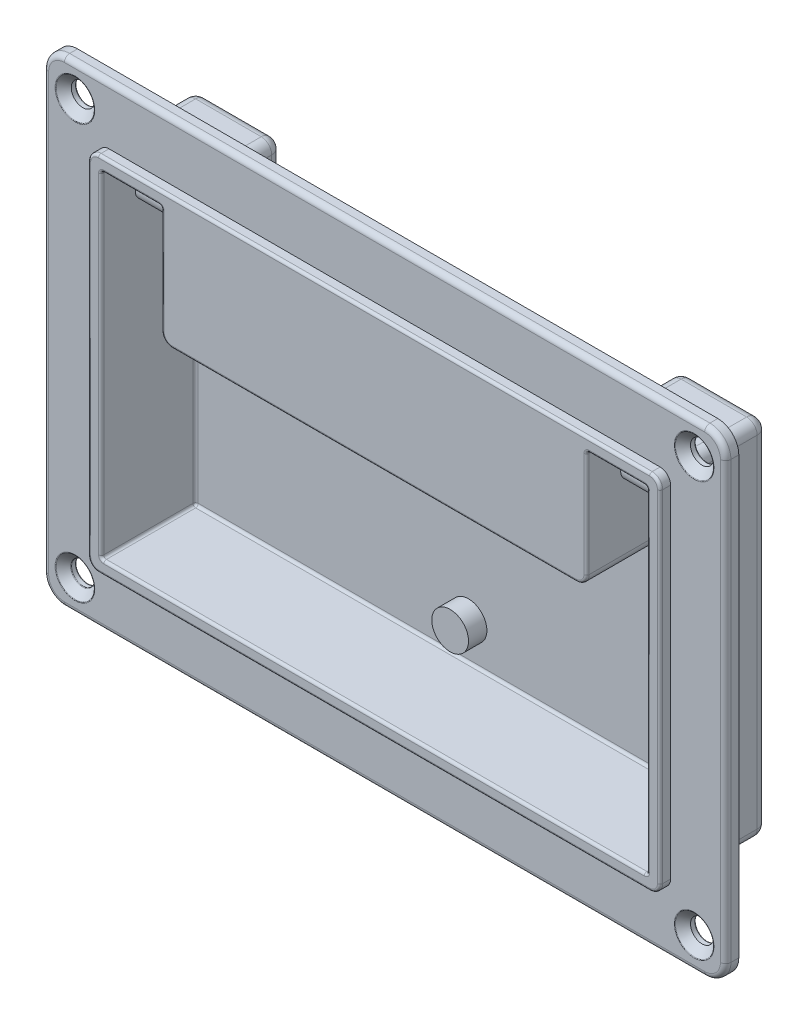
ISO-10303-21;
HEADER;
FILE_DESCRIPTION(('STEP AP214'),'2;1');
FILE_NAME('part.step','',(''),(''),'','','');
FILE_SCHEMA(('AUTOMOTIVE_DESIGN { 1 0 10303 214 1 1 1 1 }'));
ENDSEC;
DATA;
#1=APPLICATION_CONTEXT('core data for automotive mechanical design processes');
#2=APPLICATION_PROTOCOL_DEFINITION('international standard','automotive_design',2000,#1);
#3=PRODUCT_CONTEXT('',#1,'mechanical');
#4=PRODUCT('Part','Part','',(#3));
#5=PRODUCT_RELATED_PRODUCT_CATEGORY('part','',(#4));
#6=PRODUCT_DEFINITION_FORMATION('','',#4);
#7=PRODUCT_DEFINITION_CONTEXT('part definition',#1,'design');
#8=PRODUCT_DEFINITION('design','',#6,#7);
#9=PRODUCT_DEFINITION_SHAPE('','',#8);
#10=(LENGTH_UNIT() NAMED_UNIT(*) SI_UNIT(.MILLI.,.METRE.));
#11=(NAMED_UNIT(*) PLANE_ANGLE_UNIT() SI_UNIT($,.RADIAN.));
#12=(NAMED_UNIT(*) SI_UNIT($,.STERADIAN.) SOLID_ANGLE_UNIT());
#13=UNCERTAINTY_MEASURE_WITH_UNIT(LENGTH_MEASURE(1.E-05),#10,'distance_accuracy_value','');
#14=(GEOMETRIC_REPRESENTATION_CONTEXT(3) GLOBAL_UNCERTAINTY_ASSIGNED_CONTEXT((#13)) GLOBAL_UNIT_ASSIGNED_CONTEXT((#10,
#11,#12)) REPRESENTATION_CONTEXT('',''));
#15=CARTESIAN_POINT('',(0.,0.,0.));
#16=DIRECTION('',(0.,0.,1.));
#17=DIRECTION('',(1.,0.,0.));
#18=AXIS2_PLACEMENT_3D('',#15,#16,#17);
#19=CARTESIAN_POINT('',(19.5,65.,-4.));
#20=DIRECTION('',(-1.,0.,0.));
#21=DIRECTION('',(0.,-1.,0.));
#22=AXIS2_PLACEMENT_3D('',#19,#20,#21);
#23=CYLINDRICAL_SURFACE('',#22,2.);
#24=CARTESIAN_POINT('',(18.5,65.,-4.));
#25=DIRECTION('',(-1.,0.,0.));
#26=DIRECTION('',(0.,-1.,0.));
#27=AXIS2_PLACEMENT_3D('',#24,#25,#26);
#28=CIRCLE('',#27,2.);
#29=CARTESIAN_POINT('',(18.5,63.,-4.));
#30=VERTEX_POINT('',#29);
#31=EDGE_CURVE('E9',#30,#30,#28,.F.);
#32=ORIENTED_EDGE('',*,*,#31,.F.);
#33=EDGE_LOOP('',(#32));
#34=FACE_BOUND('',#33,.T.);
#35=CARTESIAN_POINT('',(7.,65.,-4.));
#36=DIRECTION('',(1.,0.,0.));
#37=DIRECTION('',(0.,0.,-1.));
#38=AXIS2_PLACEMENT_3D('',#35,#36,#37);
#39=CIRCLE('',#38,2.);
#40=CARTESIAN_POINT('',(7.,65.,-6.));
#41=VERTEX_POINT('',#40);
#42=EDGE_CURVE('E25',#41,#41,#39,.F.);
#43=ORIENTED_EDGE('',*,*,#42,.F.);
#44=EDGE_LOOP('',(#43));
#45=FACE_BOUND('',#44,.T.);
#46=ADVANCED_FACE('F14',(#34,#45),#23,.T.);
#47=CARTESIAN_POINT('',(7.,65.,-4.));
#48=DIRECTION('',(1.,0.,0.));
#49=DIRECTION('',(0.,0.,-1.));
#50=AXIS2_PLACEMENT_3D('',#47,#48,#49);
#51=PLANE('',#50);
#52=ORIENTED_EDGE('',*,*,#42,.T.);
#53=EDGE_LOOP('',(#52));
#54=FACE_BOUND('',#53,.T.);
#55=DIRECTION('',(0.,1.,0.));
#56=VECTOR('',#55,1.);
#57=CARTESIAN_POINT('',(7.,7.5,-13.));
#58=LINE('',#57,#56);
#59=CARTESIAN_POINT('',(7.,71.,-13.));
#60=VERTEX_POINT('',#59);
#61=CARTESIAN_POINT('',(7.,53.5,-13.));
#62=VERTEX_POINT('',#61);
#63=EDGE_CURVE('E942',#60,#62,#58,.F.);
#64=ORIENTED_EDGE('',*,*,#63,.F.);
#65=DIRECTION('',(0.,0.,1.));
#66=VECTOR('',#65,1.);
#67=CARTESIAN_POINT('',(7.,71.,-13.5));
#68=LINE('',#67,#66);
#69=CARTESIAN_POINT('',(7.,71.,4.));
#70=VERTEX_POINT('',#69);
#71=EDGE_CURVE('E3927',#70,#60,#68,.F.);
#72=ORIENTED_EDGE('',*,*,#71,.F.);
#73=DIRECTION('',(0.,1.,0.));
#74=VECTOR('',#73,1.);
#75=CARTESIAN_POINT('',(7.,7.5,4.));
#76=LINE('',#75,#74);
#77=CARTESIAN_POINT('',(7.,8.,4.));
#78=VERTEX_POINT('',#77);
#79=EDGE_CURVE('E3930',#78,#70,#76,.T.);
#80=ORIENTED_EDGE('',*,*,#79,.F.);
#81=DIRECTION('',(0.,0.,1.));
#82=VECTOR('',#81,1.);
#83=CARTESIAN_POINT('',(7.,8.,-13.5));
#84=LINE('',#83,#82);
#85=CARTESIAN_POINT('',(7.,8.,-13.));
#86=VERTEX_POINT('',#85);
#87=EDGE_CURVE('E3936',#86,#78,#84,.T.);
#88=ORIENTED_EDGE('',*,*,#87,.F.);
#89=DIRECTION('',(0.,1.,0.));
#90=VECTOR('',#89,1.);
#91=CARTESIAN_POINT('',(7.,7.5,-13.));
#92=LINE('',#91,#90);
#93=CARTESIAN_POINT('',(7.,51.5,-13.));
#94=VERTEX_POINT('',#93);
#95=EDGE_CURVE('E2277',#94,#86,#92,.F.);
#96=ORIENTED_EDGE('',*,*,#95,.F.);
#97=DIRECTION('',(0.,0.,1.));
#98=VECTOR('',#97,1.);
#99=CARTESIAN_POINT('',(7.,51.5,-11.5));
#100=LINE('',#99,#98);
#101=CARTESIAN_POINT('',(7.,51.5,-11.5));
#102=VERTEX_POINT('',#101);
#103=EDGE_CURVE('E951',#94,#102,#100,.T.);
#104=ORIENTED_EDGE('',*,*,#103,.T.);
#105=DIRECTION('',(0.,1.,0.));
#106=VECTOR('',#105,1.);
#107=CARTESIAN_POINT('',(7.,7.5,-11.5));
#108=LINE('',#107,#106);
#109=CARTESIAN_POINT('',(7.,53.5,-11.5));
#110=VERTEX_POINT('',#109);
#111=EDGE_CURVE('E2274',#110,#102,#108,.F.);
#112=ORIENTED_EDGE('',*,*,#111,.F.);
#113=DIRECTION('',(0.,0.,-1.));
#114=VECTOR('',#113,1.);
#115=CARTESIAN_POINT('',(7.,53.5,-11.5));
#116=LINE('',#115,#114);
#117=EDGE_CURVE('E2248',#110,#62,#116,.T.);
#118=ORIENTED_EDGE('',*,*,#117,.T.);
#119=EDGE_LOOP('',(#64,#72,#80,#88,#96,#104,#112,#118));
#120=FACE_BOUND('',#119,.T.);
#121=ADVANCED_FACE('F1718',(#54,#120),#51,.T.);
#122=CARTESIAN_POINT('',(98.5,65.,-4.));
#123=DIRECTION('',(1.,0.,0.));
#124=DIRECTION('',(0.,1.,0.));
#125=AXIS2_PLACEMENT_3D('',#122,#123,#124);
#126=CYLINDRICAL_SURFACE('',#125,2.);
#127=CARTESIAN_POINT('',(99.5,65.,-4.));
#128=DIRECTION('',(1.,0.,0.));
#129=DIRECTION('',(0.,0.,-1.));
#130=AXIS2_PLACEMENT_3D('',#127,#128,#129);
#131=CIRCLE('',#130,2.);
#132=CARTESIAN_POINT('',(99.5,65.,-6.));
#133=VERTEX_POINT('',#132);
#134=EDGE_CURVE('E1731',#133,#133,#131,.F.);
#135=ORIENTED_EDGE('',*,*,#134,.F.);
#136=EDGE_LOOP('',(#135));
#137=FACE_BOUND('',#136,.T.);
#138=CARTESIAN_POINT('',(111.,65.,-4.));
#139=DIRECTION('',(-1.,0.,0.));
#140=DIRECTION('',(0.,-1.,0.));
#141=AXIS2_PLACEMENT_3D('',#138,#139,#140);
#142=CIRCLE('',#141,2.);
#143=CARTESIAN_POINT('',(111.,63.,-4.));
#144=VERTEX_POINT('',#143);
#145=EDGE_CURVE('E1734',#144,#144,#142,.F.);
#146=ORIENTED_EDGE('',*,*,#145,.F.);
#147=EDGE_LOOP('',(#146));
#148=FACE_BOUND('',#147,.T.);
#149=ADVANCED_FACE('F1724',(#137,#148),#126,.T.);
#150=CARTESIAN_POINT('',(111.,65.,-4.));
#151=DIRECTION('',(-1.,0.,0.));
#152=DIRECTION('',(0.,-1.,0.));
#153=AXIS2_PLACEMENT_3D('',#150,#151,#152);
#154=PLANE('',#153);
#155=ORIENTED_EDGE('',*,*,#145,.T.);
#156=EDGE_LOOP('',(#155));
#157=FACE_BOUND('',#156,.T.);
#158=DIRECTION('',(0.,1.,0.));
#159=VECTOR('',#158,1.);
#160=CARTESIAN_POINT('',(111.,7.5,-13.));
#161=LINE('',#160,#159);
#162=CARTESIAN_POINT('',(111.,53.5,-13.));
#163=VERTEX_POINT('',#162);
#164=CARTESIAN_POINT('',(111.,71.,-13.));
#165=VERTEX_POINT('',#164);
#166=EDGE_CURVE('E1156',#163,#165,#161,.T.);
#167=ORIENTED_EDGE('',*,*,#166,.F.);
#168=DIRECTION('',(0.,0.,-1.));
#169=VECTOR('',#168,1.);
#170=CARTESIAN_POINT('',(111.,53.5,-11.5));
#171=LINE('',#170,#169);
#172=CARTESIAN_POINT('',(111.,53.5,-11.5));
#173=VERTEX_POINT('',#172);
#174=EDGE_CURVE('E4160',#163,#173,#171,.F.);
#175=ORIENTED_EDGE('',*,*,#174,.T.);
#176=DIRECTION('',(0.,1.,0.));
#177=VECTOR('',#176,1.);
#178=CARTESIAN_POINT('',(111.,7.5,-11.5));
#179=LINE('',#178,#177);
#180=CARTESIAN_POINT('',(111.,51.5,-11.5));
#181=VERTEX_POINT('',#180);
#182=EDGE_CURVE('E1140',#181,#173,#179,.T.);
#183=ORIENTED_EDGE('',*,*,#182,.F.);
#184=DIRECTION('',(0.,0.,1.));
#185=VECTOR('',#184,1.);
#186=CARTESIAN_POINT('',(111.,51.5,-11.5));
#187=LINE('',#186,#185);
#188=CARTESIAN_POINT('',(111.,51.5,-13.));
#189=VERTEX_POINT('',#188);
#190=EDGE_CURVE('E2233',#181,#189,#187,.F.);
#191=ORIENTED_EDGE('',*,*,#190,.T.);
#192=DIRECTION('',(0.,1.,0.));
#193=VECTOR('',#192,1.);
#194=CARTESIAN_POINT('',(111.,7.5,-13.));
#195=LINE('',#194,#193);
#196=CARTESIAN_POINT('',(111.,8.,-13.));
#197=VERTEX_POINT('',#196);
#198=EDGE_CURVE('E1130',#197,#189,#195,.T.);
#199=ORIENTED_EDGE('',*,*,#198,.F.);
#200=DIRECTION('',(0.,0.,1.));
#201=VECTOR('',#200,1.);
#202=CARTESIAN_POINT('',(111.,8.,-13.5));
#203=LINE('',#202,#201);
#204=CARTESIAN_POINT('',(111.,8.,4.));
#205=VERTEX_POINT('',#204);
#206=EDGE_CURVE('E1119',#205,#197,#203,.F.);
#207=ORIENTED_EDGE('',*,*,#206,.F.);
#208=DIRECTION('',(0.,1.,0.));
#209=VECTOR('',#208,1.);
#210=CARTESIAN_POINT('',(111.,7.5,4.));
#211=LINE('',#210,#209);
#212=CARTESIAN_POINT('',(111.,71.,4.));
#213=VERTEX_POINT('',#212);
#214=EDGE_CURVE('E1090',#213,#205,#211,.F.);
#215=ORIENTED_EDGE('',*,*,#214,.F.);
#216=DIRECTION('',(0.,0.,1.));
#217=VECTOR('',#216,1.);
#218=CARTESIAN_POINT('',(111.,71.,-13.5));
#219=LINE('',#218,#217);
#220=EDGE_CURVE('E1153',#165,#213,#219,.T.);
#221=ORIENTED_EDGE('',*,*,#220,.F.);
#222=EDGE_LOOP('',(#167,#175,#183,#191,#199,#207,#215,#221));
#223=FACE_BOUND('',#222,.T.);
#224=ADVANCED_FACE('F693',(#157,#223),#154,.T.);
#225=CARTESIAN_POINT('',(59.,14.5,-10.));
#226=DIRECTION('',(0.,0.,1.));
#227=DIRECTION('',(1.,0.,0.));
#228=AXIS2_PLACEMENT_3D('',#225,#226,#227);
#229=PLANE('',#228);
#230=CARTESIAN_POINT('',(59.,14.5,-10.));
#231=DIRECTION('',(0.,0.,1.));
#232=DIRECTION('',(1.,0.,0.));
#233=AXIS2_PLACEMENT_3D('',#230,#231,#232);
#234=CIRCLE('',#233,3.5);
#235=CARTESIAN_POINT('',(62.5,14.5,-10.));
#236=VERTEX_POINT('',#235);
#237=EDGE_CURVE('E2215',#236,#236,#234,.F.);
#238=ORIENTED_EDGE('',*,*,#237,.F.);
#239=EDGE_LOOP('',(#238));
#240=FACE_BOUND('',#239,.T.);
#241=ADVANCED_FACE('F3664',(#240),#229,.T.);
#242=CARTESIAN_POINT('',(18.5,54.,-13.));
#243=DIRECTION('',(1.,0.,0.));
#244=DIRECTION('',(0.,0.,-1.));
#245=AXIS2_PLACEMENT_3D('',#242,#243,#244);
#246=CYLINDRICAL_SURFACE('',#245,0.5);
#247=DIRECTION('',(1.,0.,0.));
#248=VECTOR('',#247,1.);
#249=CARTESIAN_POINT('',(18.5,53.5,-13.));
#250=LINE('',#249,#248);
#251=CARTESIAN_POINT('',(18.5,53.5,-13.));
#252=VERTEX_POINT('',#251);
#253=EDGE_CURVE('E2252',#62,#252,#250,.T.);
#254=ORIENTED_EDGE('',*,*,#253,.T.);
#255=CARTESIAN_POINT('',(18.,54.,-13.));
#256=DIRECTION('',(0.707106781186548,0.707106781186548,0.));
#257=DIRECTION('',(0.707106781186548,-0.707106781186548,0.));
#258=AXIS2_PLACEMENT_3D('',#255,#256,#257);
#259=ELLIPSE('',#258,0.707106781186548,0.5);
#260=CARTESIAN_POINT('',(18.,54.,-13.5));
#261=VERTEX_POINT('',#260);
#262=EDGE_CURVE('E933',#261,#252,#259,.F.);
#263=ORIENTED_EDGE('',*,*,#262,.F.);
#264=DIRECTION('',(-1.,0.,0.));
#265=VECTOR('',#264,1.);
#266=CARTESIAN_POINT('',(59.,54.,-13.5));
#267=LINE('',#266,#265);
#268=CARTESIAN_POINT('',(7.5,54.,-13.5));
#269=VERTEX_POINT('',#268);
#270=EDGE_CURVE('E946',#261,#269,#267,.T.);
#271=ORIENTED_EDGE('',*,*,#270,.T.);
#272=CARTESIAN_POINT('',(7.5,54.,-13.));
#273=DIRECTION('',(0.707106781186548,-0.707106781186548,0.));
#274=DIRECTION('',(0.707106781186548,0.707106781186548,0.));
#275=AXIS2_PLACEMENT_3D('',#272,#273,#274);
#276=ELLIPSE('',#275,0.707106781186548,0.5);
#277=EDGE_CURVE('E34',#62,#269,#276,.T.);
#278=ORIENTED_EDGE('',*,*,#277,.F.);
#279=EDGE_LOOP('',(#254,#263,#271,#278));
#280=FACE_BOUND('',#279,.T.);
#281=ADVANCED_FACE('F947',(#280),#246,.F.);
#282=CARTESIAN_POINT('',(59.,71.,-13.));
#283=DIRECTION('',(1.,0.,0.));
#284=DIRECTION('',(0.,0.,-1.));
#285=AXIS2_PLACEMENT_3D('',#282,#283,#284);
#286=CYLINDRICAL_SURFACE('',#285,0.5);
#287=DIRECTION('',(-1.,0.,0.));
#288=VECTOR('',#287,1.);
#289=CARTESIAN_POINT('',(59.,71.,-13.5));
#290=LINE('',#289,#288);
#291=CARTESIAN_POINT('',(7.5,71.,-13.5));
#292=VERTEX_POINT('',#291);
#293=CARTESIAN_POINT('',(18.,71.,-13.5));
#294=VERTEX_POINT('',#293);
#295=EDGE_CURVE('E952',#292,#294,#290,.F.);
#296=ORIENTED_EDGE('',*,*,#295,.T.);
#297=CARTESIAN_POINT('',(18.,71.,-13.));
#298=DIRECTION('',(1.,0.,0.));
#299=DIRECTION('',(0.,0.,-1.));
#300=AXIS2_PLACEMENT_3D('',#297,#298,#299);
#301=CIRCLE('',#300,0.5);
#302=CARTESIAN_POINT('',(18.,71.5,-13.));
#303=VERTEX_POINT('',#302);
#304=EDGE_CURVE('E944',#303,#294,#301,.F.);
#305=ORIENTED_EDGE('',*,*,#304,.F.);
#306=DIRECTION('',(1.,0.,0.));
#307=VECTOR('',#306,1.);
#308=CARTESIAN_POINT('',(7.,71.5,-13.));
#309=LINE('',#308,#307);
#310=CARTESIAN_POINT('',(7.5,71.5,-13.));
#311=VERTEX_POINT('',#310);
#312=EDGE_CURVE('E3890',#303,#311,#309,.F.);
#313=ORIENTED_EDGE('',*,*,#312,.T.);
#314=CARTESIAN_POINT('',(7.5,71.,-13.));
#315=DIRECTION('',(1.,0.,0.));
#316=DIRECTION('',(0.,1.,0.));
#317=AXIS2_PLACEMENT_3D('',#314,#315,#316);
#318=CIRCLE('',#317,0.5);
#319=EDGE_CURVE('E2251',#311,#292,#318,.F.);
#320=ORIENTED_EDGE('',*,*,#319,.T.);
#321=EDGE_LOOP('',(#296,#305,#313,#320));
#322=FACE_BOUND('',#321,.T.);
#323=ADVANCED_FACE('F3715',(#322),#286,.F.);
#324=CARTESIAN_POINT('',(59.,49.5,4.));
#325=DIRECTION('',(1.,0.,0.));
#326=DIRECTION('',(0.,0.,-1.));
#327=AXIS2_PLACEMENT_3D('',#324,#325,#326);
#328=CYLINDRICAL_SURFACE('',#327,0.5);
#329=CARTESIAN_POINT('',(20.5,49.5,4.));
#330=DIRECTION('',(-1.,0.,0.));
#331=DIRECTION('',(0.,-1.,0.));
#332=AXIS2_PLACEMENT_3D('',#329,#330,#331);
#333=CIRCLE('',#332,0.5);
#334=CARTESIAN_POINT('',(20.5,49.,4.));
#335=VERTEX_POINT('',#334);
#336=CARTESIAN_POINT('',(20.5,49.5,4.5));
#337=VERTEX_POINT('',#336);
#338=EDGE_CURVE('E2823',#335,#337,#333,.T.);
#339=ORIENTED_EDGE('',*,*,#338,.F.);
#340=DIRECTION('',(1.,0.,0.));
#341=VECTOR('',#340,1.);
#342=CARTESIAN_POINT('',(7.,49.,4.));
#343=LINE('',#342,#341);
#344=CARTESIAN_POINT('',(97.5,49.,4.));
#345=VERTEX_POINT('',#344);
#346=EDGE_CURVE('E2664',#335,#345,#343,.T.);
#347=ORIENTED_EDGE('',*,*,#346,.T.);
#348=CARTESIAN_POINT('',(97.5,49.5,4.));
#349=DIRECTION('',(-1.,0.,0.));
#350=DIRECTION('',(0.,-1.,0.));
#351=AXIS2_PLACEMENT_3D('',#348,#349,#350);
#352=CIRCLE('',#351,0.5);
#353=CARTESIAN_POINT('',(97.5,49.5,4.5));
#354=VERTEX_POINT('',#353);
#355=EDGE_CURVE('E2644',#354,#345,#352,.F.);
#356=ORIENTED_EDGE('',*,*,#355,.F.);
#357=DIRECTION('',(-1.,0.,0.));
#358=VECTOR('',#357,1.);
#359=CARTESIAN_POINT('',(59.,49.5,4.5));
#360=LINE('',#359,#358);
#361=EDGE_CURVE('E2338',#354,#337,#360,.T.);
#362=ORIENTED_EDGE('',*,*,#361,.T.);
#363=EDGE_LOOP('',(#339,#347,#356,#362));
#364=FACE_BOUND('',#363,.T.);
#365=ADVANCED_FACE('F3695',(#364),#328,.T.);
#366=CARTESIAN_POINT('',(59.,72.,4.));
#367=DIRECTION('',(1.,0.,0.));
#368=DIRECTION('',(0.,0.,-1.));
#369=AXIS2_PLACEMENT_3D('',#366,#367,#368);
#370=CYLINDRICAL_SURFACE('',#369,0.5);
#371=CARTESIAN_POINT('',(18.,72.,4.));
#372=DIRECTION('',(1.,0.,0.));
#373=DIRECTION('',(0.,1.,0.));
#374=AXIS2_PLACEMENT_3D('',#371,#372,#373);
#375=CIRCLE('',#374,0.5);
#376=CARTESIAN_POINT('',(18.,72.,4.5));
#377=VERTEX_POINT('',#376);
#378=CARTESIAN_POINT('',(18.,71.5,4.));
#379=VERTEX_POINT('',#378);
#380=EDGE_CURVE('E3902',#377,#379,#375,.T.);
#381=ORIENTED_EDGE('',*,*,#380,.F.);
#382=DIRECTION('',(-1.,0.,0.));
#383=VECTOR('',#382,1.);
#384=CARTESIAN_POINT('',(59.,72.,4.5));
#385=LINE('',#384,#383);
#386=CARTESIAN_POINT('',(7.5,72.,4.5));
#387=VERTEX_POINT('',#386);
#388=EDGE_CURVE('E2345',#377,#387,#385,.T.);
#389=ORIENTED_EDGE('',*,*,#388,.T.);
#390=CARTESIAN_POINT('',(7.5,72.,4.));
#391=DIRECTION('',(1.,0.,0.));
#392=DIRECTION('',(0.,1.,0.));
#393=AXIS2_PLACEMENT_3D('',#390,#391,#392);
#394=CIRCLE('',#393,0.5);
#395=CARTESIAN_POINT('',(7.5,71.5,4.));
#396=VERTEX_POINT('',#395);
#397=EDGE_CURVE('E2756',#396,#387,#394,.F.);
#398=ORIENTED_EDGE('',*,*,#397,.F.);
#399=DIRECTION('',(1.,0.,0.));
#400=VECTOR('',#399,1.);
#401=CARTESIAN_POINT('',(7.,71.5,4.));
#402=LINE('',#401,#400);
#403=EDGE_CURVE('E3901',#396,#379,#402,.T.);
#404=ORIENTED_EDGE('',*,*,#403,.T.);
#405=EDGE_LOOP('',(#381,#389,#398,#404));
#406=FACE_BOUND('',#405,.T.);
#407=ADVANCED_FACE('F3690',(#406),#370,.T.);
#408=CARTESIAN_POINT('',(59.,7.,4.));
#409=DIRECTION('',(-1.,0.,0.));
#410=DIRECTION('',(0.,-1.,0.));
#411=AXIS2_PLACEMENT_3D('',#408,#409,#410);
#412=CYLINDRICAL_SURFACE('',#411,0.5);
#413=CARTESIAN_POINT('',(7.5,7.,4.));
#414=DIRECTION('',(-1.,0.,0.));
#415=DIRECTION('',(0.,-1.,0.));
#416=AXIS2_PLACEMENT_3D('',#413,#414,#415);
#417=CIRCLE('',#416,0.5);
#418=CARTESIAN_POINT('',(7.5,7.,4.5));
#419=VERTEX_POINT('',#418);
#420=CARTESIAN_POINT('',(7.5,7.5,4.));
#421=VERTEX_POINT('',#420);
#422=EDGE_CURVE('E2697',#419,#421,#417,.T.);
#423=ORIENTED_EDGE('',*,*,#422,.F.);
#424=DIRECTION('',(-1.,0.,0.));
#425=VECTOR('',#424,1.);
#426=CARTESIAN_POINT('',(59.,7.,4.5));
#427=LINE('',#426,#425);
#428=CARTESIAN_POINT('',(110.5,7.,4.5));
#429=VERTEX_POINT('',#428);
#430=EDGE_CURVE('E2295',#419,#429,#427,.F.);
#431=ORIENTED_EDGE('',*,*,#430,.T.);
#432=CARTESIAN_POINT('',(110.5,7.,4.));
#433=DIRECTION('',(-1.,0.,0.));
#434=DIRECTION('',(0.,-1.,0.));
#435=AXIS2_PLACEMENT_3D('',#432,#433,#434);
#436=CIRCLE('',#435,0.5);
#437=CARTESIAN_POINT('',(110.5,7.5,4.));
#438=VERTEX_POINT('',#437);
#439=EDGE_CURVE('E2292',#438,#429,#436,.F.);
#440=ORIENTED_EDGE('',*,*,#439,.F.);
#441=DIRECTION('',(1.,0.,0.));
#442=VECTOR('',#441,1.);
#443=CARTESIAN_POINT('',(59.,7.5,4.));
#444=LINE('',#443,#442);
#445=EDGE_CURVE('E2505',#438,#421,#444,.F.);
#446=ORIENTED_EDGE('',*,*,#445,.T.);
#447=EDGE_LOOP('',(#423,#431,#440,#446));
#448=FACE_BOUND('',#447,.T.);
#449=ADVANCED_FACE('F2696',(#448),#412,.T.);
#450=CARTESIAN_POINT('',(59.,8.,-13.));
#451=DIRECTION('',(-1.,0.,0.));
#452=DIRECTION('',(0.,-1.,0.));
#453=AXIS2_PLACEMENT_3D('',#450,#451,#452);
#454=CYLINDRICAL_SURFACE('',#453,0.5);
#455=DIRECTION('',(-1.,0.,0.));
#456=VECTOR('',#455,1.);
#457=CARTESIAN_POINT('',(59.,8.,-13.5));
#458=LINE('',#457,#456);
#459=CARTESIAN_POINT('',(110.5,8.,-13.5));
#460=VERTEX_POINT('',#459);
#461=CARTESIAN_POINT('',(7.5,8.00000000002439,-13.5));
#462=VERTEX_POINT('',#461);
#463=EDGE_CURVE('E2572',#460,#462,#458,.T.);
#464=ORIENTED_EDGE('',*,*,#463,.T.);
#465=CARTESIAN_POINT('',(7.5,8.,-13.));
#466=DIRECTION('',(1.,0.,0.));
#467=DIRECTION('',(0.,1.,0.));
#468=AXIS2_PLACEMENT_3D('',#465,#466,#467);
#469=CIRCLE('',#468,0.5);
#470=CARTESIAN_POINT('',(7.5,7.5,-13.));
#471=VERTEX_POINT('',#470);
#472=EDGE_CURVE('E2721',#462,#471,#469,.F.);
#473=ORIENTED_EDGE('',*,*,#472,.T.);
#474=DIRECTION('',(1.,0.,0.));
#475=VECTOR('',#474,1.);
#476=CARTESIAN_POINT('',(59.,7.5,-13.));
#477=LINE('',#476,#475);
#478=CARTESIAN_POINT('',(110.5,7.5,-13.0000000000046));
#479=VERTEX_POINT('',#478);
#480=EDGE_CURVE('E2508',#471,#479,#477,.T.);
#481=ORIENTED_EDGE('',*,*,#480,.T.);
#482=CARTESIAN_POINT('',(110.5,8.,-13.));
#483=DIRECTION('',(1.,0.,0.));
#484=DIRECTION('',(0.,1.,0.));
#485=AXIS2_PLACEMENT_3D('',#482,#483,#484);
#486=CIRCLE('',#485,0.5);
#487=EDGE_CURVE('E2513',#479,#460,#486,.T.);
#488=ORIENTED_EDGE('',*,*,#487,.T.);
#489=EDGE_LOOP('',(#464,#473,#481,#488));
#490=FACE_BOUND('',#489,.T.);
#491=ADVANCED_FACE('F3706',(#490),#454,.F.);
#492=CARTESIAN_POINT('',(18.5,51.,-13.));
#493=DIRECTION('',(-1.,0.,0.));
#494=DIRECTION('',(0.,0.,1.));
#495=AXIS2_PLACEMENT_3D('',#492,#493,#494);
#496=CYLINDRICAL_SURFACE('',#495,0.5);
#497=DIRECTION('',(1.,0.,0.));
#498=VECTOR('',#497,1.);
#499=CARTESIAN_POINT('',(18.5,51.5,-13.));
#500=LINE('',#499,#498);
#501=CARTESIAN_POINT('',(18.5,51.5,-13.));
#502=VERTEX_POINT('',#501);
#503=EDGE_CURVE('E2271',#502,#94,#500,.F.);
#504=ORIENTED_EDGE('',*,*,#503,.T.);
#505=CARTESIAN_POINT('',(7.5,51.,-13.));
#506=DIRECTION('',(0.707106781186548,0.707106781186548,0.));
#507=DIRECTION('',(-0.707106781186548,0.707106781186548,0.));
#508=AXIS2_PLACEMENT_3D('',#505,#506,#507);
#509=ELLIPSE('',#508,0.707106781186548,0.5);
#510=CARTESIAN_POINT('',(7.5,51.,-13.5));
#511=VERTEX_POINT('',#510);
#512=EDGE_CURVE('E2208',#511,#94,#509,.T.);
#513=ORIENTED_EDGE('',*,*,#512,.F.);
#514=DIRECTION('',(-1.,0.,0.));
#515=VECTOR('',#514,1.);
#516=CARTESIAN_POINT('',(59.,51.,-13.5));
#517=LINE('',#516,#515);
#518=CARTESIAN_POINT('',(18.,51.,-13.5));
#519=VERTEX_POINT('',#518);
#520=EDGE_CURVE('E2564',#511,#519,#517,.F.);
#521=ORIENTED_EDGE('',*,*,#520,.T.);
#522=CARTESIAN_POINT('',(18.,51.,-13.));
#523=DIRECTION('',(-0.707106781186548,0.707106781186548,0.));
#524=DIRECTION('',(-0.707106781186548,-0.707106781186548,0.));
#525=AXIS2_PLACEMENT_3D('',#522,#523,#524);
#526=ELLIPSE('',#525,0.707106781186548,0.5);
#527=EDGE_CURVE('E2210',#502,#519,#526,.T.);
#528=ORIENTED_EDGE('',*,*,#527,.F.);
#529=EDGE_LOOP('',(#504,#513,#521,#528));
#530=FACE_BOUND('',#529,.T.);
#531=ADVANCED_FACE('F2571',(#530),#496,.F.);
#532=CARTESIAN_POINT('',(59.,48.5,-13.));
#533=DIRECTION('',(1.,0.,0.));
#534=DIRECTION('',(0.,0.,-1.));
#535=AXIS2_PLACEMENT_3D('',#532,#533,#534);
#536=CYLINDRICAL_SURFACE('',#535,0.5);
#537=DIRECTION('',(1.,0.,0.));
#538=VECTOR('',#537,1.);
#539=CARTESIAN_POINT('',(7.,49.,-13.));
#540=LINE('',#539,#538);
#541=CARTESIAN_POINT('',(97.5,49.,-13.));
#542=VERTEX_POINT('',#541);
#543=CARTESIAN_POINT('',(20.5,49.,-13.));
#544=VERTEX_POINT('',#543);
#545=EDGE_CURVE('E2667',#542,#544,#540,.F.);
#546=ORIENTED_EDGE('',*,*,#545,.T.);
#547=CARTESIAN_POINT('',(20.5,48.5,-13.));
#548=DIRECTION('',(-1.,0.,0.));
#549=DIRECTION('',(0.,-1.,0.));
#550=AXIS2_PLACEMENT_3D('',#547,#548,#549);
#551=CIRCLE('',#550,0.5);
#552=CARTESIAN_POINT('',(20.5,48.5,-13.5));
#553=VERTEX_POINT('',#552);
#554=EDGE_CURVE('E2832',#544,#553,#551,.T.);
#555=ORIENTED_EDGE('',*,*,#554,.T.);
#556=DIRECTION('',(-1.,0.,0.));
#557=VECTOR('',#556,1.);
#558=CARTESIAN_POINT('',(59.,48.5,-13.5));
#559=LINE('',#558,#557);
#560=CARTESIAN_POINT('',(97.5,48.5,-13.5));
#561=VERTEX_POINT('',#560);
#562=EDGE_CURVE('E2232',#553,#561,#559,.F.);
#563=ORIENTED_EDGE('',*,*,#562,.T.);
#564=CARTESIAN_POINT('',(97.5,48.5,-13.));
#565=DIRECTION('',(-1.,0.,0.));
#566=DIRECTION('',(0.,-1.,0.));
#567=AXIS2_PLACEMENT_3D('',#564,#565,#566);
#568=CIRCLE('',#567,0.5);
#569=EDGE_CURVE('E2592',#561,#542,#568,.F.);
#570=ORIENTED_EDGE('',*,*,#569,.T.);
#571=EDGE_LOOP('',(#546,#555,#563,#570));
#572=FACE_BOUND('',#571,.T.);
#573=ADVANCED_FACE('F3734',(#572),#536,.F.);
#574=CARTESIAN_POINT('',(59.,14.5,-13.5));
#575=DIRECTION('',(0.,0.,1.));
#576=DIRECTION('',(1.,0.,0.));
#577=AXIS2_PLACEMENT_3D('',#574,#575,#576);
#578=CYLINDRICAL_SURFACE('',#577,3.5);
#579=ORIENTED_EDGE('',*,*,#237,.T.);
#580=EDGE_LOOP('',(#579));
#581=FACE_BOUND('',#580,.T.);
#582=CARTESIAN_POINT('',(59.,14.5,-13.5));
#583=DIRECTION('',(0.,0.,1.));
#584=DIRECTION('',(1.,0.,0.));
#585=AXIS2_PLACEMENT_3D('',#582,#583,#584);
#586=CIRCLE('',#585,3.5);
#587=CARTESIAN_POINT('',(62.5,14.5,-13.5));
#588=VERTEX_POINT('',#587);
#589=EDGE_CURVE('E2229',#588,#588,#586,.T.);
#590=ORIENTED_EDGE('',*,*,#589,.T.);
#591=EDGE_LOOP('',(#590));
#592=FACE_BOUND('',#591,.T.);
#593=ADVANCED_FACE('F3743',(#581,#592),#578,.T.);
#594=CARTESIAN_POINT('',(59.,51.,-13.));
#595=DIRECTION('',(1.,0.,0.));
#596=DIRECTION('',(0.,0.,-1.));
#597=AXIS2_PLACEMENT_3D('',#594,#595,#596);
#598=CYLINDRICAL_SURFACE('',#597,0.5);
#599=DIRECTION('',(-1.,0.,0.));
#600=VECTOR('',#599,1.);
#601=CARTESIAN_POINT('',(59.,51.,-13.5));
#602=LINE('',#601,#600);
#603=CARTESIAN_POINT('',(100.,51.,-13.5));
#604=VERTEX_POINT('',#603);
#605=CARTESIAN_POINT('',(110.5,51.,-13.5));
#606=VERTEX_POINT('',#605);
#607=EDGE_CURVE('E2575',#604,#606,#602,.F.);
#608=ORIENTED_EDGE('',*,*,#607,.T.);
#609=CARTESIAN_POINT('',(110.5,51.,-13.));
#610=DIRECTION('',(0.707106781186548,-0.707106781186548,0.));
#611=DIRECTION('',(0.707106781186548,0.707106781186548,0.));
#612=AXIS2_PLACEMENT_3D('',#609,#610,#611);
#613=ELLIPSE('',#612,0.707106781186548,0.5);
#614=EDGE_CURVE('E2218',#189,#606,#613,.F.);
#615=ORIENTED_EDGE('',*,*,#614,.F.);
#616=DIRECTION('',(1.,0.,0.));
#617=VECTOR('',#616,1.);
#618=CARTESIAN_POINT('',(99.5,51.5,-13.));
#619=LINE('',#618,#617);
#620=CARTESIAN_POINT('',(99.5,51.5,-13.));
#621=VERTEX_POINT('',#620);
#622=EDGE_CURVE('E4200',#189,#621,#619,.F.);
#623=ORIENTED_EDGE('',*,*,#622,.T.);
#624=CARTESIAN_POINT('',(100.,51.,-13.));
#625=DIRECTION('',(-0.707106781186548,-0.707106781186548,0.));
#626=DIRECTION('',(0.707106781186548,-0.707106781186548,0.));
#627=AXIS2_PLACEMENT_3D('',#624,#625,#626);
#628=ELLIPSE('',#627,0.707106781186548,0.5);
#629=EDGE_CURVE('E2220',#604,#621,#628,.F.);
#630=ORIENTED_EDGE('',*,*,#629,.F.);
#631=EDGE_LOOP('',(#608,#615,#623,#630));
#632=FACE_BOUND('',#631,.T.);
#633=ADVANCED_FACE('F3752',(#632),#598,.F.);
#634=CARTESIAN_POINT('',(59.,54.,-13.));
#635=DIRECTION('',(-1.,0.,0.));
#636=DIRECTION('',(0.,0.,1.));
#637=AXIS2_PLACEMENT_3D('',#634,#635,#636);
#638=CYLINDRICAL_SURFACE('',#637,0.5);
#639=DIRECTION('',(-1.,0.,0.));
#640=VECTOR('',#639,1.);
#641=CARTESIAN_POINT('',(59.,54.,-13.5));
#642=LINE('',#641,#640);
#643=CARTESIAN_POINT('',(110.5,54.,-13.5));
#644=VERTEX_POINT('',#643);
#645=CARTESIAN_POINT('',(100.,54.,-13.5));
#646=VERTEX_POINT('',#645);
#647=EDGE_CURVE('E4165',#644,#646,#642,.T.);
#648=ORIENTED_EDGE('',*,*,#647,.T.);
#649=CARTESIAN_POINT('',(100.,54.,-13.));
#650=DIRECTION('',(-0.707106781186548,0.707106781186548,0.));
#651=DIRECTION('',(-0.707106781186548,-0.707106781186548,0.));
#652=AXIS2_PLACEMENT_3D('',#649,#650,#651);
#653=ELLIPSE('',#652,0.707106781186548,0.5);
#654=CARTESIAN_POINT('',(99.5,53.5,-13.));
#655=VERTEX_POINT('',#654);
#656=EDGE_CURVE('E2224',#655,#646,#653,.F.);
#657=ORIENTED_EDGE('',*,*,#656,.F.);
#658=DIRECTION('',(1.,0.,0.));
#659=VECTOR('',#658,1.);
#660=CARTESIAN_POINT('',(99.5,53.5,-13.));
#661=LINE('',#660,#659);
#662=EDGE_CURVE('E4161',#655,#163,#661,.T.);
#663=ORIENTED_EDGE('',*,*,#662,.T.);
#664=CARTESIAN_POINT('',(110.5,54.,-13.));
#665=DIRECTION('',(-0.707106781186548,-0.707106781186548,0.));
#666=DIRECTION('',(-0.707106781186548,0.707106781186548,0.));
#667=AXIS2_PLACEMENT_3D('',#664,#665,#666);
#668=ELLIPSE('',#667,0.707106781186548,0.5);
#669=EDGE_CURVE('E2226',#644,#163,#668,.T.);
#670=ORIENTED_EDGE('',*,*,#669,.F.);
#671=EDGE_LOOP('',(#648,#657,#663,#670));
#672=FACE_BOUND('',#671,.T.);
#673=ADVANCED_FACE('F3762',(#672),#638,.F.);
#674=CARTESIAN_POINT('',(111.,71.,-13.));
#675=DIRECTION('',(-1.,0.,0.));
#676=DIRECTION('',(0.,0.,1.));
#677=AXIS2_PLACEMENT_3D('',#674,#675,#676);
#678=CYLINDRICAL_SURFACE('',#677,0.5);
#679=DIRECTION('',(1.,0.,0.));
#680=VECTOR('',#679,1.);
#681=CARTESIAN_POINT('',(111.,71.5,-13.));
#682=LINE('',#681,#680);
#683=CARTESIAN_POINT('',(110.5,71.5,-13.));
#684=VERTEX_POINT('',#683);
#685=CARTESIAN_POINT('',(100.,71.5,-13.));
#686=VERTEX_POINT('',#685);
#687=EDGE_CURVE('E4137',#684,#686,#682,.F.);
#688=ORIENTED_EDGE('',*,*,#687,.T.);
#689=CARTESIAN_POINT('',(100.,71.,-13.));
#690=DIRECTION('',(1.,0.,0.));
#691=DIRECTION('',(0.,1.,0.));
#692=AXIS2_PLACEMENT_3D('',#689,#690,#691);
#693=CIRCLE('',#692,0.5);
#694=CARTESIAN_POINT('',(100.,71.,-13.5));
#695=VERTEX_POINT('',#694);
#696=EDGE_CURVE('E2630',#686,#695,#693,.F.);
#697=ORIENTED_EDGE('',*,*,#696,.T.);
#698=DIRECTION('',(-1.,0.,0.));
#699=VECTOR('',#698,1.);
#700=CARTESIAN_POINT('',(59.,71.,-13.5));
#701=LINE('',#700,#699);
#702=CARTESIAN_POINT('',(110.5,71.,-13.5));
#703=VERTEX_POINT('',#702);
#704=EDGE_CURVE('E4169',#695,#703,#701,.F.);
#705=ORIENTED_EDGE('',*,*,#704,.T.);
#706=CARTESIAN_POINT('',(110.5,71.,-13.));
#707=DIRECTION('',(-1.,0.,0.));
#708=DIRECTION('',(0.,0.,1.));
#709=AXIS2_PLACEMENT_3D('',#706,#707,#708);
#710=CIRCLE('',#709,0.5);
#711=EDGE_CURVE('E2228',#684,#703,#710,.T.);
#712=ORIENTED_EDGE('',*,*,#711,.F.);
#713=EDGE_LOOP('',(#688,#697,#705,#712));
#714=FACE_BOUND('',#713,.T.);
#715=ADVANCED_FACE('F3771',(#714),#678,.F.);
#716=CARTESIAN_POINT('',(111.,72.,4.));
#717=DIRECTION('',(-1.,0.,0.));
#718=DIRECTION('',(0.,0.,1.));
#719=AXIS2_PLACEMENT_3D('',#716,#717,#718);
#720=CYLINDRICAL_SURFACE('',#719,0.5);
#721=CARTESIAN_POINT('',(100.,72.,4.));
#722=DIRECTION('',(1.,0.,0.));
#723=DIRECTION('',(0.,1.,0.));
#724=AXIS2_PLACEMENT_3D('',#721,#722,#723);
#725=CIRCLE('',#724,0.5);
#726=CARTESIAN_POINT('',(100.,71.5,4.));
#727=VERTEX_POINT('',#726);
#728=CARTESIAN_POINT('',(100.,72.,4.5));
#729=VERTEX_POINT('',#728);
#730=EDGE_CURVE('E2629',#727,#729,#725,.F.);
#731=ORIENTED_EDGE('',*,*,#730,.F.);
#732=DIRECTION('',(1.,0.,0.));
#733=VECTOR('',#732,1.);
#734=CARTESIAN_POINT('',(111.,71.5,4.));
#735=LINE('',#734,#733);
#736=CARTESIAN_POINT('',(110.5,71.5,4.));
#737=VERTEX_POINT('',#736);
#738=EDGE_CURVE('E4144',#727,#737,#735,.T.);
#739=ORIENTED_EDGE('',*,*,#738,.T.);
#740=CARTESIAN_POINT('',(110.5,72.,4.));
#741=DIRECTION('',(-1.,0.,0.));
#742=DIRECTION('',(0.,0.,1.));
#743=AXIS2_PLACEMENT_3D('',#740,#741,#742);
#744=CIRCLE('',#743,0.5);
#745=CARTESIAN_POINT('',(110.5,72.,4.5));
#746=VERTEX_POINT('',#745);
#747=EDGE_CURVE('E2716',#737,#746,#744,.T.);
#748=ORIENTED_EDGE('',*,*,#747,.T.);
#749=DIRECTION('',(-1.,0.,0.));
#750=VECTOR('',#749,1.);
#751=CARTESIAN_POINT('',(59.,72.,4.5));
#752=LINE('',#751,#750);
#753=EDGE_CURVE('E2332',#746,#729,#752,.T.);
#754=ORIENTED_EDGE('',*,*,#753,.T.);
#755=EDGE_LOOP('',(#731,#739,#748,#754));
#756=FACE_BOUND('',#755,.T.);
#757=ADVANCED_FACE('F2733',(#756),#720,.T.);
#758=CARTESIAN_POINT('',(7.5,8.,4.));
#759=DIRECTION('',(0.,0.,-1.));
#760=DIRECTION('',(-1.,0.,0.));
#761=AXIS2_PLACEMENT_3D('',#758,#759,#760);
#762=TOROIDAL_SURFACE('',#761,1.,0.5);
#763=CARTESIAN_POINT('',(6.5,8.,4.));
#764=DIRECTION('',(0.,1.,0.));
#765=DIRECTION('',(-1.,0.,0.));
#766=AXIS2_PLACEMENT_3D('',#763,#764,#765);
#767=CIRCLE('',#766,0.5);
#768=CARTESIAN_POINT('',(6.5,8.,4.5));
#769=VERTEX_POINT('',#768);
#770=EDGE_CURVE('E2717',#78,#769,#767,.F.);
#771=ORIENTED_EDGE('',*,*,#770,.T.);
#772=CARTESIAN_POINT('',(7.5,8.,4.5));
#773=DIRECTION('',(0.,0.,1.));
#774=DIRECTION('',(-1.,0.,0.));
#775=AXIS2_PLACEMENT_3D('',#772,#773,#774);
#776=CIRCLE('',#775,1.);
#777=EDGE_CURVE('E2363',#769,#419,#776,.T.);
#778=ORIENTED_EDGE('',*,*,#777,.T.);
#779=ORIENTED_EDGE('',*,*,#422,.T.);
#780=CARTESIAN_POINT('',(7.5,8.,4.));
#781=DIRECTION('',(0.,0.,-1.));
#782=DIRECTION('',(-1.,0.,0.));
#783=AXIS2_PLACEMENT_3D('',#780,#781,#782);
#784=CIRCLE('',#783,0.5);
#785=EDGE_CURVE('E3949',#421,#78,#784,.T.);
#786=ORIENTED_EDGE('',*,*,#785,.T.);
#787=EDGE_LOOP('',(#771,#778,#779,#786));
#788=FACE_BOUND('',#787,.T.);
#789=ADVANCED_FACE('F2727',(#788),#762,.T.);
#790=CARTESIAN_POINT('',(7.5,8.,-13.));
#791=DIRECTION('',(1.,0.,0.));
#792=DIRECTION('',(0.,1.,0.));
#793=AXIS2_PLACEMENT_3D('',#790,#791,#792);
#794=SPHERICAL_SURFACE('',#793,0.5);
#795=CARTESIAN_POINT('',(7.5,8.,-13.));
#796=DIRECTION('',(0.,1.,0.));
#797=DIRECTION('',(0.,0.,1.));
#798=AXIS2_PLACEMENT_3D('',#795,#796,#797);
#799=CIRCLE('',#798,0.5);
#800=EDGE_CURVE('E3962',#462,#86,#799,.T.);
#801=ORIENTED_EDGE('',*,*,#800,.T.);
#802=CARTESIAN_POINT('',(7.5,8.,-13.));
#803=DIRECTION('',(0.,0.,-1.));
#804=DIRECTION('',(-1.,0.,0.));
#805=AXIS2_PLACEMENT_3D('',#802,#803,#804);
#806=CIRCLE('',#805,0.5);
#807=EDGE_CURVE('E3944',#86,#471,#806,.F.);
#808=ORIENTED_EDGE('',*,*,#807,.T.);
#809=ORIENTED_EDGE('',*,*,#472,.F.);
#810=EDGE_LOOP('',(#801,#808,#809));
#811=FACE_BOUND('',#810,.T.);
#812=ADVANCED_FACE('F2732',(#811),#794,.F.);
#813=CARTESIAN_POINT('',(7.5,71.,4.));
#814=DIRECTION('',(0.,0.,-1.));
#815=DIRECTION('',(-1.,0.,0.));
#816=AXIS2_PLACEMENT_3D('',#813,#814,#815);
#817=TOROIDAL_SURFACE('',#816,1.,0.5);
#818=ORIENTED_EDGE('',*,*,#397,.T.);
#819=CARTESIAN_POINT('',(7.5,71.,4.5));
#820=DIRECTION('',(0.,0.,1.));
#821=DIRECTION('',(0.,1.,0.));
#822=AXIS2_PLACEMENT_3D('',#819,#820,#821);
#823=CIRCLE('',#822,1.);
#824=CARTESIAN_POINT('',(6.5,71.,4.5));
#825=VERTEX_POINT('',#824);
#826=EDGE_CURVE('E2349',#387,#825,#823,.T.);
#827=ORIENTED_EDGE('',*,*,#826,.T.);
#828=CARTESIAN_POINT('',(6.5,71.,4.));
#829=DIRECTION('',(0.,1.,0.));
#830=DIRECTION('',(0.,0.,1.));
#831=AXIS2_PLACEMENT_3D('',#828,#829,#830);
#832=CIRCLE('',#831,0.5);
#833=EDGE_CURVE('E2753',#70,#825,#832,.F.);
#834=ORIENTED_EDGE('',*,*,#833,.F.);
#835=CARTESIAN_POINT('',(7.5,71.,4.));
#836=DIRECTION('',(0.,0.,-1.));
#837=DIRECTION('',(-1.,0.,0.));
#838=AXIS2_PLACEMENT_3D('',#835,#836,#837);
#839=CIRCLE('',#838,0.5);
#840=EDGE_CURVE('E2757',#70,#396,#839,.T.);
#841=ORIENTED_EDGE('',*,*,#840,.T.);
#842=EDGE_LOOP('',(#818,#827,#834,#841));
#843=FACE_BOUND('',#842,.T.);
#844=ADVANCED_FACE('F2751',(#843),#817,.T.);
#845=CARTESIAN_POINT('',(7.5,71.,-13.));
#846=DIRECTION('',(1.,0.,0.));
#847=DIRECTION('',(0.,1.,0.));
#848=AXIS2_PLACEMENT_3D('',#845,#846,#847);
#849=SPHERICAL_SURFACE('',#848,0.5);
#850=CARTESIAN_POINT('',(7.5,71.,-13.));
#851=DIRECTION('',(0.,1.,0.));
#852=DIRECTION('',(0.,0.,1.));
#853=AXIS2_PLACEMENT_3D('',#850,#851,#852);
#854=CIRCLE('',#853,0.5);
#855=EDGE_CURVE('E957',#60,#292,#854,.F.);
#856=ORIENTED_EDGE('',*,*,#855,.T.);
#857=ORIENTED_EDGE('',*,*,#319,.F.);
#858=CARTESIAN_POINT('',(7.5,71.,-13.));
#859=DIRECTION('',(0.,0.,-1.));
#860=DIRECTION('',(-1.,0.,0.));
#861=AXIS2_PLACEMENT_3D('',#858,#859,#860);
#862=CIRCLE('',#861,0.5);
#863=EDGE_CURVE('E956',#311,#60,#862,.F.);
#864=ORIENTED_EDGE('',*,*,#863,.T.);
#865=EDGE_LOOP('',(#856,#857,#864));
#866=FACE_BOUND('',#865,.T.);
#867=ADVANCED_FACE('F2776',(#866),#849,.F.);
#868=CARTESIAN_POINT('',(18.5,53.5,-11.5));
#869=DIRECTION('',(0.,-1.,0.));
#870=DIRECTION('',(0.,0.,-1.));
#871=AXIS2_PLACEMENT_3D('',#868,#869,#870);
#872=PLANE('',#871);
#873=ORIENTED_EDGE('',*,*,#253,.F.);
#874=ORIENTED_EDGE('',*,*,#117,.F.);
#875=DIRECTION('',(1.,0.,0.));
#876=VECTOR('',#875,1.);
#877=CARTESIAN_POINT('',(18.5,53.5,-11.5));
#878=LINE('',#877,#876);
#879=CARTESIAN_POINT('',(18.5,53.5,-11.5));
#880=VERTEX_POINT('',#879);
#881=EDGE_CURVE('E963',#880,#110,#878,.F.);
#882=ORIENTED_EDGE('',*,*,#881,.F.);
#883=DIRECTION('',(0.,0.,-1.));
#884=VECTOR('',#883,1.);
#885=CARTESIAN_POINT('',(18.5,53.5,-11.5));
#886=LINE('',#885,#884);
#887=EDGE_CURVE('E2259',#252,#880,#886,.F.);
#888=ORIENTED_EDGE('',*,*,#887,.F.);
#889=EDGE_LOOP('',(#873,#874,#882,#888));
#890=FACE_BOUND('',#889,.T.);
#891=ADVANCED_FACE('F3807',(#890),#872,.F.);
#892=CARTESIAN_POINT('',(18.5,51.5,-11.5));
#893=DIRECTION('',(0.,1.,0.));
#894=DIRECTION('',(0.,0.,1.));
#895=AXIS2_PLACEMENT_3D('',#892,#893,#894);
#896=PLANE('',#895);
#897=ORIENTED_EDGE('',*,*,#503,.F.);
#898=DIRECTION('',(0.,0.,1.));
#899=VECTOR('',#898,1.);
#900=CARTESIAN_POINT('',(18.5,51.5,-11.5));
#901=LINE('',#900,#899);
#902=CARTESIAN_POINT('',(18.5,51.5,-11.5));
#903=VERTEX_POINT('',#902);
#904=EDGE_CURVE('E2261',#903,#502,#901,.F.);
#905=ORIENTED_EDGE('',*,*,#904,.F.);
#906=DIRECTION('',(1.,0.,0.));
#907=VECTOR('',#906,1.);
#908=CARTESIAN_POINT('',(18.5,51.5,-11.5));
#909=LINE('',#908,#907);
#910=EDGE_CURVE('E979',#102,#903,#909,.T.);
#911=ORIENTED_EDGE('',*,*,#910,.F.);
#912=ORIENTED_EDGE('',*,*,#103,.F.);
#913=EDGE_LOOP('',(#897,#905,#911,#912));
#914=FACE_BOUND('',#913,.T.);
#915=ADVANCED_FACE('F3816',(#914),#896,.F.);
#916=CARTESIAN_POINT('',(59.,7.5,-13.5));
#917=DIRECTION('',(0.,0.,-1.));
#918=DIRECTION('',(-1.,0.,0.));
#919=AXIS2_PLACEMENT_3D('',#916,#917,#918);
#920=PLANE('',#919);
#921=DIRECTION('',(0.,1.,0.));
#922=VECTOR('',#921,1.);
#923=CARTESIAN_POINT('',(7.5,7.5,-13.5));
#924=LINE('',#923,#922);
#925=EDGE_CURVE('E939',#292,#269,#924,.F.);
#926=ORIENTED_EDGE('',*,*,#925,.T.);
#927=ORIENTED_EDGE('',*,*,#270,.F.);
#928=DIRECTION('',(0.,-1.,0.));
#929=VECTOR('',#928,1.);
#930=CARTESIAN_POINT('',(18.,7.5,-13.5));
#931=LINE('',#930,#929);
#932=EDGE_CURVE('E974',#261,#294,#931,.F.);
#933=ORIENTED_EDGE('',*,*,#932,.T.);
#934=ORIENTED_EDGE('',*,*,#295,.F.);
#935=EDGE_LOOP('',(#926,#927,#933,#934));
#936=FACE_BOUND('',#935,.T.);
#937=ADVANCED_FACE('F954',(#936),#920,.F.);
#938=CARTESIAN_POINT('',(7.,71.5,-13.5));
#939=DIRECTION('',(0.,1.,0.));
#940=DIRECTION('',(0.,0.,1.));
#941=AXIS2_PLACEMENT_3D('',#938,#939,#940);
#942=PLANE('',#941);
#943=DIRECTION('',(0.,0.,-1.));
#944=VECTOR('',#943,1.);
#945=CARTESIAN_POINT('',(7.5,71.5,-13.5));
#946=LINE('',#945,#944);
#947=EDGE_CURVE('E960',#396,#311,#946,.T.);
#948=ORIENTED_EDGE('',*,*,#947,.T.);
#949=ORIENTED_EDGE('',*,*,#312,.F.);
#950=DIRECTION('',(0.,0.,-1.));
#951=VECTOR('',#950,1.);
#952=CARTESIAN_POINT('',(18.,71.5,-13.5));
#953=LINE('',#952,#951);
#954=EDGE_CURVE('E975',#303,#379,#953,.F.);
#955=ORIENTED_EDGE('',*,*,#954,.T.);
#956=ORIENTED_EDGE('',*,*,#403,.F.);
#957=EDGE_LOOP('',(#948,#949,#955,#956));
#958=FACE_BOUND('',#957,.T.);
#959=ADVANCED_FACE('F2805',(#958),#942,.F.);
#960=CARTESIAN_POINT('',(18.,71.,4.));
#961=DIRECTION('',(0.,0.,-1.));
#962=DIRECTION('',(-1.,0.,0.));
#963=AXIS2_PLACEMENT_3D('',#960,#961,#962);
#964=TOROIDAL_SURFACE('',#963,0.999999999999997,0.5);
#965=CARTESIAN_POINT('',(19.,71.,4.));
#966=DIRECTION('',(0.,-1.,0.));
#967=DIRECTION('',(1.,0.,0.));
#968=AXIS2_PLACEMENT_3D('',#965,#966,#967);
#969=CIRCLE('',#968,0.5);
#970=CARTESIAN_POINT('',(18.5,71.,4.));
#971=VERTEX_POINT('',#970);
#972=CARTESIAN_POINT('',(19.,71.,4.5));
#973=VERTEX_POINT('',#972);
#974=EDGE_CURVE('E2811',#971,#973,#969,.F.);
#975=ORIENTED_EDGE('',*,*,#974,.T.);
#976=CARTESIAN_POINT('',(18.,71.,4.5));
#977=DIRECTION('',(0.,0.,1.));
#978=DIRECTION('',(1.,0.,0.));
#979=AXIS2_PLACEMENT_3D('',#976,#977,#978);
#980=CIRCLE('',#979,0.999999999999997);
#981=EDGE_CURVE('E2348',#973,#377,#980,.T.);
#982=ORIENTED_EDGE('',*,*,#981,.T.);
#983=ORIENTED_EDGE('',*,*,#380,.T.);
#984=CARTESIAN_POINT('',(18.,71.,4.));
#985=DIRECTION('',(0.,0.,-1.));
#986=DIRECTION('',(-1.,0.,0.));
#987=AXIS2_PLACEMENT_3D('',#984,#985,#986);
#988=CIRCLE('',#987,0.5);
#989=EDGE_CURVE('E992',#379,#971,#988,.T.);
#990=ORIENTED_EDGE('',*,*,#989,.T.);
#991=EDGE_LOOP('',(#975,#982,#983,#990));
#992=FACE_BOUND('',#991,.T.);
#993=ADVANCED_FACE('F2794',(#992),#964,.T.);
#994=CARTESIAN_POINT('',(18.,71.,-13.));
#995=DIRECTION('',(1.,0.,0.));
#996=DIRECTION('',(0.,1.,0.));
#997=AXIS2_PLACEMENT_3D('',#994,#995,#996);
#998=SPHERICAL_SURFACE('',#997,0.5);
#999=CARTESIAN_POINT('',(18.,71.,-13.));
#1000=DIRECTION('',(0.,-1.,0.));
#1001=DIRECTION('',(0.,0.,-1.));
#1002=AXIS2_PLACEMENT_3D('',#999,#1000,#1001);
#1003=CIRCLE('',#1002,0.5);
#1004=CARTESIAN_POINT('',(18.5,71.,-13.));
#1005=VERTEX_POINT('',#1004);
#1006=EDGE_CURVE('E971',#294,#1005,#1003,.T.);
#1007=ORIENTED_EDGE('',*,*,#1006,.T.);
#1008=CARTESIAN_POINT('',(18.,71.,-13.));
#1009=DIRECTION('',(0.,0.,-1.));
#1010=DIRECTION('',(-1.,0.,0.));
#1011=AXIS2_PLACEMENT_3D('',#1008,#1009,#1010);
#1012=CIRCLE('',#1011,0.5);
#1013=EDGE_CURVE('E989',#1005,#303,#1012,.F.);
#1014=ORIENTED_EDGE('',*,*,#1013,.T.);
#1015=ORIENTED_EDGE('',*,*,#304,.T.);
#1016=EDGE_LOOP('',(#1007,#1014,#1015));
#1017=FACE_BOUND('',#1016,.T.);
#1018=ADVANCED_FACE('F2804',(#1017),#998,.F.);
#1019=CARTESIAN_POINT('',(20.5,51.,4.));
#1020=DIRECTION('',(0.,0.,-1.));
#1021=DIRECTION('',(-1.,0.,0.));
#1022=AXIS2_PLACEMENT_3D('',#1019,#1020,#1021);
#1023=TOROIDAL_SURFACE('',#1022,1.5,0.5);
#1024=ORIENTED_EDGE('',*,*,#338,.T.);
#1025=CARTESIAN_POINT('',(20.5,51.,4.5));
#1026=DIRECTION('',(0.,0.,-1.));
#1027=DIRECTION('',(0.,-1.,0.));
#1028=AXIS2_PLACEMENT_3D('',#1025,#1026,#1027);
#1029=CIRCLE('',#1028,1.49999999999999);
#1030=CARTESIAN_POINT('',(19.,51.,4.5));
#1031=VERTEX_POINT('',#1030);
#1032=EDGE_CURVE('E2342',#337,#1031,#1029,.T.);
#1033=ORIENTED_EDGE('',*,*,#1032,.T.);
#1034=CARTESIAN_POINT('',(19.,51.,4.));
#1035=DIRECTION('',(0.,-1.,0.));
#1036=DIRECTION('',(0.,0.,-1.));
#1037=AXIS2_PLACEMENT_3D('',#1034,#1035,#1036);
#1038=CIRCLE('',#1037,0.5);
#1039=CARTESIAN_POINT('',(18.5,51.,4.));
#1040=VERTEX_POINT('',#1039);
#1041=EDGE_CURVE('E993',#1040,#1031,#1038,.F.);
#1042=ORIENTED_EDGE('',*,*,#1041,.F.);
#1043=CARTESIAN_POINT('',(20.5,51.,4.));
#1044=DIRECTION('',(0.,0.,1.));
#1045=DIRECTION('',(1.,0.,0.));
#1046=AXIS2_PLACEMENT_3D('',#1043,#1044,#1045);
#1047=CIRCLE('',#1046,2.);
#1048=EDGE_CURVE('E1014',#335,#1040,#1047,.F.);
#1049=ORIENTED_EDGE('',*,*,#1048,.F.);
#1050=EDGE_LOOP('',(#1024,#1033,#1042,#1049));
#1051=FACE_BOUND('',#1050,.T.);
#1052=ADVANCED_FACE('F2614',(#1051),#1023,.T.);
#1053=CARTESIAN_POINT('',(20.5,51.,-13.));
#1054=DIRECTION('',(0.,0.,-1.));
#1055=DIRECTION('',(-1.,0.,0.));
#1056=AXIS2_PLACEMENT_3D('',#1053,#1054,#1055);
#1057=TOROIDAL_SURFACE('',#1056,2.5,0.5);
#1058=CARTESIAN_POINT('',(20.5,51.,-13.));
#1059=DIRECTION('',(0.,0.,1.));
#1060=DIRECTION('',(1.,0.,0.));
#1061=AXIS2_PLACEMENT_3D('',#1058,#1059,#1060);
#1062=CIRCLE('',#1061,2.);
#1063=CARTESIAN_POINT('',(18.5,51.,-13.));
#1064=VERTEX_POINT('',#1063);
#1065=EDGE_CURVE('E1017',#1064,#544,#1062,.T.);
#1066=ORIENTED_EDGE('',*,*,#1065,.F.);
#1067=CARTESIAN_POINT('',(18.,51.,-13.));
#1068=DIRECTION('',(0.,1.,0.));
#1069=DIRECTION('',(-1.,0.,0.));
#1070=AXIS2_PLACEMENT_3D('',#1067,#1068,#1069);
#1071=CIRCLE('',#1070,0.5);
#1072=EDGE_CURVE('E2624',#519,#1064,#1071,.F.);
#1073=ORIENTED_EDGE('',*,*,#1072,.F.);
#1074=CARTESIAN_POINT('',(20.5,51.,-13.5));
#1075=DIRECTION('',(0.,0.,1.));
#1076=DIRECTION('',(-1.,0.,0.));
#1077=AXIS2_PLACEMENT_3D('',#1074,#1075,#1076);
#1078=CIRCLE('',#1077,2.5);
#1079=EDGE_CURVE('E2561',#519,#553,#1078,.T.);
#1080=ORIENTED_EDGE('',*,*,#1079,.T.);
#1081=ORIENTED_EDGE('',*,*,#554,.F.);
#1082=EDGE_LOOP('',(#1066,#1073,#1080,#1081));
#1083=FACE_BOUND('',#1082,.T.);
#1084=ADVANCED_FACE('F2602',(#1083),#1057,.F.);
#1085=CARTESIAN_POINT('',(100.,71.,4.));
#1086=DIRECTION('',(0.,0.,-1.));
#1087=DIRECTION('',(-1.,0.,0.));
#1088=AXIS2_PLACEMENT_3D('',#1085,#1086,#1087);
#1089=TOROIDAL_SURFACE('',#1088,1.,0.5);
#1090=CARTESIAN_POINT('',(99.,71.,4.));
#1091=DIRECTION('',(0.,-1.,0.));
#1092=DIRECTION('',(0.,0.,-1.));
#1093=AXIS2_PLACEMENT_3D('',#1090,#1091,#1092);
#1094=CIRCLE('',#1093,0.5);
#1095=CARTESIAN_POINT('',(99.5,71.,4.));
#1096=VERTEX_POINT('',#1095);
#1097=CARTESIAN_POINT('',(99.,71.,4.5));
#1098=VERTEX_POINT('',#1097);
#1099=EDGE_CURVE('E1022',#1096,#1098,#1094,.T.);
#1100=ORIENTED_EDGE('',*,*,#1099,.F.);
#1101=CARTESIAN_POINT('',(100.,71.,4.));
#1102=DIRECTION('',(0.,0.,-1.));
#1103=DIRECTION('',(-1.,0.,0.));
#1104=AXIS2_PLACEMENT_3D('',#1101,#1102,#1103);
#1105=CIRCLE('',#1104,0.5);
#1106=EDGE_CURVE('E2628',#1096,#727,#1105,.T.);
#1107=ORIENTED_EDGE('',*,*,#1106,.T.);
#1108=ORIENTED_EDGE('',*,*,#730,.T.);
#1109=CARTESIAN_POINT('',(100.,71.,4.5));
#1110=DIRECTION('',(0.,0.,1.));
#1111=DIRECTION('',(0.,1.,0.));
#1112=AXIS2_PLACEMENT_3D('',#1109,#1110,#1111);
#1113=CIRCLE('',#1112,1.);
#1114=EDGE_CURVE('E2335',#729,#1098,#1113,.T.);
#1115=ORIENTED_EDGE('',*,*,#1114,.T.);
#1116=EDGE_LOOP('',(#1100,#1107,#1108,#1115));
#1117=FACE_BOUND('',#1116,.T.);
#1118=ADVANCED_FACE('F2613',(#1117),#1089,.T.);
#1119=CARTESIAN_POINT('',(100.,71.,-13.));
#1120=DIRECTION('',(1.,0.,0.));
#1121=DIRECTION('',(0.,1.,0.));
#1122=AXIS2_PLACEMENT_3D('',#1119,#1120,#1121);
#1123=SPHERICAL_SURFACE('',#1122,0.5);
#1124=ORIENTED_EDGE('',*,*,#696,.F.);
#1125=CARTESIAN_POINT('',(100.,71.,-13.));
#1126=DIRECTION('',(0.,0.,-1.));
#1127=DIRECTION('',(-1.,0.,0.));
#1128=AXIS2_PLACEMENT_3D('',#1125,#1126,#1127);
#1129=CIRCLE('',#1128,0.5);
#1130=CARTESIAN_POINT('',(99.5,71.,-13.));
#1131=VERTEX_POINT('',#1130);
#1132=EDGE_CURVE('E1056',#686,#1131,#1129,.F.);
#1133=ORIENTED_EDGE('',*,*,#1132,.T.);
#1134=CARTESIAN_POINT('',(100.,71.,-13.));
#1135=DIRECTION('',(0.,-1.,0.));
#1136=DIRECTION('',(0.,0.,-1.));
#1137=AXIS2_PLACEMENT_3D('',#1134,#1135,#1136);
#1138=CIRCLE('',#1137,0.5);
#1139=EDGE_CURVE('E1059',#1131,#695,#1138,.T.);
#1140=ORIENTED_EDGE('',*,*,#1139,.T.);
#1141=EDGE_LOOP('',(#1124,#1133,#1140));
#1142=FACE_BOUND('',#1141,.T.);
#1143=ADVANCED_FACE('F2649',(#1142),#1123,.F.);
#1144=CARTESIAN_POINT('',(97.5,51.,4.));
#1145=DIRECTION('',(0.,0.,-1.));
#1146=DIRECTION('',(-1.,0.,0.));
#1147=AXIS2_PLACEMENT_3D('',#1144,#1145,#1146);
#1148=TOROIDAL_SURFACE('',#1147,1.5,0.5);
#1149=ORIENTED_EDGE('',*,*,#355,.T.);
#1150=CARTESIAN_POINT('',(97.5,51.,4.));
#1151=DIRECTION('',(0.,0.,1.));
#1152=DIRECTION('',(1.,0.,0.));
#1153=AXIS2_PLACEMENT_3D('',#1150,#1151,#1152);
#1154=CIRCLE('',#1153,2.);
#1155=CARTESIAN_POINT('',(99.5,51.,4.));
#1156=VERTEX_POINT('',#1155);
#1157=EDGE_CURVE('E1035',#1156,#345,#1154,.F.);
#1158=ORIENTED_EDGE('',*,*,#1157,.F.);
#1159=CARTESIAN_POINT('',(99.,51.,4.));
#1160=DIRECTION('',(0.,-1.,0.));
#1161=DIRECTION('',(0.,0.,-1.));
#1162=AXIS2_PLACEMENT_3D('',#1159,#1160,#1161);
#1163=CIRCLE('',#1162,0.5);
#1164=CARTESIAN_POINT('',(99.,51.,4.5));
#1165=VERTEX_POINT('',#1164);
#1166=EDGE_CURVE('E1042',#1165,#1156,#1163,.F.);
#1167=ORIENTED_EDGE('',*,*,#1166,.F.);
#1168=CARTESIAN_POINT('',(97.5,51.,4.5));
#1169=DIRECTION('',(0.,0.,-1.));
#1170=DIRECTION('',(1.,0.,0.));
#1171=AXIS2_PLACEMENT_3D('',#1168,#1169,#1170);
#1172=CIRCLE('',#1171,1.5);
#1173=EDGE_CURVE('E2341',#1165,#354,#1172,.T.);
#1174=ORIENTED_EDGE('',*,*,#1173,.T.);
#1175=EDGE_LOOP('',(#1149,#1158,#1167,#1174));
#1176=FACE_BOUND('',#1175,.T.);
#1177=ADVANCED_FACE('F2652',(#1176),#1148,.T.);
#1178=CARTESIAN_POINT('',(7.,49.,-13.5));
#1179=DIRECTION('',(0.,1.,0.));
#1180=DIRECTION('',(0.,0.,1.));
#1181=AXIS2_PLACEMENT_3D('',#1178,#1179,#1180);
#1182=PLANE('',#1181);
#1183=ORIENTED_EDGE('',*,*,#346,.F.);
#1184=DIRECTION('',(0.,0.,1.));
#1185=VECTOR('',#1184,1.);
#1186=CARTESIAN_POINT('',(20.5,49.,-13.5));
#1187=LINE('',#1186,#1185);
#1188=EDGE_CURVE('E1016',#544,#335,#1187,.T.);
#1189=ORIENTED_EDGE('',*,*,#1188,.F.);
#1190=ORIENTED_EDGE('',*,*,#545,.F.);
#1191=DIRECTION('',(0.,0.,1.));
#1192=VECTOR('',#1191,1.);
#1193=CARTESIAN_POINT('',(97.5,49.,-13.5));
#1194=LINE('',#1193,#1192);
#1195=EDGE_CURVE('E1039',#345,#542,#1194,.F.);
#1196=ORIENTED_EDGE('',*,*,#1195,.F.);
#1197=EDGE_LOOP('',(#1183,#1189,#1190,#1196));
#1198=FACE_BOUND('',#1197,.T.);
#1199=ADVANCED_FACE('F2657',(#1198),#1182,.F.);
#1200=CARTESIAN_POINT('',(97.5,51.,-13.));
#1201=DIRECTION('',(0.,0.,-1.));
#1202=DIRECTION('',(-1.,0.,0.));
#1203=AXIS2_PLACEMENT_3D('',#1200,#1201,#1202);
#1204=TOROIDAL_SURFACE('',#1203,2.5,0.5);
#1205=CARTESIAN_POINT('',(97.5,51.,-13.));
#1206=DIRECTION('',(0.,0.,1.));
#1207=DIRECTION('',(1.,0.,0.));
#1208=AXIS2_PLACEMENT_3D('',#1205,#1206,#1207);
#1209=CIRCLE('',#1208,2.);
#1210=CARTESIAN_POINT('',(99.5,51.,-13.));
#1211=VERTEX_POINT('',#1210);
#1212=EDGE_CURVE('E1081',#542,#1211,#1209,.T.);
#1213=ORIENTED_EDGE('',*,*,#1212,.F.);
#1214=ORIENTED_EDGE('',*,*,#569,.F.);
#1215=CARTESIAN_POINT('',(97.5,51.,-13.5));
#1216=DIRECTION('',(0.,0.,1.));
#1217=DIRECTION('',(0.,-1.,0.));
#1218=AXIS2_PLACEMENT_3D('',#1215,#1216,#1217);
#1219=CIRCLE('',#1218,2.4999999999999);
#1220=EDGE_CURVE('E2522',#561,#604,#1219,.T.);
#1221=ORIENTED_EDGE('',*,*,#1220,.T.);
#1222=CARTESIAN_POINT('',(100.,51.,-13.));
#1223=DIRECTION('',(0.,-1.,0.));
#1224=DIRECTION('',(0.,0.,-1.));
#1225=AXIS2_PLACEMENT_3D('',#1222,#1223,#1224);
#1226=CIRCLE('',#1225,0.5);
#1227=EDGE_CURVE('E1038',#604,#1211,#1226,.F.);
#1228=ORIENTED_EDGE('',*,*,#1227,.T.);
#1229=EDGE_LOOP('',(#1213,#1214,#1221,#1228));
#1230=FACE_BOUND('',#1229,.T.);
#1231=ADVANCED_FACE('F2314',(#1230),#1204,.F.);
#1232=CARTESIAN_POINT('',(110.5,8.,4.));
#1233=DIRECTION('',(0.,0.,-1.));
#1234=DIRECTION('',(-1.,0.,0.));
#1235=AXIS2_PLACEMENT_3D('',#1232,#1233,#1234);
#1236=TOROIDAL_SURFACE('',#1235,1.,0.5);
#1237=ORIENTED_EDGE('',*,*,#439,.T.);
#1238=CARTESIAN_POINT('',(110.5,8.,4.5));
#1239=DIRECTION('',(0.,0.,1.));
#1240=DIRECTION('',(0.,-1.,0.));
#1241=AXIS2_PLACEMENT_3D('',#1238,#1239,#1240);
#1242=CIRCLE('',#1241,1.);
#1243=CARTESIAN_POINT('',(111.5,8.,4.5));
#1244=VERTEX_POINT('',#1243);
#1245=EDGE_CURVE('E2329',#429,#1244,#1242,.T.);
#1246=ORIENTED_EDGE('',*,*,#1245,.T.);
#1247=CARTESIAN_POINT('',(111.5,8.,4.));
#1248=DIRECTION('',(0.,1.,0.));
#1249=DIRECTION('',(0.,0.,1.));
#1250=AXIS2_PLACEMENT_3D('',#1247,#1248,#1249);
#1251=CIRCLE('',#1250,0.5);
#1252=EDGE_CURVE('E1083',#205,#1244,#1251,.T.);
#1253=ORIENTED_EDGE('',*,*,#1252,.F.);
#1254=CARTESIAN_POINT('',(110.5,8.,4.));
#1255=DIRECTION('',(0.,0.,-1.));
#1256=DIRECTION('',(-1.,0.,0.));
#1257=AXIS2_PLACEMENT_3D('',#1254,#1255,#1256);
#1258=CIRCLE('',#1257,0.5);
#1259=EDGE_CURVE('E2294',#205,#438,#1258,.T.);
#1260=ORIENTED_EDGE('',*,*,#1259,.T.);
#1261=EDGE_LOOP('',(#1237,#1246,#1253,#1260));
#1262=FACE_BOUND('',#1261,.T.);
#1263=ADVANCED_FACE('F2302',(#1262),#1236,.T.);
#1264=CARTESIAN_POINT('',(59.,71.5,4.5));
#1265=DIRECTION('',(0.,0.,-1.));
#1266=DIRECTION('',(-1.,0.,0.));
#1267=AXIS2_PLACEMENT_3D('',#1264,#1265,#1266);
#1268=PLANE('',#1267);
#1269=DIRECTION('',(0.,1.,0.));
#1270=VECTOR('',#1269,1.);
#1271=CARTESIAN_POINT('',(6.5,71.5,4.5));
#1272=LINE('',#1271,#1270);
#1273=EDGE_CURVE('E2698',#825,#769,#1272,.F.);
#1274=ORIENTED_EDGE('',*,*,#1273,.F.);
#1275=ORIENTED_EDGE('',*,*,#826,.F.);
#1276=ORIENTED_EDGE('',*,*,#388,.F.);
#1277=ORIENTED_EDGE('',*,*,#981,.F.);
#1278=DIRECTION('',(0.,-1.,0.));
#1279=VECTOR('',#1278,1.);
#1280=CARTESIAN_POINT('',(19.,71.5,4.5));
#1281=LINE('',#1280,#1279);
#1282=EDGE_CURVE('E1006',#1031,#973,#1281,.F.);
#1283=ORIENTED_EDGE('',*,*,#1282,.F.);
#1284=ORIENTED_EDGE('',*,*,#1032,.F.);
#1285=ORIENTED_EDGE('',*,*,#361,.F.);
#1286=ORIENTED_EDGE('',*,*,#1173,.F.);
#1287=DIRECTION('',(0.,-1.,0.));
#1288=VECTOR('',#1287,1.);
#1289=CARTESIAN_POINT('',(99.,71.5,4.5));
#1290=LINE('',#1289,#1288);
#1291=EDGE_CURVE('E1044',#1098,#1165,#1290,.T.);
#1292=ORIENTED_EDGE('',*,*,#1291,.F.);
#1293=ORIENTED_EDGE('',*,*,#1114,.F.);
#1294=ORIENTED_EDGE('',*,*,#753,.F.);
#1295=CARTESIAN_POINT('',(110.5,71.,4.5));
#1296=DIRECTION('',(0.,0.,1.));
#1297=DIRECTION('',(1.,0.,0.));
#1298=AXIS2_PLACEMENT_3D('',#1295,#1296,#1297);
#1299=CIRCLE('',#1298,1.);
#1300=CARTESIAN_POINT('',(111.5,71.,4.5));
#1301=VERTEX_POINT('',#1300);
#1302=EDGE_CURVE('E2438',#1301,#746,#1299,.T.);
#1303=ORIENTED_EDGE('',*,*,#1302,.F.);
#1304=DIRECTION('',(0.,1.,0.));
#1305=VECTOR('',#1304,1.);
#1306=CARTESIAN_POINT('',(111.5,7.5,4.5));
#1307=LINE('',#1306,#1305);
#1308=EDGE_CURVE('E1110',#1244,#1301,#1307,.T.);
#1309=ORIENTED_EDGE('',*,*,#1308,.F.);
#1310=ORIENTED_EDGE('',*,*,#1245,.F.);
#1311=ORIENTED_EDGE('',*,*,#430,.F.);
#1312=ORIENTED_EDGE('',*,*,#777,.F.);
#1313=EDGE_LOOP('',(#1274,#1275,#1276,#1277,#1283,#1284,#1285,#1286,#1292,#1293,#1294,#1303,
#1309,#1310,#1311,#1312));
#1314=FACE_BOUND('',#1313,.T.);
#1315=DIRECTION('',(0.,-1.,0.));
#1316=VECTOR('',#1315,1.);
#1317=CARTESIAN_POINT('',(113.,74.,4.5));
#1318=LINE('',#1317,#1316);
#1319=CARTESIAN_POINT('',(113.,72.,4.5));
#1320=VERTEX_POINT('',#1319);
#1321=CARTESIAN_POINT('',(113.,7.,4.5));
#1322=VERTEX_POINT('',#1321);
#1323=EDGE_CURVE('E2700',#1320,#1322,#1318,.T.);
#1324=ORIENTED_EDGE('',*,*,#1323,.F.);
#1325=CARTESIAN_POINT('',(111.5,72.,4.5));
#1326=DIRECTION('',(0.,0.,-1.));
#1327=DIRECTION('',(0.,1.,0.));
#1328=AXIS2_PLACEMENT_3D('',#1325,#1326,#1327);
#1329=CIRCLE('',#1328,1.5);
#1330=CARTESIAN_POINT('',(111.5,73.5,4.5));
#1331=VERTEX_POINT('',#1330);
#1332=EDGE_CURVE('E2476',#1331,#1320,#1329,.T.);
#1333=ORIENTED_EDGE('',*,*,#1332,.F.);
#1334=DIRECTION('',(-1.,0.,0.));
#1335=VECTOR('',#1334,1.);
#1336=CARTESIAN_POINT('',(59.,73.5,4.5));
#1337=LINE('',#1336,#1335);
#1338=CARTESIAN_POINT('',(6.5,73.5,4.5));
#1339=VERTEX_POINT('',#1338);
#1340=EDGE_CURVE('E3994',#1339,#1331,#1337,.F.);
#1341=ORIENTED_EDGE('',*,*,#1340,.F.);
#1342=CARTESIAN_POINT('',(6.5,72.,4.5));
#1343=DIRECTION('',(0.,0.,-1.));
#1344=DIRECTION('',(-1.,0.,0.));
#1345=AXIS2_PLACEMENT_3D('',#1342,#1343,#1344);
#1346=CIRCLE('',#1345,1.5);
#1347=CARTESIAN_POINT('',(5.,72.,4.5));
#1348=VERTEX_POINT('',#1347);
#1349=EDGE_CURVE('E2488',#1348,#1339,#1346,.T.);
#1350=ORIENTED_EDGE('',*,*,#1349,.F.);
#1351=DIRECTION('',(0.,-1.,0.));
#1352=VECTOR('',#1351,1.);
#1353=CARTESIAN_POINT('',(5.,71.5,4.5));
#1354=LINE('',#1353,#1352);
#1355=CARTESIAN_POINT('',(5.,7.,4.5));
#1356=VERTEX_POINT('',#1355);
#1357=EDGE_CURVE('E4045',#1356,#1348,#1354,.F.);
#1358=ORIENTED_EDGE('',*,*,#1357,.F.);
#1359=CARTESIAN_POINT('',(6.5,7.,4.5));
#1360=DIRECTION('',(0.,0.,-1.));
#1361=DIRECTION('',(0.,-1.,0.));
#1362=AXIS2_PLACEMENT_3D('',#1359,#1360,#1361);
#1363=CIRCLE('',#1362,1.5);
#1364=CARTESIAN_POINT('',(6.5,5.5,4.5));
#1365=VERTEX_POINT('',#1364);
#1366=EDGE_CURVE('E2499',#1365,#1356,#1363,.T.);
#1367=ORIENTED_EDGE('',*,*,#1366,.F.);
#1368=DIRECTION('',(1.,0.,0.));
#1369=VECTOR('',#1368,1.);
#1370=CARTESIAN_POINT('',(59.,5.5,4.5));
#1371=LINE('',#1370,#1369);
#1372=CARTESIAN_POINT('',(111.5,5.5,4.5));
#1373=VERTEX_POINT('',#1372);
#1374=EDGE_CURVE('E4080',#1373,#1365,#1371,.F.);
#1375=ORIENTED_EDGE('',*,*,#1374,.F.);
#1376=CARTESIAN_POINT('',(111.5,7.,4.5));
#1377=DIRECTION('',(0.,0.,-1.));
#1378=DIRECTION('',(1.,0.,0.));
#1379=AXIS2_PLACEMENT_3D('',#1376,#1377,#1378);
#1380=CIRCLE('',#1379,1.5);
#1381=EDGE_CURVE('E2463',#1322,#1373,#1380,.T.);
#1382=ORIENTED_EDGE('',*,*,#1381,.F.);
#1383=EDGE_LOOP('',(#1324,#1333,#1341,#1350,#1358,#1367,#1375,#1382));
#1384=FACE_BOUND('',#1383,.T.);
#1385=ADVANCED_FACE('F2313',(#1314,#1384),#1268,.F.);
#1386=CARTESIAN_POINT('',(59.,7.5,-13.5));
#1387=DIRECTION('',(0.,-1.,0.));
#1388=DIRECTION('',(0.,0.,-1.));
#1389=AXIS2_PLACEMENT_3D('',#1386,#1387,#1388);
#1390=PLANE('',#1389);
#1391=DIRECTION('',(0.,0.,-1.));
#1392=VECTOR('',#1391,1.);
#1393=CARTESIAN_POINT('',(7.5,7.5,-13.5));
#1394=LINE('',#1393,#1392);
#1395=EDGE_CURVE('E2692',#471,#421,#1394,.F.);
#1396=ORIENTED_EDGE('',*,*,#1395,.T.);
#1397=ORIENTED_EDGE('',*,*,#445,.F.);
#1398=DIRECTION('',(0.,0.,-1.));
#1399=VECTOR('',#1398,1.);
#1400=CARTESIAN_POINT('',(110.5,7.5,-13.5));
#1401=LINE('',#1400,#1399);
#1402=EDGE_CURVE('E1111',#438,#479,#1401,.T.);
#1403=ORIENTED_EDGE('',*,*,#1402,.T.);
#1404=ORIENTED_EDGE('',*,*,#480,.F.);
#1405=EDGE_LOOP('',(#1396,#1397,#1403,#1404));
#1406=FACE_BOUND('',#1405,.T.);
#1407=ADVANCED_FACE('F2532',(#1406),#1390,.F.);
#1408=CARTESIAN_POINT('',(110.5,8.,-13.));
#1409=DIRECTION('',(1.,0.,0.));
#1410=DIRECTION('',(0.,1.,0.));
#1411=AXIS2_PLACEMENT_3D('',#1408,#1409,#1410);
#1412=SPHERICAL_SURFACE('',#1411,0.5);
#1413=CARTESIAN_POINT('',(110.5,8.,-13.));
#1414=DIRECTION('',(0.,1.,0.));
#1415=DIRECTION('',(0.,0.,1.));
#1416=AXIS2_PLACEMENT_3D('',#1413,#1414,#1415);
#1417=CIRCLE('',#1416,0.5);
#1418=EDGE_CURVE('E1125',#197,#460,#1417,.T.);
#1419=ORIENTED_EDGE('',*,*,#1418,.T.);
#1420=ORIENTED_EDGE('',*,*,#487,.F.);
#1421=CARTESIAN_POINT('',(110.5,8.,-13.));
#1422=DIRECTION('',(0.,0.,-1.));
#1423=DIRECTION('',(-1.,0.,0.));
#1424=AXIS2_PLACEMENT_3D('',#1421,#1422,#1423);
#1425=CIRCLE('',#1424,0.5);
#1426=EDGE_CURVE('E1122',#479,#197,#1425,.F.);
#1427=ORIENTED_EDGE('',*,*,#1426,.T.);
#1428=EDGE_LOOP('',(#1419,#1420,#1427));
#1429=FACE_BOUND('',#1428,.T.);
#1430=ADVANCED_FACE('F2528',(#1429),#1412,.F.);
#1431=CARTESIAN_POINT('',(59.,7.5,-13.5));
#1432=DIRECTION('',(0.,0.,-1.));
#1433=DIRECTION('',(-1.,0.,0.));
#1434=AXIS2_PLACEMENT_3D('',#1431,#1432,#1433);
#1435=PLANE('',#1434);
#1436=ORIENTED_EDGE('',*,*,#589,.F.);
#1437=EDGE_LOOP('',(#1436));
#1438=FACE_BOUND('',#1437,.T.);
#1439=ORIENTED_EDGE('',*,*,#1079,.F.);
#1440=ORIENTED_EDGE('',*,*,#520,.F.);
#1441=DIRECTION('',(0.,1.,0.));
#1442=VECTOR('',#1441,1.);
#1443=CARTESIAN_POINT('',(7.5,7.5,-13.5));
#1444=LINE('',#1443,#1442);
#1445=EDGE_CURVE('E2707',#511,#462,#1444,.F.);
#1446=ORIENTED_EDGE('',*,*,#1445,.T.);
#1447=ORIENTED_EDGE('',*,*,#463,.F.);
#1448=DIRECTION('',(0.,1.,0.));
#1449=VECTOR('',#1448,1.);
#1450=CARTESIAN_POINT('',(110.5,7.5,-13.5));
#1451=LINE('',#1450,#1449);
#1452=EDGE_CURVE('E1135',#460,#606,#1451,.T.);
#1453=ORIENTED_EDGE('',*,*,#1452,.T.);
#1454=ORIENTED_EDGE('',*,*,#607,.F.);
#1455=ORIENTED_EDGE('',*,*,#1220,.F.);
#1456=ORIENTED_EDGE('',*,*,#562,.F.);
#1457=EDGE_LOOP('',(#1439,#1440,#1446,#1447,#1453,#1454,#1455,#1456));
#1458=FACE_BOUND('',#1457,.T.);
#1459=ADVANCED_FACE('F2531',(#1438,#1458),#1435,.F.);
#1460=CARTESIAN_POINT('',(99.5,51.5,-11.5));
#1461=DIRECTION('',(0.,1.,0.));
#1462=DIRECTION('',(0.,0.,1.));
#1463=AXIS2_PLACEMENT_3D('',#1460,#1461,#1462);
#1464=PLANE('',#1463);
#1465=ORIENTED_EDGE('',*,*,#622,.F.);
#1466=ORIENTED_EDGE('',*,*,#190,.F.);
#1467=DIRECTION('',(1.,0.,0.));
#1468=VECTOR('',#1467,1.);
#1469=CARTESIAN_POINT('',(99.5,51.5,-11.5));
#1470=LINE('',#1469,#1468);
#1471=CARTESIAN_POINT('',(99.5,51.5,-11.5));
#1472=VERTEX_POINT('',#1471);
#1473=EDGE_CURVE('E1145',#1472,#181,#1470,.T.);
#1474=ORIENTED_EDGE('',*,*,#1473,.F.);
#1475=DIRECTION('',(0.,0.,1.));
#1476=VECTOR('',#1475,1.);
#1477=CARTESIAN_POINT('',(99.5,51.5,-11.5));
#1478=LINE('',#1477,#1476);
#1479=EDGE_CURVE('E4193',#621,#1472,#1478,.T.);
#1480=ORIENTED_EDGE('',*,*,#1479,.F.);
#1481=EDGE_LOOP('',(#1465,#1466,#1474,#1480));
#1482=FACE_BOUND('',#1481,.T.);
#1483=ADVANCED_FACE('F2537',(#1482),#1464,.F.);
#1484=CARTESIAN_POINT('',(99.5,53.5,-11.5));
#1485=DIRECTION('',(0.,-1.,0.));
#1486=DIRECTION('',(0.,0.,-1.));
#1487=AXIS2_PLACEMENT_3D('',#1484,#1485,#1486);
#1488=PLANE('',#1487);
#1489=ORIENTED_EDGE('',*,*,#662,.F.);
#1490=DIRECTION('',(0.,0.,-1.));
#1491=VECTOR('',#1490,1.);
#1492=CARTESIAN_POINT('',(99.5,53.5,-11.5));
#1493=LINE('',#1492,#1491);
#1494=CARTESIAN_POINT('',(99.5,53.5,-11.5));
#1495=VERTEX_POINT('',#1494);
#1496=EDGE_CURVE('E4167',#1495,#655,#1493,.T.);
#1497=ORIENTED_EDGE('',*,*,#1496,.F.);
#1498=DIRECTION('',(1.,0.,0.));
#1499=VECTOR('',#1498,1.);
#1500=CARTESIAN_POINT('',(99.5,53.5,-11.5));
#1501=LINE('',#1500,#1499);
#1502=EDGE_CURVE('E1172',#173,#1495,#1501,.F.);
#1503=ORIENTED_EDGE('',*,*,#1502,.F.);
#1504=ORIENTED_EDGE('',*,*,#174,.F.);
#1505=EDGE_LOOP('',(#1489,#1497,#1503,#1504));
#1506=FACE_BOUND('',#1505,.T.);
#1507=ADVANCED_FACE('F2949',(#1506),#1488,.F.);
#1508=CARTESIAN_POINT('',(59.,7.5,-13.5));
#1509=DIRECTION('',(0.,0.,-1.));
#1510=DIRECTION('',(-1.,0.,0.));
#1511=AXIS2_PLACEMENT_3D('',#1508,#1509,#1510);
#1512=PLANE('',#1511);
#1513=DIRECTION('',(0.,-1.,0.));
#1514=VECTOR('',#1513,1.);
#1515=CARTESIAN_POINT('',(100.,71.5,-13.5));
#1516=LINE('',#1515,#1514);
#1517=EDGE_CURVE('E1069',#695,#646,#1516,.T.);
#1518=ORIENTED_EDGE('',*,*,#1517,.T.);
#1519=ORIENTED_EDGE('',*,*,#647,.F.);
#1520=DIRECTION('',(0.,1.,0.));
#1521=VECTOR('',#1520,1.);
#1522=CARTESIAN_POINT('',(110.5,7.5,-13.5));
#1523=LINE('',#1522,#1521);
#1524=EDGE_CURVE('E1163',#644,#703,#1523,.T.);
#1525=ORIENTED_EDGE('',*,*,#1524,.T.);
#1526=ORIENTED_EDGE('',*,*,#704,.F.);
#1527=EDGE_LOOP('',(#1518,#1519,#1525,#1526));
#1528=FACE_BOUND('',#1527,.T.);
#1529=ADVANCED_FACE('F2957',(#1528),#1512,.F.);
#1530=CARTESIAN_POINT('',(111.,71.5,-13.5));
#1531=DIRECTION('',(0.,1.,0.));
#1532=DIRECTION('',(0.,0.,1.));
#1533=AXIS2_PLACEMENT_3D('',#1530,#1531,#1532);
#1534=PLANE('',#1533);
#1535=DIRECTION('',(0.,0.,-1.));
#1536=VECTOR('',#1535,1.);
#1537=CARTESIAN_POINT('',(100.,71.5,-13.5));
#1538=LINE('',#1537,#1536);
#1539=EDGE_CURVE('E1045',#727,#686,#1538,.T.);
#1540=ORIENTED_EDGE('',*,*,#1539,.T.);
#1541=ORIENTED_EDGE('',*,*,#687,.F.);
#1542=DIRECTION('',(0.,0.,-1.));
#1543=VECTOR('',#1542,1.);
#1544=CARTESIAN_POINT('',(110.5,71.5,-13.5));
#1545=LINE('',#1544,#1543);
#1546=EDGE_CURVE('E1104',#684,#737,#1545,.F.);
#1547=ORIENTED_EDGE('',*,*,#1546,.T.);
#1548=ORIENTED_EDGE('',*,*,#738,.F.);
#1549=EDGE_LOOP('',(#1540,#1541,#1547,#1548));
#1550=FACE_BOUND('',#1549,.T.);
#1551=ADVANCED_FACE('F2965',(#1550),#1534,.F.);
#1552=CARTESIAN_POINT('',(110.5,71.,4.));
#1553=DIRECTION('',(0.,0.,-1.));
#1554=DIRECTION('',(-1.,0.,0.));
#1555=AXIS2_PLACEMENT_3D('',#1552,#1553,#1554);
#1556=TOROIDAL_SURFACE('',#1555,1.,0.5);
#1557=ORIENTED_EDGE('',*,*,#747,.F.);
#1558=CARTESIAN_POINT('',(110.5,71.,4.));
#1559=DIRECTION('',(0.,0.,-1.));
#1560=DIRECTION('',(-1.,0.,0.));
#1561=AXIS2_PLACEMENT_3D('',#1558,#1559,#1560);
#1562=CIRCLE('',#1561,0.5);
#1563=EDGE_CURVE('E1101',#737,#213,#1562,.T.);
#1564=ORIENTED_EDGE('',*,*,#1563,.T.);
#1565=CARTESIAN_POINT('',(111.5,71.,4.));
#1566=DIRECTION('',(0.,1.,0.));
#1567=DIRECTION('',(0.,0.,1.));
#1568=AXIS2_PLACEMENT_3D('',#1565,#1566,#1567);
#1569=CIRCLE('',#1568,0.5);
#1570=EDGE_CURVE('E1108',#1301,#213,#1569,.F.);
#1571=ORIENTED_EDGE('',*,*,#1570,.F.);
#1572=ORIENTED_EDGE('',*,*,#1302,.T.);
#1573=EDGE_LOOP('',(#1557,#1564,#1571,#1572));
#1574=FACE_BOUND('',#1573,.T.);
#1575=ADVANCED_FACE('F2974',(#1574),#1556,.T.);
#1576=CARTESIAN_POINT('',(110.5,71.,-13.));
#1577=DIRECTION('',(1.,0.,0.));
#1578=DIRECTION('',(0.,1.,0.));
#1579=AXIS2_PLACEMENT_3D('',#1576,#1577,#1578);
#1580=SPHERICAL_SURFACE('',#1579,0.5);
#1581=CARTESIAN_POINT('',(110.5,71.,-13.));
#1582=DIRECTION('',(0.,1.,0.));
#1583=DIRECTION('',(0.,0.,1.));
#1584=AXIS2_PLACEMENT_3D('',#1581,#1582,#1583);
#1585=CIRCLE('',#1584,0.5);
#1586=EDGE_CURVE('E1160',#703,#165,#1585,.F.);
#1587=ORIENTED_EDGE('',*,*,#1586,.T.);
#1588=CARTESIAN_POINT('',(110.5,71.,-13.));
#1589=DIRECTION('',(0.,0.,-1.));
#1590=DIRECTION('',(-1.,0.,0.));
#1591=AXIS2_PLACEMENT_3D('',#1588,#1589,#1590);
#1592=CIRCLE('',#1591,0.5);
#1593=EDGE_CURVE('E1105',#165,#684,#1592,.F.);
#1594=ORIENTED_EDGE('',*,*,#1593,.T.);
#1595=ORIENTED_EDGE('',*,*,#711,.T.);
#1596=EDGE_LOOP('',(#1587,#1594,#1595));
#1597=FACE_BOUND('',#1596,.T.);
#1598=ADVANCED_FACE('F2983',(#1597),#1580,.F.);
#1599=CARTESIAN_POINT('',(111.5,7.,4.));
#1600=DIRECTION('',(0.,0.,-1.));
#1601=DIRECTION('',(-1.,0.,0.));
#1602=AXIS2_PLACEMENT_3D('',#1599,#1600,#1601);
#1603=TOROIDAL_SURFACE('',#1602,1.5,0.5);
#1604=CARTESIAN_POINT('',(113.,7.,4.));
#1605=DIRECTION('',(0.,-1.,0.));
#1606=DIRECTION('',(0.,0.,-1.));
#1607=AXIS2_PLACEMENT_3D('',#1604,#1605,#1606);
#1608=CIRCLE('',#1607,0.5);
#1609=CARTESIAN_POINT('',(113.5,7.,4.));
#1610=VERTEX_POINT('',#1609);
#1611=EDGE_CURVE('E2704',#1322,#1610,#1608,.F.);
#1612=ORIENTED_EDGE('',*,*,#1611,.F.);
#1613=ORIENTED_EDGE('',*,*,#1381,.T.);
#1614=CARTESIAN_POINT('',(111.5,5.5,4.));
#1615=DIRECTION('',(1.,0.,0.));
#1616=DIRECTION('',(0.,1.,0.));
#1617=AXIS2_PLACEMENT_3D('',#1614,#1615,#1616);
#1618=CIRCLE('',#1617,0.5);
#1619=CARTESIAN_POINT('',(111.5,5.,4.));
#1620=VERTEX_POINT('',#1619);
#1621=EDGE_CURVE('E4097',#1620,#1373,#1618,.F.);
#1622=ORIENTED_EDGE('',*,*,#1621,.F.);
#1623=CARTESIAN_POINT('',(111.5,7.,4.));
#1624=DIRECTION('',(0.,0.,-1.));
#1625=DIRECTION('',(-1.,0.,0.));
#1626=AXIS2_PLACEMENT_3D('',#1623,#1624,#1625);
#1627=CIRCLE('',#1626,2.);
#1628=EDGE_CURVE('E1150',#1610,#1620,#1627,.T.);
#1629=ORIENTED_EDGE('',*,*,#1628,.F.);
#1630=EDGE_LOOP('',(#1612,#1613,#1622,#1629));
#1631=FACE_BOUND('',#1630,.T.);
#1632=ADVANCED_FACE('F2992',(#1631),#1603,.T.);
#1633=CARTESIAN_POINT('',(59.,5.5,4.));
#1634=DIRECTION('',(1.,0.,0.));
#1635=DIRECTION('',(0.,1.,0.));
#1636=AXIS2_PLACEMENT_3D('',#1633,#1634,#1635);
#1637=CYLINDRICAL_SURFACE('',#1636,0.5);
#1638=ORIENTED_EDGE('',*,*,#1621,.T.);
#1639=ORIENTED_EDGE('',*,*,#1374,.T.);
#1640=CARTESIAN_POINT('',(6.5,5.5,4.));
#1641=DIRECTION('',(-1.,0.,0.));
#1642=DIRECTION('',(0.,-1.,0.));
#1643=AXIS2_PLACEMENT_3D('',#1640,#1641,#1642);
#1644=CIRCLE('',#1643,0.5);
#1645=CARTESIAN_POINT('',(6.5,5.,4.));
#1646=VERTEX_POINT('',#1645);
#1647=EDGE_CURVE('E4072',#1646,#1365,#1644,.T.);
#1648=ORIENTED_EDGE('',*,*,#1647,.F.);
#1649=DIRECTION('',(1.,0.,0.));
#1650=VECTOR('',#1649,1.);
#1651=CARTESIAN_POINT('',(4.5,5.,4.));
#1652=LINE('',#1651,#1650);
#1653=EDGE_CURVE('E1500',#1646,#1620,#1652,.T.);
#1654=ORIENTED_EDGE('',*,*,#1653,.T.);
#1655=EDGE_LOOP('',(#1638,#1639,#1648,#1654));
#1656=FACE_BOUND('',#1655,.T.);
#1657=ADVANCED_FACE('F3001',(#1656),#1637,.T.);
#1658=CARTESIAN_POINT('',(6.5,7.,4.));
#1659=DIRECTION('',(0.,0.,-1.));
#1660=DIRECTION('',(-1.,0.,0.));
#1661=AXIS2_PLACEMENT_3D('',#1658,#1659,#1660);
#1662=TOROIDAL_SURFACE('',#1661,1.5,0.5);
#1663=ORIENTED_EDGE('',*,*,#1647,.T.);
#1664=ORIENTED_EDGE('',*,*,#1366,.T.);
#1665=CARTESIAN_POINT('',(5.,7.,4.));
#1666=DIRECTION('',(0.,-1.,0.));
#1667=DIRECTION('',(0.,0.,-1.));
#1668=AXIS2_PLACEMENT_3D('',#1665,#1666,#1667);
#1669=CIRCLE('',#1668,0.5);
#1670=CARTESIAN_POINT('',(4.5,7.,4.));
#1671=VERTEX_POINT('',#1670);
#1672=EDGE_CURVE('E4065',#1671,#1356,#1669,.F.);
#1673=ORIENTED_EDGE('',*,*,#1672,.F.);
#1674=CARTESIAN_POINT('',(6.5,7.,4.));
#1675=DIRECTION('',(0.,0.,-1.));
#1676=DIRECTION('',(-1.,0.,0.));
#1677=AXIS2_PLACEMENT_3D('',#1674,#1675,#1676);
#1678=CIRCLE('',#1677,2.);
#1679=EDGE_CURVE('E1506',#1646,#1671,#1678,.T.);
#1680=ORIENTED_EDGE('',*,*,#1679,.F.);
#1681=EDGE_LOOP('',(#1663,#1664,#1673,#1680));
#1682=FACE_BOUND('',#1681,.T.);
#1683=ADVANCED_FACE('F3010',(#1682),#1662,.T.);
#1684=CARTESIAN_POINT('',(5.,71.5,4.));
#1685=DIRECTION('',(0.,-1.,0.));
#1686=DIRECTION('',(0.,0.,-1.));
#1687=AXIS2_PLACEMENT_3D('',#1684,#1685,#1686);
#1688=CYLINDRICAL_SURFACE('',#1687,0.5);
#1689=CARTESIAN_POINT('',(5.,72.,4.));
#1690=DIRECTION('',(0.,1.,0.));
#1691=DIRECTION('',(-1.,0.,0.));
#1692=AXIS2_PLACEMENT_3D('',#1689,#1690,#1691);
#1693=CIRCLE('',#1692,0.5);
#1694=CARTESIAN_POINT('',(4.5,72.,4.));
#1695=VERTEX_POINT('',#1694);
#1696=EDGE_CURVE('E4022',#1695,#1348,#1693,.T.);
#1697=ORIENTED_EDGE('',*,*,#1696,.F.);
#1698=DIRECTION('',(0.,1.,0.));
#1699=VECTOR('',#1698,1.);
#1700=CARTESIAN_POINT('',(4.5,74.,4.));
#1701=LINE('',#1700,#1699);
#1702=EDGE_CURVE('E1512',#1695,#1671,#1701,.F.);
#1703=ORIENTED_EDGE('',*,*,#1702,.T.);
#1704=ORIENTED_EDGE('',*,*,#1672,.T.);
#1705=ORIENTED_EDGE('',*,*,#1357,.T.);
#1706=EDGE_LOOP('',(#1697,#1703,#1704,#1705));
#1707=FACE_BOUND('',#1706,.T.);
#1708=ADVANCED_FACE('F3019',(#1707),#1688,.T.);
#1709=CARTESIAN_POINT('',(6.5,72.,4.));
#1710=DIRECTION('',(0.,0.,-1.));
#1711=DIRECTION('',(-1.,0.,0.));
#1712=AXIS2_PLACEMENT_3D('',#1709,#1710,#1711);
#1713=TOROIDAL_SURFACE('',#1712,1.5,0.5);
#1714=CARTESIAN_POINT('',(6.5,73.5,4.));
#1715=DIRECTION('',(-1.,0.,0.));
#1716=DIRECTION('',(0.,0.,1.));
#1717=AXIS2_PLACEMENT_3D('',#1714,#1715,#1716);
#1718=CIRCLE('',#1717,0.5);
#1719=CARTESIAN_POINT('',(6.5,74.,4.));
#1720=VERTEX_POINT('',#1719);
#1721=EDGE_CURVE('E4019',#1720,#1339,#1718,.F.);
#1722=ORIENTED_EDGE('',*,*,#1721,.F.);
#1723=CARTESIAN_POINT('',(6.5,72.,4.));
#1724=DIRECTION('',(0.,0.,-1.));
#1725=DIRECTION('',(-1.,0.,0.));
#1726=AXIS2_PLACEMENT_3D('',#1723,#1724,#1725);
#1727=CIRCLE('',#1726,2.);
#1728=EDGE_CURVE('E1518',#1695,#1720,#1727,.T.);
#1729=ORIENTED_EDGE('',*,*,#1728,.F.);
#1730=ORIENTED_EDGE('',*,*,#1696,.T.);
#1731=ORIENTED_EDGE('',*,*,#1349,.T.);
#1732=EDGE_LOOP('',(#1722,#1729,#1730,#1731));
#1733=FACE_BOUND('',#1732,.T.);
#1734=ADVANCED_FACE('F3028',(#1733),#1713,.T.);
#1735=CARTESIAN_POINT('',(59.,73.5,4.));
#1736=DIRECTION('',(-1.,0.,0.));
#1737=DIRECTION('',(0.,0.,1.));
#1738=AXIS2_PLACEMENT_3D('',#1735,#1736,#1737);
#1739=CYLINDRICAL_SURFACE('',#1738,0.5);
#1740=CARTESIAN_POINT('',(111.5,73.5,4.));
#1741=DIRECTION('',(1.,0.,0.));
#1742=DIRECTION('',(0.,1.,0.));
#1743=AXIS2_PLACEMENT_3D('',#1740,#1741,#1742);
#1744=CIRCLE('',#1743,0.5);
#1745=CARTESIAN_POINT('',(111.5,74.,4.));
#1746=VERTEX_POINT('',#1745);
#1747=EDGE_CURVE('E3987',#1746,#1331,#1744,.T.);
#1748=ORIENTED_EDGE('',*,*,#1747,.F.);
#1749=DIRECTION('',(1.,0.,0.));
#1750=VECTOR('',#1749,1.);
#1751=CARTESIAN_POINT('',(59.,74.,4.));
#1752=LINE('',#1751,#1750);
#1753=EDGE_CURVE('E1524',#1746,#1720,#1752,.F.);
#1754=ORIENTED_EDGE('',*,*,#1753,.T.);
#1755=ORIENTED_EDGE('',*,*,#1721,.T.);
#1756=ORIENTED_EDGE('',*,*,#1340,.T.);
#1757=EDGE_LOOP('',(#1748,#1754,#1755,#1756));
#1758=FACE_BOUND('',#1757,.T.);
#1759=ADVANCED_FACE('F3037',(#1758),#1739,.T.);
#1760=CARTESIAN_POINT('',(111.5,72.,4.));
#1761=DIRECTION('',(0.,0.,-1.));
#1762=DIRECTION('',(-1.,0.,0.));
#1763=AXIS2_PLACEMENT_3D('',#1760,#1761,#1762);
#1764=TOROIDAL_SURFACE('',#1763,1.5,0.5);
#1765=CARTESIAN_POINT('',(113.,72.,4.));
#1766=DIRECTION('',(0.,-1.,0.));
#1767=DIRECTION('',(0.,0.,-1.));
#1768=AXIS2_PLACEMENT_3D('',#1765,#1766,#1767);
#1769=CIRCLE('',#1768,0.5);
#1770=CARTESIAN_POINT('',(113.5,72.,4.));
#1771=VERTEX_POINT('',#1770);
#1772=EDGE_CURVE('E2703',#1771,#1320,#1769,.T.);
#1773=ORIENTED_EDGE('',*,*,#1772,.F.);
#1774=CARTESIAN_POINT('',(111.5,72.,4.));
#1775=DIRECTION('',(0.,0.,-1.));
#1776=DIRECTION('',(-1.,0.,0.));
#1777=AXIS2_PLACEMENT_3D('',#1774,#1775,#1776);
#1778=CIRCLE('',#1777,2.);
#1779=EDGE_CURVE('E1530',#1746,#1771,#1778,.T.);
#1780=ORIENTED_EDGE('',*,*,#1779,.F.);
#1781=ORIENTED_EDGE('',*,*,#1747,.T.);
#1782=ORIENTED_EDGE('',*,*,#1332,.T.);
#1783=EDGE_LOOP('',(#1773,#1780,#1781,#1782));
#1784=FACE_BOUND('',#1783,.T.);
#1785=ADVANCED_FACE('F3046',(#1784),#1764,.T.);
#1786=CARTESIAN_POINT('',(113.,74.,4.));
#1787=DIRECTION('',(0.,-1.,0.));
#1788=DIRECTION('',(0.,0.,-1.));
#1789=AXIS2_PLACEMENT_3D('',#1786,#1787,#1788);
#1790=CYLINDRICAL_SURFACE('',#1789,0.5);
#1791=ORIENTED_EDGE('',*,*,#1611,.T.);
#1792=DIRECTION('',(0.,1.,0.));
#1793=VECTOR('',#1792,1.);
#1794=CARTESIAN_POINT('',(113.5,74.,4.));
#1795=LINE('',#1794,#1793);
#1796=EDGE_CURVE('E1536',#1610,#1771,#1795,.T.);
#1797=ORIENTED_EDGE('',*,*,#1796,.T.);
#1798=ORIENTED_EDGE('',*,*,#1772,.T.);
#1799=ORIENTED_EDGE('',*,*,#1323,.T.);
#1800=EDGE_LOOP('',(#1791,#1797,#1798,#1799));
#1801=FACE_BOUND('',#1800,.T.);
#1802=ADVANCED_FACE('F3055',(#1801),#1790,.T.);
#1803=CARTESIAN_POINT('',(7.5,7.5,-13.));
#1804=DIRECTION('',(0.,1.,0.));
#1805=DIRECTION('',(0.,0.,1.));
#1806=AXIS2_PLACEMENT_3D('',#1803,#1804,#1805);
#1807=CYLINDRICAL_SURFACE('',#1806,0.5);
#1808=ORIENTED_EDGE('',*,*,#95,.T.);
#1809=ORIENTED_EDGE('',*,*,#800,.F.);
#1810=ORIENTED_EDGE('',*,*,#1445,.F.);
#1811=ORIENTED_EDGE('',*,*,#512,.T.);
#1812=EDGE_LOOP('',(#1808,#1809,#1810,#1811));
#1813=FACE_BOUND('',#1812,.T.);
#1814=ADVANCED_FACE('F3064',(#1813),#1807,.F.);
#1815=CARTESIAN_POINT('',(7.5,8.,-13.5));
#1816=DIRECTION('',(0.,0.,-1.));
#1817=DIRECTION('',(-1.,0.,0.));
#1818=AXIS2_PLACEMENT_3D('',#1815,#1816,#1817);
#1819=CYLINDRICAL_SURFACE('',#1818,0.5);
#1820=ORIENTED_EDGE('',*,*,#87,.T.);
#1821=ORIENTED_EDGE('',*,*,#785,.F.);
#1822=ORIENTED_EDGE('',*,*,#1395,.F.);
#1823=ORIENTED_EDGE('',*,*,#807,.F.);
#1824=EDGE_LOOP('',(#1820,#1821,#1822,#1823));
#1825=FACE_BOUND('',#1824,.T.);
#1826=ADVANCED_FACE('F3072',(#1825),#1819,.F.);
#1827=CARTESIAN_POINT('',(6.5,71.5,4.));
#1828=DIRECTION('',(0.,1.,0.));
#1829=DIRECTION('',(0.,0.,1.));
#1830=AXIS2_PLACEMENT_3D('',#1827,#1828,#1829);
#1831=CYLINDRICAL_SURFACE('',#1830,0.5);
#1832=ORIENTED_EDGE('',*,*,#833,.T.);
#1833=ORIENTED_EDGE('',*,*,#1273,.T.);
#1834=ORIENTED_EDGE('',*,*,#770,.F.);
#1835=ORIENTED_EDGE('',*,*,#79,.T.);
#1836=EDGE_LOOP('',(#1832,#1833,#1834,#1835));
#1837=FACE_BOUND('',#1836,.T.);
#1838=ADVANCED_FACE('F3081',(#1837),#1831,.T.);
#1839=CARTESIAN_POINT('',(7.5,71.,-13.5));
#1840=DIRECTION('',(0.,0.,-1.));
#1841=DIRECTION('',(-1.,0.,0.));
#1842=AXIS2_PLACEMENT_3D('',#1839,#1840,#1841);
#1843=CYLINDRICAL_SURFACE('',#1842,0.5);
#1844=ORIENTED_EDGE('',*,*,#947,.F.);
#1845=ORIENTED_EDGE('',*,*,#840,.F.);
#1846=ORIENTED_EDGE('',*,*,#71,.T.);
#1847=ORIENTED_EDGE('',*,*,#863,.F.);
#1848=EDGE_LOOP('',(#1844,#1845,#1846,#1847));
#1849=FACE_BOUND('',#1848,.T.);
#1850=ADVANCED_FACE('F3090',(#1849),#1843,.F.);
#1851=CARTESIAN_POINT('',(7.5,7.5,-13.));
#1852=DIRECTION('',(0.,1.,0.));
#1853=DIRECTION('',(0.,0.,1.));
#1854=AXIS2_PLACEMENT_3D('',#1851,#1852,#1853);
#1855=CYLINDRICAL_SURFACE('',#1854,0.5);
#1856=ORIENTED_EDGE('',*,*,#63,.T.);
#1857=ORIENTED_EDGE('',*,*,#277,.T.);
#1858=ORIENTED_EDGE('',*,*,#925,.F.);
#1859=ORIENTED_EDGE('',*,*,#855,.F.);
#1860=EDGE_LOOP('',(#1856,#1857,#1858,#1859));
#1861=FACE_BOUND('',#1860,.T.);
#1862=ADVANCED_FACE('F937',(#1861),#1855,.F.);
#1863=CARTESIAN_POINT('',(18.5,53.5,-11.5));
#1864=DIRECTION('',(0.,0.,1.));
#1865=DIRECTION('',(1.,0.,0.));
#1866=AXIS2_PLACEMENT_3D('',#1863,#1864,#1865);
#1867=PLANE('',#1866);
#1868=ORIENTED_EDGE('',*,*,#111,.T.);
#1869=ORIENTED_EDGE('',*,*,#910,.T.);
#1870=DIRECTION('',(0.,1.,0.));
#1871=VECTOR('',#1870,1.);
#1872=CARTESIAN_POINT('',(18.5,71.5,-11.5));
#1873=LINE('',#1872,#1871);
#1874=EDGE_CURVE('E985',#903,#880,#1873,.T.);
#1875=ORIENTED_EDGE('',*,*,#1874,.T.);
#1876=ORIENTED_EDGE('',*,*,#881,.T.);
#1877=EDGE_LOOP('',(#1868,#1869,#1875,#1876));
#1878=FACE_BOUND('',#1877,.T.);
#1879=ADVANCED_FACE('F3107',(#1878),#1867,.T.);
#1880=CARTESIAN_POINT('',(18.,7.5,-13.));
#1881=DIRECTION('',(0.,-1.,0.));
#1882=DIRECTION('',(0.,0.,-1.));
#1883=AXIS2_PLACEMENT_3D('',#1880,#1881,#1882);
#1884=CYLINDRICAL_SURFACE('',#1883,0.5);
#1885=DIRECTION('',(0.,1.,0.));
#1886=VECTOR('',#1885,1.);
#1887=CARTESIAN_POINT('',(18.5,71.5,-13.));
#1888=LINE('',#1887,#1886);
#1889=EDGE_CURVE('E982',#252,#1005,#1888,.T.);
#1890=ORIENTED_EDGE('',*,*,#1889,.T.);
#1891=ORIENTED_EDGE('',*,*,#1006,.F.);
#1892=ORIENTED_EDGE('',*,*,#932,.F.);
#1893=ORIENTED_EDGE('',*,*,#262,.T.);
#1894=EDGE_LOOP('',(#1890,#1891,#1892,#1893));
#1895=FACE_BOUND('',#1894,.T.);
#1896=ADVANCED_FACE('F3115',(#1895),#1884,.F.);
#1897=CARTESIAN_POINT('',(18.,71.,-13.5));
#1898=DIRECTION('',(0.,0.,-1.));
#1899=DIRECTION('',(-1.,0.,0.));
#1900=AXIS2_PLACEMENT_3D('',#1897,#1898,#1899);
#1901=CYLINDRICAL_SURFACE('',#1900,0.5);
#1902=DIRECTION('',(0.,0.,1.));
#1903=VECTOR('',#1902,1.);
#1904=CARTESIAN_POINT('',(18.5,71.,-13.5));
#1905=LINE('',#1904,#1903);
#1906=EDGE_CURVE('E986',#1005,#971,#1905,.T.);
#1907=ORIENTED_EDGE('',*,*,#1906,.T.);
#1908=ORIENTED_EDGE('',*,*,#989,.F.);
#1909=ORIENTED_EDGE('',*,*,#954,.F.);
#1910=ORIENTED_EDGE('',*,*,#1013,.F.);
#1911=EDGE_LOOP('',(#1907,#1908,#1909,#1910));
#1912=FACE_BOUND('',#1911,.T.);
#1913=ADVANCED_FACE('F3124',(#1912),#1901,.F.);
#1914=CARTESIAN_POINT('',(19.,71.5,4.));
#1915=DIRECTION('',(0.,-1.,0.));
#1916=DIRECTION('',(0.,0.,-1.));
#1917=AXIS2_PLACEMENT_3D('',#1914,#1915,#1916);
#1918=CYLINDRICAL_SURFACE('',#1917,0.5);
#1919=ORIENTED_EDGE('',*,*,#1041,.T.);
#1920=ORIENTED_EDGE('',*,*,#1282,.T.);
#1921=ORIENTED_EDGE('',*,*,#974,.F.);
#1922=DIRECTION('',(0.,1.,0.));
#1923=VECTOR('',#1922,1.);
#1924=CARTESIAN_POINT('',(18.5,71.5,4.));
#1925=LINE('',#1924,#1923);
#1926=EDGE_CURVE('E1002',#971,#1040,#1925,.F.);
#1927=ORIENTED_EDGE('',*,*,#1926,.T.);
#1928=EDGE_LOOP('',(#1919,#1920,#1921,#1927));
#1929=FACE_BOUND('',#1928,.T.);
#1930=ADVANCED_FACE('F3133',(#1929),#1918,.T.);
#1931=CARTESIAN_POINT('',(20.5,51.,-13.5));
#1932=DIRECTION('',(0.,0.,1.));
#1933=DIRECTION('',(1.,0.,0.));
#1934=AXIS2_PLACEMENT_3D('',#1931,#1932,#1933);
#1935=CYLINDRICAL_SURFACE('',#1934,2.);
#1936=DIRECTION('',(0.,0.,1.));
#1937=VECTOR('',#1936,1.);
#1938=CARTESIAN_POINT('',(18.5,51.,-13.5));
#1939=LINE('',#1938,#1937);
#1940=EDGE_CURVE('E1011',#1040,#1064,#1939,.F.);
#1941=ORIENTED_EDGE('',*,*,#1940,.T.);
#1942=ORIENTED_EDGE('',*,*,#1065,.T.);
#1943=ORIENTED_EDGE('',*,*,#1188,.T.);
#1944=ORIENTED_EDGE('',*,*,#1048,.T.);
#1945=EDGE_LOOP('',(#1941,#1942,#1943,#1944));
#1946=FACE_BOUND('',#1945,.T.);
#1947=ADVANCED_FACE('F3142',(#1946),#1935,.T.);
#1948=CARTESIAN_POINT('',(18.,7.5,-13.));
#1949=DIRECTION('',(0.,-1.,0.));
#1950=DIRECTION('',(0.,0.,-1.));
#1951=AXIS2_PLACEMENT_3D('',#1948,#1949,#1950);
#1952=CYLINDRICAL_SURFACE('',#1951,0.5);
#1953=DIRECTION('',(0.,1.,0.));
#1954=VECTOR('',#1953,1.);
#1955=CARTESIAN_POINT('',(18.5,71.5,-13.));
#1956=LINE('',#1955,#1954);
#1957=EDGE_CURVE('E1027',#1064,#502,#1956,.T.);
#1958=ORIENTED_EDGE('',*,*,#1957,.T.);
#1959=ORIENTED_EDGE('',*,*,#527,.T.);
#1960=ORIENTED_EDGE('',*,*,#1072,.T.);
#1961=EDGE_LOOP('',(#1958,#1959,#1960));
#1962=FACE_BOUND('',#1961,.T.);
#1963=ADVANCED_FACE('F3151',(#1962),#1952,.F.);
#1964=CARTESIAN_POINT('',(99.,71.5,4.));
#1965=DIRECTION('',(0.,-1.,0.));
#1966=DIRECTION('',(0.,0.,-1.));
#1967=AXIS2_PLACEMENT_3D('',#1964,#1965,#1966);
#1968=CYLINDRICAL_SURFACE('',#1967,0.5);
#1969=ORIENTED_EDGE('',*,*,#1166,.T.);
#1970=DIRECTION('',(0.,1.,0.));
#1971=VECTOR('',#1970,1.);
#1972=CARTESIAN_POINT('',(99.5,71.5,4.));
#1973=LINE('',#1972,#1971);
#1974=EDGE_CURVE('E1032',#1156,#1096,#1973,.T.);
#1975=ORIENTED_EDGE('',*,*,#1974,.T.);
#1976=ORIENTED_EDGE('',*,*,#1099,.T.);
#1977=ORIENTED_EDGE('',*,*,#1291,.T.);
#1978=EDGE_LOOP('',(#1969,#1975,#1976,#1977));
#1979=FACE_BOUND('',#1978,.T.);
#1980=ADVANCED_FACE('F2867',(#1979),#1968,.T.);
#1981=CARTESIAN_POINT('',(100.,71.,-13.5));
#1982=DIRECTION('',(0.,0.,-1.));
#1983=DIRECTION('',(-1.,0.,0.));
#1984=AXIS2_PLACEMENT_3D('',#1981,#1982,#1983);
#1985=CYLINDRICAL_SURFACE('',#1984,0.5);
#1986=ORIENTED_EDGE('',*,*,#1539,.F.);
#1987=ORIENTED_EDGE('',*,*,#1106,.F.);
#1988=DIRECTION('',(0.,0.,1.));
#1989=VECTOR('',#1988,1.);
#1990=CARTESIAN_POINT('',(99.5,71.,-13.5));
#1991=LINE('',#1990,#1989);
#1992=EDGE_CURVE('E1053',#1096,#1131,#1991,.F.);
#1993=ORIENTED_EDGE('',*,*,#1992,.T.);
#1994=ORIENTED_EDGE('',*,*,#1132,.F.);
#1995=EDGE_LOOP('',(#1986,#1987,#1993,#1994));
#1996=FACE_BOUND('',#1995,.T.);
#1997=ADVANCED_FACE('F2877',(#1996),#1985,.F.);
#1998=CARTESIAN_POINT('',(100.,71.5,-13.));
#1999=DIRECTION('',(0.,-1.,0.));
#2000=DIRECTION('',(0.,0.,-1.));
#2001=AXIS2_PLACEMENT_3D('',#1998,#1999,#2000);
#2002=CYLINDRICAL_SURFACE('',#2001,0.5);
#2003=ORIENTED_EDGE('',*,*,#1517,.F.);
#2004=ORIENTED_EDGE('',*,*,#1139,.F.);
#2005=DIRECTION('',(0.,1.,0.));
#2006=VECTOR('',#2005,1.);
#2007=CARTESIAN_POINT('',(99.5,71.5,-13.));
#2008=LINE('',#2007,#2006);
#2009=EDGE_CURVE('E1064',#1131,#655,#2008,.F.);
#2010=ORIENTED_EDGE('',*,*,#2009,.T.);
#2011=ORIENTED_EDGE('',*,*,#656,.T.);
#2012=EDGE_LOOP('',(#2003,#2004,#2010,#2011));
#2013=FACE_BOUND('',#2012,.T.);
#2014=ADVANCED_FACE('F3175',(#2013),#2002,.F.);
#2015=CARTESIAN_POINT('',(100.,71.5,-13.));
#2016=DIRECTION('',(0.,-1.,0.));
#2017=DIRECTION('',(0.,0.,-1.));
#2018=AXIS2_PLACEMENT_3D('',#2015,#2016,#2017);
#2019=CYLINDRICAL_SURFACE('',#2018,0.5);
#2020=ORIENTED_EDGE('',*,*,#1227,.F.);
#2021=ORIENTED_EDGE('',*,*,#629,.T.);
#2022=DIRECTION('',(0.,1.,0.));
#2023=VECTOR('',#2022,1.);
#2024=CARTESIAN_POINT('',(99.5,71.5,-13.));
#2025=LINE('',#2024,#2023);
#2026=EDGE_CURVE('E1089',#621,#1211,#2025,.F.);
#2027=ORIENTED_EDGE('',*,*,#2026,.T.);
#2028=EDGE_LOOP('',(#2020,#2021,#2027));
#2029=FACE_BOUND('',#2028,.T.);
#2030=ADVANCED_FACE('F3183',(#2029),#2019,.F.);
#2031=CARTESIAN_POINT('',(97.5,51.,-13.5));
#2032=DIRECTION('',(0.,0.,1.));
#2033=DIRECTION('',(1.,0.,0.));
#2034=AXIS2_PLACEMENT_3D('',#2031,#2032,#2033);
#2035=CYLINDRICAL_SURFACE('',#2034,2.);
#2036=ORIENTED_EDGE('',*,*,#1195,.T.);
#2037=ORIENTED_EDGE('',*,*,#1212,.T.);
#2038=DIRECTION('',(0.,0.,1.));
#2039=VECTOR('',#2038,1.);
#2040=CARTESIAN_POINT('',(99.5,51.,-13.5));
#2041=LINE('',#2040,#2039);
#2042=EDGE_CURVE('E1086',#1211,#1156,#2041,.T.);
#2043=ORIENTED_EDGE('',*,*,#2042,.T.);
#2044=ORIENTED_EDGE('',*,*,#1157,.T.);
#2045=EDGE_LOOP('',(#2036,#2037,#2043,#2044));
#2046=FACE_BOUND('',#2045,.T.);
#2047=ADVANCED_FACE('F3192',(#2046),#2035,.T.);
#2048=CARTESIAN_POINT('',(111.5,7.5,4.));
#2049=DIRECTION('',(0.,1.,0.));
#2050=DIRECTION('',(0.,0.,1.));
#2051=AXIS2_PLACEMENT_3D('',#2048,#2049,#2050);
#2052=CYLINDRICAL_SURFACE('',#2051,0.5);
#2053=ORIENTED_EDGE('',*,*,#1570,.T.);
#2054=ORIENTED_EDGE('',*,*,#214,.T.);
#2055=ORIENTED_EDGE('',*,*,#1252,.T.);
#2056=ORIENTED_EDGE('',*,*,#1308,.T.);
#2057=EDGE_LOOP('',(#2053,#2054,#2055,#2056));
#2058=FACE_BOUND('',#2057,.T.);
#2059=ADVANCED_FACE('F3201',(#2058),#2052,.T.);
#2060=CARTESIAN_POINT('',(110.5,8.,-13.5));
#2061=DIRECTION('',(0.,0.,-1.));
#2062=DIRECTION('',(-1.,0.,0.));
#2063=AXIS2_PLACEMENT_3D('',#2060,#2061,#2062);
#2064=CYLINDRICAL_SURFACE('',#2063,0.5);
#2065=ORIENTED_EDGE('',*,*,#1402,.F.);
#2066=ORIENTED_EDGE('',*,*,#1259,.F.);
#2067=ORIENTED_EDGE('',*,*,#206,.T.);
#2068=ORIENTED_EDGE('',*,*,#1426,.F.);
#2069=EDGE_LOOP('',(#2065,#2066,#2067,#2068));
#2070=FACE_BOUND('',#2069,.T.);
#2071=ADVANCED_FACE('F2688',(#2070),#2064,.F.);
#2072=CARTESIAN_POINT('',(110.5,7.5,-13.));
#2073=DIRECTION('',(0.,1.,0.));
#2074=DIRECTION('',(0.,0.,1.));
#2075=AXIS2_PLACEMENT_3D('',#2072,#2073,#2074);
#2076=CYLINDRICAL_SURFACE('',#2075,0.5);
#2077=ORIENTED_EDGE('',*,*,#1452,.F.);
#2078=ORIENTED_EDGE('',*,*,#1418,.F.);
#2079=ORIENTED_EDGE('',*,*,#198,.T.);
#2080=ORIENTED_EDGE('',*,*,#614,.T.);
#2081=EDGE_LOOP('',(#2077,#2078,#2079,#2080));
#2082=FACE_BOUND('',#2081,.T.);
#2083=ADVANCED_FACE('F3218',(#2082),#2076,.F.);
#2084=CARTESIAN_POINT('',(99.5,53.5,-11.5));
#2085=DIRECTION('',(0.,0.,1.));
#2086=DIRECTION('',(1.,0.,0.));
#2087=AXIS2_PLACEMENT_3D('',#2084,#2085,#2086);
#2088=PLANE('',#2087);
#2089=ORIENTED_EDGE('',*,*,#182,.T.);
#2090=ORIENTED_EDGE('',*,*,#1502,.T.);
#2091=DIRECTION('',(0.,1.,0.));
#2092=VECTOR('',#2091,1.);
#2093=CARTESIAN_POINT('',(99.5,71.5,-11.5));
#2094=LINE('',#2093,#2092);
#2095=EDGE_CURVE('E1074',#1495,#1472,#2094,.F.);
#2096=ORIENTED_EDGE('',*,*,#2095,.T.);
#2097=ORIENTED_EDGE('',*,*,#1473,.T.);
#2098=EDGE_LOOP('',(#2089,#2090,#2096,#2097));
#2099=FACE_BOUND('',#2098,.T.);
#2100=ADVANCED_FACE('F3226',(#2099),#2088,.T.);
#2101=CARTESIAN_POINT('',(110.5,7.5,-13.));
#2102=DIRECTION('',(0.,1.,0.));
#2103=DIRECTION('',(0.,0.,1.));
#2104=AXIS2_PLACEMENT_3D('',#2101,#2102,#2103);
#2105=CYLINDRICAL_SURFACE('',#2104,0.5);
#2106=ORIENTED_EDGE('',*,*,#166,.T.);
#2107=ORIENTED_EDGE('',*,*,#1586,.F.);
#2108=ORIENTED_EDGE('',*,*,#1524,.F.);
#2109=ORIENTED_EDGE('',*,*,#669,.T.);
#2110=EDGE_LOOP('',(#2106,#2107,#2108,#2109));
#2111=FACE_BOUND('',#2110,.T.);
#2112=ADVANCED_FACE('F3235',(#2111),#2105,.F.);
#2113=CARTESIAN_POINT('',(110.5,71.,-13.5));
#2114=DIRECTION('',(0.,0.,-1.));
#2115=DIRECTION('',(-1.,0.,0.));
#2116=AXIS2_PLACEMENT_3D('',#2113,#2114,#2115);
#2117=CYLINDRICAL_SURFACE('',#2116,0.5);
#2118=ORIENTED_EDGE('',*,*,#220,.T.);
#2119=ORIENTED_EDGE('',*,*,#1563,.F.);
#2120=ORIENTED_EDGE('',*,*,#1546,.F.);
#2121=ORIENTED_EDGE('',*,*,#1593,.F.);
#2122=EDGE_LOOP('',(#2118,#2119,#2120,#2121));
#2123=FACE_BOUND('',#2122,.T.);
#2124=ADVANCED_FACE('F3244',(#2123),#2117,.F.);
#2125=CARTESIAN_POINT('',(0.,0.,2.3));
#2126=DIRECTION('',(0.,0.,1.));
#2127=DIRECTION('',(1.,0.,0.));
#2128=AXIS2_PLACEMENT_3D('',#2125,#2126,#2127);
#2129=TOROIDAL_SURFACE('',#2128,3.78284271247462,0.2);
#2130=CARTESIAN_POINT('',(0.,0.,2.5));
#2131=DIRECTION('',(0.,0.,1.));
#2132=DIRECTION('',(-1.,0.,0.));
#2133=AXIS2_PLACEMENT_3D('',#2130,#2131,#2132);
#2134=CIRCLE('',#2133,3.78284271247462);
#2135=CARTESIAN_POINT('',(3.78284271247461,0.,2.5));
#2136=VERTEX_POINT('',#2135);
#2137=CARTESIAN_POINT('',(-3.78284271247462,0.,2.5));
#2138=VERTEX_POINT('',#2137);
#2139=EDGE_CURVE('E4263',#2136,#2138,#2134,.F.);
#2140=ORIENTED_EDGE('',*,*,#2139,.F.);
#2141=CARTESIAN_POINT('',(0.,0.,2.5));
#2142=DIRECTION('',(0.,0.,1.));
#2143=DIRECTION('',(1.,0.,0.));
#2144=AXIS2_PLACEMENT_3D('',#2141,#2142,#2143);
#2145=CIRCLE('',#2144,3.78284271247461);
#2146=EDGE_CURVE('E4246',#2138,#2136,#2145,.F.);
#2147=ORIENTED_EDGE('',*,*,#2146,.F.);
#2148=EDGE_LOOP('',(#2140,#2147));
#2149=FACE_BOUND('',#2148,.T.);
#2150=CARTESIAN_POINT('',(0.,0.,2.4414213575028));
#2151=DIRECTION('',(0.,0.,1.));
#2152=DIRECTION('',(1.,0.,0.));
#2153=AXIS2_PLACEMENT_3D('',#2150,#2151,#2152);
#2154=CIRCLE('',#2153,3.64142135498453);
#2155=CARTESIAN_POINT('',(3.64142135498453,0.,2.4414213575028));
#2156=VERTEX_POINT('',#2155);
#2157=EDGE_CURVE('E1542',#2156,#2156,#2154,.F.);
#2158=ORIENTED_EDGE('',*,*,#2157,.T.);
#2159=EDGE_LOOP('',(#2158));
#2160=FACE_BOUND('',#2159,.T.);
#2161=ADVANCED_FACE('F3253',(#2149,#2160),#2129,.T.);
#2162=CARTESIAN_POINT('',(111.5,7.,4.5));
#2163=DIRECTION('',(0.,0.,-1.));
#2164=DIRECTION('',(-1.,0.,0.));
#2165=AXIS2_PLACEMENT_3D('',#2162,#2163,#2164);
#2166=CYLINDRICAL_SURFACE('',#2165,2.);
#2167=DIRECTION('',(0.,0.,1.));
#2168=VECTOR('',#2167,1.);
#2169=CARTESIAN_POINT('',(111.5,5.,4.5));
#2170=LINE('',#2169,#2168);
#2171=CARTESIAN_POINT('',(111.5,5.,2.5));
#2172=VERTEX_POINT('',#2171);
#2173=EDGE_CURVE('E1497',#1620,#2172,#2170,.F.);
#2174=ORIENTED_EDGE('',*,*,#2173,.T.);
#2175=CARTESIAN_POINT('',(111.5,7.,2.5));
#2176=DIRECTION('',(0.,0.,-1.));
#2177=DIRECTION('',(-1.,0.,0.));
#2178=AXIS2_PLACEMENT_3D('',#2175,#2176,#2177);
#2179=CIRCLE('',#2178,2.);
#2180=CARTESIAN_POINT('',(113.5,7.,2.5));
#2181=VERTEX_POINT('',#2180);
#2182=EDGE_CURVE('E1390',#2181,#2172,#2179,.T.);
#2183=ORIENTED_EDGE('',*,*,#2182,.F.);
#2184=DIRECTION('',(0.,0.,1.));
#2185=VECTOR('',#2184,1.);
#2186=CARTESIAN_POINT('',(113.5,7.,4.5));
#2187=LINE('',#2186,#2185);
#2188=EDGE_CURVE('E1533',#2181,#1610,#2187,.T.);
#2189=ORIENTED_EDGE('',*,*,#2188,.T.);
#2190=ORIENTED_EDGE('',*,*,#1628,.T.);
#2191=EDGE_LOOP('',(#2174,#2183,#2189,#2190));
#2192=FACE_BOUND('',#2191,.T.);
#2193=ADVANCED_FACE('F3262',(#2192),#2166,.T.);
#2194=CARTESIAN_POINT('',(4.5,5.,4.5));
#2195=DIRECTION('',(0.,1.,0.));
#2196=DIRECTION('',(0.,0.,1.));
#2197=AXIS2_PLACEMENT_3D('',#2194,#2195,#2196);
#2198=PLANE('',#2197);
#2199=ORIENTED_EDGE('',*,*,#1653,.F.);
#2200=DIRECTION('',(0.,0.,-1.));
#2201=VECTOR('',#2200,1.);
#2202=CARTESIAN_POINT('',(6.5,5.,4.5));
#2203=LINE('',#2202,#2201);
#2204=CARTESIAN_POINT('',(6.5,5.,2.5));
#2205=VERTEX_POINT('',#2204);
#2206=EDGE_CURVE('E1501',#2205,#1646,#2203,.F.);
#2207=ORIENTED_EDGE('',*,*,#2206,.F.);
#2208=DIRECTION('',(1.,0.,0.));
#2209=VECTOR('',#2208,1.);
#2210=CARTESIAN_POINT('',(59.,5.,2.5));
#2211=LINE('',#2210,#2209);
#2212=EDGE_CURVE('E1388',#2172,#2205,#2211,.F.);
#2213=ORIENTED_EDGE('',*,*,#2212,.F.);
#2214=ORIENTED_EDGE('',*,*,#2173,.F.);
#2215=EDGE_LOOP('',(#2199,#2207,#2213,#2214));
#2216=FACE_BOUND('',#2215,.T.);
#2217=ADVANCED_FACE('F3271',(#2216),#2198,.F.);
#2218=CARTESIAN_POINT('',(6.5,7.,4.5));
#2219=DIRECTION('',(0.,0.,-1.));
#2220=DIRECTION('',(-1.,0.,0.));
#2221=AXIS2_PLACEMENT_3D('',#2218,#2219,#2220);
#2222=CYLINDRICAL_SURFACE('',#2221,2.);
#2223=DIRECTION('',(0.,0.,1.));
#2224=VECTOR('',#2223,1.);
#2225=CARTESIAN_POINT('',(4.5,7.,4.5));
#2226=LINE('',#2225,#2224);
#2227=CARTESIAN_POINT('',(4.5,7.,2.5));
#2228=VERTEX_POINT('',#2227);
#2229=EDGE_CURVE('E1509',#1671,#2228,#2226,.F.);
#2230=ORIENTED_EDGE('',*,*,#2229,.T.);
#2231=CARTESIAN_POINT('',(6.5,7.,2.5));
#2232=DIRECTION('',(0.,0.,-1.));
#2233=DIRECTION('',(-1.,0.,0.));
#2234=AXIS2_PLACEMENT_3D('',#2231,#2232,#2233);
#2235=CIRCLE('',#2234,2.);
#2236=EDGE_CURVE('E1391',#2205,#2228,#2235,.T.);
#2237=ORIENTED_EDGE('',*,*,#2236,.F.);
#2238=ORIENTED_EDGE('',*,*,#2206,.T.);
#2239=ORIENTED_EDGE('',*,*,#1679,.T.);
#2240=EDGE_LOOP('',(#2230,#2237,#2238,#2239));
#2241=FACE_BOUND('',#2240,.T.);
#2242=ADVANCED_FACE('F3280',(#2241),#2222,.T.);
#2243=CARTESIAN_POINT('',(4.5,74.,4.5));
#2244=DIRECTION('',(1.,0.,0.));
#2245=DIRECTION('',(0.,1.,0.));
#2246=AXIS2_PLACEMENT_3D('',#2243,#2244,#2245);
#2247=PLANE('',#2246);
#2248=ORIENTED_EDGE('',*,*,#1702,.F.);
#2249=DIRECTION('',(0.,0.,-1.));
#2250=VECTOR('',#2249,1.);
#2251=CARTESIAN_POINT('',(4.5,72.,4.5));
#2252=LINE('',#2251,#2250);
#2253=CARTESIAN_POINT('',(4.5,72.,2.5));
#2254=VERTEX_POINT('',#2253);
#2255=EDGE_CURVE('E1513',#2254,#1695,#2252,.F.);
#2256=ORIENTED_EDGE('',*,*,#2255,.F.);
#2257=DIRECTION('',(0.,1.,0.));
#2258=VECTOR('',#2257,1.);
#2259=CARTESIAN_POINT('',(4.5,71.5,2.5));
#2260=LINE('',#2259,#2258);
#2261=EDGE_CURVE('E1392',#2228,#2254,#2260,.T.);
#2262=ORIENTED_EDGE('',*,*,#2261,.F.);
#2263=ORIENTED_EDGE('',*,*,#2229,.F.);
#2264=EDGE_LOOP('',(#2248,#2256,#2262,#2263));
#2265=FACE_BOUND('',#2264,.T.);
#2266=ADVANCED_FACE('F3289',(#2265),#2247,.F.);
#2267=CARTESIAN_POINT('',(6.5,72.,4.5));
#2268=DIRECTION('',(0.,0.,-1.));
#2269=DIRECTION('',(-1.,0.,0.));
#2270=AXIS2_PLACEMENT_3D('',#2267,#2268,#2269);
#2271=CYLINDRICAL_SURFACE('',#2270,2.);
#2272=DIRECTION('',(0.,0.,-1.));
#2273=VECTOR('',#2272,1.);
#2274=CARTESIAN_POINT('',(6.5,74.,4.5));
#2275=LINE('',#2274,#2273);
#2276=CARTESIAN_POINT('',(6.5,74.,2.5));
#2277=VERTEX_POINT('',#2276);
#2278=EDGE_CURVE('E1521',#1720,#2277,#2275,.T.);
#2279=ORIENTED_EDGE('',*,*,#2278,.T.);
#2280=CARTESIAN_POINT('',(6.5,72.,2.5));
#2281=DIRECTION('',(0.,0.,-1.));
#2282=DIRECTION('',(-1.,0.,0.));
#2283=AXIS2_PLACEMENT_3D('',#2280,#2281,#2282);
#2284=CIRCLE('',#2283,2.);
#2285=EDGE_CURVE('E1394',#2254,#2277,#2284,.T.);
#2286=ORIENTED_EDGE('',*,*,#2285,.F.);
#2287=ORIENTED_EDGE('',*,*,#2255,.T.);
#2288=ORIENTED_EDGE('',*,*,#1728,.T.);
#2289=EDGE_LOOP('',(#2279,#2286,#2287,#2288));
#2290=FACE_BOUND('',#2289,.T.);
#2291=ADVANCED_FACE('F3298',(#2290),#2271,.T.);
#2292=CARTESIAN_POINT('',(59.,74.,4.5));
#2293=DIRECTION('',(0.,-1.,0.));
#2294=DIRECTION('',(0.,0.,-1.));
#2295=AXIS2_PLACEMENT_3D('',#2292,#2293,#2294);
#2296=PLANE('',#2295);
#2297=ORIENTED_EDGE('',*,*,#1753,.F.);
#2298=DIRECTION('',(0.,0.,-1.));
#2299=VECTOR('',#2298,1.);
#2300=CARTESIAN_POINT('',(111.5,74.,4.5));
#2301=LINE('',#2300,#2299);
#2302=CARTESIAN_POINT('',(111.5,74.,2.5));
#2303=VERTEX_POINT('',#2302);
#2304=EDGE_CURVE('E1525',#2303,#1746,#2301,.F.);
#2305=ORIENTED_EDGE('',*,*,#2304,.F.);
#2306=DIRECTION('',(1.,0.,0.));
#2307=VECTOR('',#2306,1.);
#2308=CARTESIAN_POINT('',(59.,74.,2.5));
#2309=LINE('',#2308,#2307);
#2310=EDGE_CURVE('E1395',#2277,#2303,#2309,.T.);
#2311=ORIENTED_EDGE('',*,*,#2310,.F.);
#2312=ORIENTED_EDGE('',*,*,#2278,.F.);
#2313=EDGE_LOOP('',(#2297,#2305,#2311,#2312));
#2314=FACE_BOUND('',#2313,.T.);
#2315=ADVANCED_FACE('F3307',(#2314),#2296,.F.);
#2316=CARTESIAN_POINT('',(111.5,72.,4.5));
#2317=DIRECTION('',(0.,0.,-1.));
#2318=DIRECTION('',(-1.,0.,0.));
#2319=AXIS2_PLACEMENT_3D('',#2316,#2317,#2318);
#2320=CYLINDRICAL_SURFACE('',#2319,2.);
#2321=DIRECTION('',(0.,0.,1.));
#2322=VECTOR('',#2321,1.);
#2323=CARTESIAN_POINT('',(113.5,72.,4.5));
#2324=LINE('',#2323,#2322);
#2325=CARTESIAN_POINT('',(113.5,72.,2.5));
#2326=VERTEX_POINT('',#2325);
#2327=EDGE_CURVE('E1539',#1771,#2326,#2324,.F.);
#2328=ORIENTED_EDGE('',*,*,#2327,.T.);
#2329=CARTESIAN_POINT('',(111.5,72.,2.5));
#2330=DIRECTION('',(0.,0.,-1.));
#2331=DIRECTION('',(-1.,0.,0.));
#2332=AXIS2_PLACEMENT_3D('',#2329,#2330,#2331);
#2333=CIRCLE('',#2332,2.);
#2334=EDGE_CURVE('E1397',#2303,#2326,#2333,.T.);
#2335=ORIENTED_EDGE('',*,*,#2334,.F.);
#2336=ORIENTED_EDGE('',*,*,#2304,.T.);
#2337=ORIENTED_EDGE('',*,*,#1779,.T.);
#2338=EDGE_LOOP('',(#2328,#2335,#2336,#2337));
#2339=FACE_BOUND('',#2338,.T.);
#2340=ADVANCED_FACE('F3316',(#2339),#2320,.T.);
#2341=CARTESIAN_POINT('',(113.5,74.,4.5));
#2342=DIRECTION('',(-1.,0.,0.));
#2343=DIRECTION('',(0.,0.,1.));
#2344=AXIS2_PLACEMENT_3D('',#2341,#2342,#2343);
#2345=PLANE('',#2344);
#2346=ORIENTED_EDGE('',*,*,#1796,.F.);
#2347=ORIENTED_EDGE('',*,*,#2188,.F.);
#2348=DIRECTION('',(0.,1.,0.));
#2349=VECTOR('',#2348,1.);
#2350=CARTESIAN_POINT('',(113.5,71.5,2.5));
#2351=LINE('',#2350,#2349);
#2352=EDGE_CURVE('E1398',#2326,#2181,#2351,.F.);
#2353=ORIENTED_EDGE('',*,*,#2352,.F.);
#2354=ORIENTED_EDGE('',*,*,#2327,.F.);
#2355=EDGE_LOOP('',(#2346,#2347,#2353,#2354));
#2356=FACE_BOUND('',#2355,.T.);
#2357=ADVANCED_FACE('F1553',(#2356),#2345,.F.);
#2358=CARTESIAN_POINT('',(0.,79.,2.3));
#2359=DIRECTION('',(0.,0.,1.));
#2360=DIRECTION('',(1.,0.,0.));
#2361=AXIS2_PLACEMENT_3D('',#2358,#2359,#2360);
#2362=TOROIDAL_SURFACE('',#2361,3.7828427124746,0.2);
#2363=CARTESIAN_POINT('',(0.,79.,2.5));
#2364=DIRECTION('',(0.,0.,1.));
#2365=DIRECTION('',(-1.,0.,0.));
#2366=AXIS2_PLACEMENT_3D('',#2363,#2364,#2365);
#2367=CIRCLE('',#2366,3.7828427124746);
#2368=CARTESIAN_POINT('',(3.7828427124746,79.,2.5));
#2369=VERTEX_POINT('',#2368);
#2370=CARTESIAN_POINT('',(-3.78284271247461,79.,2.5));
#2371=VERTEX_POINT('',#2370);
#2372=EDGE_CURVE('E1577',#2369,#2371,#2367,.F.);
#2373=ORIENTED_EDGE('',*,*,#2372,.F.);
#2374=CARTESIAN_POINT('',(0.,79.,2.5));
#2375=DIRECTION('',(0.,0.,1.));
#2376=DIRECTION('',(1.,0.,0.));
#2377=AXIS2_PLACEMENT_3D('',#2374,#2375,#2376);
#2378=CIRCLE('',#2377,3.7828427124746);
#2379=EDGE_CURVE('E4769',#2371,#2369,#2378,.F.);
#2380=ORIENTED_EDGE('',*,*,#2379,.F.);
#2381=EDGE_LOOP('',(#2373,#2380));
#2382=FACE_BOUND('',#2381,.T.);
#2383=CARTESIAN_POINT('',(0.,79.,2.4414213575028));
#2384=DIRECTION('',(0.,0.,1.));
#2385=DIRECTION('',(1.,0.,0.));
#2386=AXIS2_PLACEMENT_3D('',#2383,#2384,#2385);
#2387=CIRCLE('',#2386,3.64142135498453);
#2388=CARTESIAN_POINT('',(3.64142135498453,79.,2.4414213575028));
#2389=VERTEX_POINT('',#2388);
#2390=EDGE_CURVE('E1401',#2389,#2389,#2387,.F.);
#2391=ORIENTED_EDGE('',*,*,#2390,.T.);
#2392=EDGE_LOOP('',(#2391));
#2393=FACE_BOUND('',#2392,.T.);
#2394=ADVANCED_FACE('F1547',(#2382,#2393),#2362,.T.);
#2395=CARTESIAN_POINT('',(0.,0.,2.44142135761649));
#2396=DIRECTION('',(0.,0.,1.));
#2397=DIRECTION('',(1.,0.,0.));
#2398=AXIS2_PLACEMENT_3D('',#2395,#2396,#2397);
#2399=CONICAL_SURFACE('',#2398,3.64142135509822,0.785398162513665);
#2400=ORIENTED_EDGE('',*,*,#2157,.F.);
#2401=EDGE_LOOP('',(#2400));
#2402=FACE_BOUND('',#2401,.T.);
#2403=CARTESIAN_POINT('',(0.,0.,1.05857864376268));
#2404=DIRECTION('',(0.,0.,-1.));
#2405=DIRECTION('',(-1.,0.,0.));
#2406=AXIS2_PLACEMENT_3D('',#2403,#2404,#2405);
#2407=CIRCLE('',#2406,2.25857864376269);
#2408=CARTESIAN_POINT('',(-2.25857864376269,0.,1.05857864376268));
#2409=VERTEX_POINT('',#2408);
#2410=EDGE_CURVE('E1597',#2409,#2409,#2407,.F.);
#2411=ORIENTED_EDGE('',*,*,#2410,.F.);
#2412=EDGE_LOOP('',(#2411));
#2413=FACE_BOUND('',#2412,.T.);
#2414=ADVANCED_FACE('F1552',(#2402,#2413),#2399,.F.);
#2415=CARTESIAN_POINT('',(118.,0.,2.3));
#2416=DIRECTION('',(0.,0.,1.));
#2417=DIRECTION('',(1.,0.,0.));
#2418=AXIS2_PLACEMENT_3D('',#2415,#2416,#2417);
#2419=TOROIDAL_SURFACE('',#2418,3.78284271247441,0.2);
#2420=CARTESIAN_POINT('',(118.,0.,2.5));
#2421=DIRECTION('',(0.,0.,1.));
#2422=DIRECTION('',(-1.,0.,0.));
#2423=AXIS2_PLACEMENT_3D('',#2420,#2421,#2422);
#2424=CIRCLE('',#2423,3.78284271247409);
#2425=CARTESIAN_POINT('',(121.782842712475,0.,2.5));
#2426=VERTEX_POINT('',#2425);
#2427=CARTESIAN_POINT('',(114.217157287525,0.,2.5));
#2428=VERTEX_POINT('',#2427);
#2429=EDGE_CURVE('E1479',#2426,#2428,#2424,.F.);
#2430=ORIENTED_EDGE('',*,*,#2429,.F.);
#2431=CARTESIAN_POINT('',(118.,0.,2.5));
#2432=DIRECTION('',(0.,0.,1.));
#2433=DIRECTION('',(1.,0.,0.));
#2434=AXIS2_PLACEMENT_3D('',#2431,#2432,#2433);
#2435=CIRCLE('',#2434,3.78284271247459);
#2436=EDGE_CURVE('E1482',#2428,#2426,#2435,.F.);
#2437=ORIENTED_EDGE('',*,*,#2436,.F.);
#2438=EDGE_LOOP('',(#2430,#2437));
#2439=FACE_BOUND('',#2438,.T.);
#2440=CARTESIAN_POINT('',(118.,0.,2.4414213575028));
#2441=DIRECTION('',(0.,0.,1.));
#2442=DIRECTION('',(-1.,0.,0.));
#2443=AXIS2_PLACEMENT_3D('',#2440,#2441,#2442);
#2444=CIRCLE('',#2443,3.64142135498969);
#2445=CARTESIAN_POINT('',(114.35857864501,0.,2.44142135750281));
#2446=VERTEX_POINT('',#2445);
#2447=EDGE_CURVE('E1598',#2446,#2446,#2444,.F.);
#2448=ORIENTED_EDGE('',*,*,#2447,.T.);
#2449=EDGE_LOOP('',(#2448));
#2450=FACE_BOUND('',#2449,.T.);
#2451=ADVANCED_FACE('F1487',(#2439,#2450),#2419,.T.);
#2452=CARTESIAN_POINT('',(118.,79.,2.3));
#2453=DIRECTION('',(0.,0.,1.));
#2454=DIRECTION('',(1.,0.,0.));
#2455=AXIS2_PLACEMENT_3D('',#2452,#2453,#2454);
#2456=TOROIDAL_SURFACE('',#2455,3.78284271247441,0.2);
#2457=CARTESIAN_POINT('',(118.,79.,2.5));
#2458=DIRECTION('',(0.,0.,1.));
#2459=DIRECTION('',(-1.,0.,0.));
#2460=AXIS2_PLACEMENT_3D('',#2457,#2458,#2459);
#2461=CIRCLE('',#2460,3.7828427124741);
#2462=CARTESIAN_POINT('',(121.782842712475,79.,2.5));
#2463=VERTEX_POINT('',#2462);
#2464=CARTESIAN_POINT('',(114.217157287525,79.,2.5));
#2465=VERTEX_POINT('',#2464);
#2466=EDGE_CURVE('E4771',#2463,#2465,#2461,.F.);
#2467=ORIENTED_EDGE('',*,*,#2466,.F.);
#2468=CARTESIAN_POINT('',(118.,79.,2.5));
#2469=DIRECTION('',(0.,0.,1.));
#2470=DIRECTION('',(1.,0.,0.));
#2471=AXIS2_PLACEMENT_3D('',#2468,#2469,#2470);
#2472=CIRCLE('',#2471,3.7828427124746);
#2473=EDGE_CURVE('E1485',#2465,#2463,#2472,.F.);
#2474=ORIENTED_EDGE('',*,*,#2473,.F.);
#2475=EDGE_LOOP('',(#2467,#2474));
#2476=FACE_BOUND('',#2475,.T.);
#2477=CARTESIAN_POINT('',(118.,79.,2.4414213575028));
#2478=DIRECTION('',(0.,0.,1.));
#2479=DIRECTION('',(-1.,0.,0.));
#2480=AXIS2_PLACEMENT_3D('',#2477,#2478,#2479);
#2481=CIRCLE('',#2480,3.64142135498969);
#2482=CARTESIAN_POINT('',(114.35857864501,79.,2.44142135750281));
#2483=VERTEX_POINT('',#2482);
#2484=EDGE_CURVE('E1600',#2483,#2483,#2481,.F.);
#2485=ORIENTED_EDGE('',*,*,#2484,.T.);
#2486=EDGE_LOOP('',(#2485));
#2487=FACE_BOUND('',#2486,.T.);
#2488=ADVANCED_FACE('F1590',(#2476,#2487),#2456,.T.);
#2489=CARTESIAN_POINT('',(18.5,71.5,-13.5));
#2490=DIRECTION('',(1.,0.,0.));
#2491=DIRECTION('',(0.,1.,0.));
#2492=AXIS2_PLACEMENT_3D('',#2489,#2490,#2491);
#2493=PLANE('',#2492);
#2494=ORIENTED_EDGE('',*,*,#1957,.F.);
#2495=ORIENTED_EDGE('',*,*,#1940,.F.);
#2496=ORIENTED_EDGE('',*,*,#1926,.F.);
#2497=ORIENTED_EDGE('',*,*,#1906,.F.);
#2498=ORIENTED_EDGE('',*,*,#1889,.F.);
#2499=ORIENTED_EDGE('',*,*,#887,.T.);
#2500=ORIENTED_EDGE('',*,*,#1874,.F.);
#2501=ORIENTED_EDGE('',*,*,#904,.T.);
#2502=EDGE_LOOP('',(#2494,#2495,#2496,#2497,#2498,#2499,#2500,#2501));
#2503=FACE_BOUND('',#2502,.T.);
#2504=ORIENTED_EDGE('',*,*,#31,.T.);
#2505=EDGE_LOOP('',(#2504));
#2506=FACE_BOUND('',#2505,.T.);
#2507=ADVANCED_FACE('F3358',(#2503,#2506),#2493,.F.);
#2508=CARTESIAN_POINT('',(23.,53.5,-14.));
#2509=DIRECTION('',(0.,0.,-1.));
#2510=DIRECTION('',(-1.,0.,0.));
#2511=AXIS2_PLACEMENT_3D('',#2508,#2509,#2510);
#2512=TOROIDAL_SURFACE('',#2511,4.,2.);
#2513=CARTESIAN_POINT('',(19.,53.5,-14.));
#2514=DIRECTION('',(0.,-1.,0.));
#2515=DIRECTION('',(0.,0.,-1.));
#2516=AXIS2_PLACEMENT_3D('',#2513,#2514,#2515);
#2517=CIRCLE('',#2516,2.);
#2518=CARTESIAN_POINT('',(21.,53.5,-14.));
#2519=VERTEX_POINT('',#2518);
#2520=CARTESIAN_POINT('',(19.,53.5,-16.));
#2521=VERTEX_POINT('',#2520);
#2522=EDGE_CURVE('E1622',#2519,#2521,#2517,.F.);
#2523=ORIENTED_EDGE('',*,*,#2522,.F.);
#2524=CARTESIAN_POINT('',(23.,53.5,-14.));
#2525=DIRECTION('',(0.,0.,1.));
#2526=DIRECTION('',(1.,0.,0.));
#2527=AXIS2_PLACEMENT_3D('',#2524,#2525,#2526);
#2528=CIRCLE('',#2527,2.);
#2529=CARTESIAN_POINT('',(23.,51.5,-14.));
#2530=VERTEX_POINT('',#2529);
#2531=EDGE_CURVE('E1630',#2519,#2530,#2528,.T.);
#2532=ORIENTED_EDGE('',*,*,#2531,.T.);
#2533=CARTESIAN_POINT('',(23.,49.5,-14.));
#2534=DIRECTION('',(1.,0.,0.));
#2535=DIRECTION('',(0.,1.,0.));
#2536=AXIS2_PLACEMENT_3D('',#2533,#2534,#2535);
#2537=CIRCLE('',#2536,2.);
#2538=CARTESIAN_POINT('',(23.,49.5,-16.));
#2539=VERTEX_POINT('',#2538);
#2540=EDGE_CURVE('E1627',#2539,#2530,#2537,.T.);
#2541=ORIENTED_EDGE('',*,*,#2540,.F.);
#2542=CARTESIAN_POINT('',(23.,53.5,-16.));
#2543=DIRECTION('',(0.,0.,-1.));
#2544=DIRECTION('',(0.,-1.,0.));
#2545=AXIS2_PLACEMENT_3D('',#2542,#2543,#2544);
#2546=CIRCLE('',#2545,4.);
#2547=EDGE_CURVE('E1234',#2521,#2539,#2546,.F.);
#2548=ORIENTED_EDGE('',*,*,#2547,.F.);
#2549=EDGE_LOOP('',(#2523,#2532,#2541,#2548));
#2550=FACE_BOUND('',#2549,.T.);
#2551=ADVANCED_FACE('F2105',(#2550),#2512,.T.);
#2552=CARTESIAN_POINT('',(99.5,71.5,-13.5));
#2553=DIRECTION('',(-1.,0.,0.));
#2554=DIRECTION('',(0.,0.,1.));
#2555=AXIS2_PLACEMENT_3D('',#2552,#2553,#2554);
#2556=PLANE('',#2555);
#2557=ORIENTED_EDGE('',*,*,#2026,.F.);
#2558=ORIENTED_EDGE('',*,*,#1479,.T.);
#2559=ORIENTED_EDGE('',*,*,#2095,.F.);
#2560=ORIENTED_EDGE('',*,*,#1496,.T.);
#2561=ORIENTED_EDGE('',*,*,#2009,.F.);
#2562=ORIENTED_EDGE('',*,*,#1992,.F.);
#2563=ORIENTED_EDGE('',*,*,#1974,.F.);
#2564=ORIENTED_EDGE('',*,*,#2042,.F.);
#2565=EDGE_LOOP('',(#2557,#2558,#2559,#2560,#2561,#2562,#2563,#2564));
#2566=FACE_BOUND('',#2565,.T.);
#2567=ORIENTED_EDGE('',*,*,#134,.T.);
#2568=EDGE_LOOP('',(#2567));
#2569=FACE_BOUND('',#2568,.T.);
#2570=ADVANCED_FACE('F1191',(#2566,#2569),#2556,.F.);
#2571=CARTESIAN_POINT('',(95.,53.5,-14.));
#2572=DIRECTION('',(0.,0.,-1.));
#2573=DIRECTION('',(-1.,0.,0.));
#2574=AXIS2_PLACEMENT_3D('',#2571,#2572,#2573);
#2575=TOROIDAL_SURFACE('',#2574,4.,2.);
#2576=CARTESIAN_POINT('',(99.,53.5,-14.));
#2577=DIRECTION('',(0.,-1.,0.));
#2578=DIRECTION('',(0.,0.,-1.));
#2579=AXIS2_PLACEMENT_3D('',#2576,#2577,#2578);
#2580=CIRCLE('',#2579,2.);
#2581=CARTESIAN_POINT('',(99.,53.5,-16.));
#2582=VERTEX_POINT('',#2581);
#2583=CARTESIAN_POINT('',(97.,53.5,-14.));
#2584=VERTEX_POINT('',#2583);
#2585=EDGE_CURVE('E1206',#2582,#2584,#2580,.F.);
#2586=ORIENTED_EDGE('',*,*,#2585,.F.);
#2587=CARTESIAN_POINT('',(95.,53.5,-16.));
#2588=DIRECTION('',(0.,0.,-1.));
#2589=DIRECTION('',(1.,0.,0.));
#2590=AXIS2_PLACEMENT_3D('',#2587,#2588,#2589);
#2591=CIRCLE('',#2590,4.);
#2592=CARTESIAN_POINT('',(95.,49.5,-16.));
#2593=VERTEX_POINT('',#2592);
#2594=EDGE_CURVE('E1157',#2593,#2582,#2591,.F.);
#2595=ORIENTED_EDGE('',*,*,#2594,.F.);
#2596=CARTESIAN_POINT('',(95.,49.5,-14.));
#2597=DIRECTION('',(1.,0.,0.));
#2598=DIRECTION('',(0.,1.,0.));
#2599=AXIS2_PLACEMENT_3D('',#2596,#2597,#2598);
#2600=CIRCLE('',#2599,2.);
#2601=CARTESIAN_POINT('',(95.,51.5,-14.));
#2602=VERTEX_POINT('',#2601);
#2603=EDGE_CURVE('E1626',#2602,#2593,#2600,.F.);
#2604=ORIENTED_EDGE('',*,*,#2603,.F.);
#2605=CARTESIAN_POINT('',(95.,53.5,-14.));
#2606=DIRECTION('',(0.,0.,1.));
#2607=DIRECTION('',(1.,0.,0.));
#2608=AXIS2_PLACEMENT_3D('',#2605,#2606,#2607);
#2609=CIRCLE('',#2608,2.);
#2610=EDGE_CURVE('E1632',#2602,#2584,#2609,.T.);
#2611=ORIENTED_EDGE('',*,*,#2610,.T.);
#2612=EDGE_LOOP('',(#2586,#2595,#2604,#2611));
#2613=FACE_BOUND('',#2612,.T.);
#2614=ADVANCED_FACE('F1179',(#2613),#2575,.T.);
#2615=CARTESIAN_POINT('',(59.,5.,-16.));
#2616=DIRECTION('',(0.,0.,-1.));
#2617=DIRECTION('',(-1.,0.,0.));
#2618=AXIS2_PLACEMENT_3D('',#2615,#2616,#2617);
#2619=PLANE('',#2618);
#2620=DIRECTION('',(0.,-1.,0.));
#2621=VECTOR('',#2620,1.);
#2622=CARTESIAN_POINT('',(19.,74.,-16.));
#2623=LINE('',#2622,#2621);
#2624=CARTESIAN_POINT('',(19.,72.,-16.));
#2625=VERTEX_POINT('',#2624);
#2626=EDGE_CURVE('E1619',#2521,#2625,#2623,.F.);
#2627=ORIENTED_EDGE('',*,*,#2626,.F.);
#2628=ORIENTED_EDGE('',*,*,#2547,.T.);
#2629=DIRECTION('',(1.,0.,0.));
#2630=VECTOR('',#2629,1.);
#2631=CARTESIAN_POINT('',(21.,49.5,-16.));
#2632=LINE('',#2631,#2630);
#2633=EDGE_CURVE('E1625',#2593,#2539,#2632,.F.);
#2634=ORIENTED_EDGE('',*,*,#2633,.F.);
#2635=ORIENTED_EDGE('',*,*,#2594,.T.);
#2636=DIRECTION('',(0.,-1.,0.));
#2637=VECTOR('',#2636,1.);
#2638=CARTESIAN_POINT('',(99.,74.,-16.));
#2639=LINE('',#2638,#2637);
#2640=CARTESIAN_POINT('',(99.,72.,-16.));
#2641=VERTEX_POINT('',#2640);
#2642=EDGE_CURVE('E1203',#2641,#2582,#2639,.T.);
#2643=ORIENTED_EDGE('',*,*,#2642,.F.);
#2644=DIRECTION('',(1.,0.,0.));
#2645=VECTOR('',#2644,1.);
#2646=CARTESIAN_POINT('',(113.5,72.,-16.));
#2647=LINE('',#2646,#2645);
#2648=CARTESIAN_POINT('',(111.5,72.000000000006,-16.));
#2649=VERTEX_POINT('',#2648);
#2650=EDGE_CURVE('E1210',#2649,#2641,#2647,.F.);
#2651=ORIENTED_EDGE('',*,*,#2650,.F.);
#2652=DIRECTION('',(0.,-1.,0.));
#2653=VECTOR('',#2652,1.);
#2654=CARTESIAN_POINT('',(111.5,5.,-16.));
#2655=LINE('',#2654,#2653);
#2656=CARTESIAN_POINT('',(111.5,7.,-16.));
#2657=VERTEX_POINT('',#2656);
#2658=EDGE_CURVE('E1217',#2657,#2649,#2655,.F.);
#2659=ORIENTED_EDGE('',*,*,#2658,.F.);
#2660=DIRECTION('',(1.,0.,0.));
#2661=VECTOR('',#2660,1.);
#2662=CARTESIAN_POINT('',(59.,7.,-16.));
#2663=LINE('',#2662,#2661);
#2664=CARTESIAN_POINT('',(6.5,7.,-16.));
#2665=VERTEX_POINT('',#2664);
#2666=EDGE_CURVE('E1247',#2665,#2657,#2663,.T.);
#2667=ORIENTED_EDGE('',*,*,#2666,.F.);
#2668=DIRECTION('',(0.,-1.,0.));
#2669=VECTOR('',#2668,1.);
#2670=CARTESIAN_POINT('',(6.5,5.,-16.));
#2671=LINE('',#2670,#2669);
#2672=CARTESIAN_POINT('',(6.5,72.,-16.));
#2673=VERTEX_POINT('',#2672);
#2674=EDGE_CURVE('E1608',#2673,#2665,#2671,.T.);
#2675=ORIENTED_EDGE('',*,*,#2674,.F.);
#2676=DIRECTION('',(-1.,0.,0.));
#2677=VECTOR('',#2676,1.);
#2678=CARTESIAN_POINT('',(4.5,72.,-16.));
#2679=LINE('',#2678,#2677);
#2680=EDGE_CURVE('E1613',#2625,#2673,#2679,.T.);
#2681=ORIENTED_EDGE('',*,*,#2680,.F.);
#2682=EDGE_LOOP('',(#2627,#2628,#2634,#2635,#2643,#2651,#2659,#2667,#2675,#2681));
#2683=FACE_BOUND('',#2682,.T.);
#2684=ADVANCED_FACE('F1190',(#2683),#2619,.T.);
#2685=CARTESIAN_POINT('',(59.,71.5,2.5));
#2686=DIRECTION('',(0.,0.,1.));
#2687=DIRECTION('',(1.,0.,0.));
#2688=AXIS2_PLACEMENT_3D('',#2685,#2686,#2687);
#2689=PLANE('',#2688);
#2690=ORIENTED_EDGE('',*,*,#2334,.T.);
#2691=ORIENTED_EDGE('',*,*,#2352,.T.);
#2692=ORIENTED_EDGE('',*,*,#2182,.T.);
#2693=ORIENTED_EDGE('',*,*,#2212,.T.);
#2694=ORIENTED_EDGE('',*,*,#2236,.T.);
#2695=ORIENTED_EDGE('',*,*,#2261,.T.);
#2696=ORIENTED_EDGE('',*,*,#2285,.T.);
#2697=ORIENTED_EDGE('',*,*,#2310,.T.);
#2698=EDGE_LOOP('',(#2690,#2691,#2692,#2693,#2694,#2695,#2696,#2697));
#2699=FACE_BOUND('',#2698,.T.);
#2700=ORIENTED_EDGE('',*,*,#2429,.T.);
#2701=ORIENTED_EDGE('',*,*,#2436,.T.);
#2702=EDGE_LOOP('',(#2700,#2701));
#2703=FACE_BOUND('',#2702,.T.);
#2704=ORIENTED_EDGE('',*,*,#2466,.T.);
#2705=ORIENTED_EDGE('',*,*,#2473,.T.);
#2706=EDGE_LOOP('',(#2704,#2705));
#2707=FACE_BOUND('',#2706,.T.);
#2708=ORIENTED_EDGE('',*,*,#2372,.T.);
#2709=ORIENTED_EDGE('',*,*,#2379,.T.);
#2710=EDGE_LOOP('',(#2708,#2709));
#2711=FACE_BOUND('',#2710,.T.);
#2712=ORIENTED_EDGE('',*,*,#2139,.T.);
#2713=ORIENTED_EDGE('',*,*,#2146,.T.);
#2714=EDGE_LOOP('',(#2712,#2713));
#2715=FACE_BOUND('',#2714,.T.);
#2716=CARTESIAN_POINT('',(-2.,81.,2.5));
#2717=DIRECTION('',(0.,0.,-1.));
#2718=DIRECTION('',(-1.,0.,0.));
#2719=AXIS2_PLACEMENT_3D('',#2716,#2717,#2718);
#2720=CIRCLE('',#2719,3.);
#2721=CARTESIAN_POINT('',(-5.,81.,2.5));
#2722=VERTEX_POINT('',#2721);
#2723=CARTESIAN_POINT('',(-2.,84.,2.5));
#2724=VERTEX_POINT('',#2723);
#2725=EDGE_CURVE('E1282',#2722,#2724,#2720,.T.);
#2726=ORIENTED_EDGE('',*,*,#2725,.F.);
#2727=DIRECTION('',(0.,1.,0.));
#2728=VECTOR('',#2727,1.);
#2729=CARTESIAN_POINT('',(-5.,71.5,2.5));
#2730=LINE('',#2729,#2728);
#2731=CARTESIAN_POINT('',(-5.,-2.,2.5));
#2732=VERTEX_POINT('',#2731);
#2733=EDGE_CURVE('E1283',#2732,#2722,#2730,.T.);
#2734=ORIENTED_EDGE('',*,*,#2733,.F.);
#2735=CARTESIAN_POINT('',(-2.,-2.,2.5));
#2736=DIRECTION('',(0.,0.,-1.));
#2737=DIRECTION('',(0.,-1.,0.));
#2738=AXIS2_PLACEMENT_3D('',#2735,#2736,#2737);
#2739=CIRCLE('',#2738,3.);
#2740=CARTESIAN_POINT('',(-2.,-5.,2.5));
#2741=VERTEX_POINT('',#2740);
#2742=EDGE_CURVE('E1288',#2741,#2732,#2739,.T.);
#2743=ORIENTED_EDGE('',*,*,#2742,.F.);
#2744=DIRECTION('',(-1.,0.,0.));
#2745=VECTOR('',#2744,1.);
#2746=CARTESIAN_POINT('',(59.,-5.,2.5));
#2747=LINE('',#2746,#2745);
#2748=CARTESIAN_POINT('',(120.,-5.,2.5));
#2749=VERTEX_POINT('',#2748);
#2750=EDGE_CURVE('E1375',#2749,#2741,#2747,.T.);
#2751=ORIENTED_EDGE('',*,*,#2750,.F.);
#2752=CARTESIAN_POINT('',(120.,-2.,2.5));
#2753=DIRECTION('',(0.,0.,-1.));
#2754=DIRECTION('',(1.,0.,0.));
#2755=AXIS2_PLACEMENT_3D('',#2752,#2753,#2754);
#2756=CIRCLE('',#2755,3.);
#2757=CARTESIAN_POINT('',(123.,-2.,2.5));
#2758=VERTEX_POINT('',#2757);
#2759=EDGE_CURVE('E4374',#2758,#2749,#2756,.T.);
#2760=ORIENTED_EDGE('',*,*,#2759,.F.);
#2761=DIRECTION('',(0.,1.,0.));
#2762=VECTOR('',#2761,1.);
#2763=CARTESIAN_POINT('',(123.,71.5,2.5));
#2764=LINE('',#2763,#2762);
#2765=CARTESIAN_POINT('',(123.,81.,2.5));
#2766=VERTEX_POINT('',#2765);
#2767=EDGE_CURVE('E1340',#2766,#2758,#2764,.F.);
#2768=ORIENTED_EDGE('',*,*,#2767,.F.);
#2769=CARTESIAN_POINT('',(120.,81.,2.5));
#2770=DIRECTION('',(0.,0.,-1.));
#2771=DIRECTION('',(0.,1.,0.));
#2772=AXIS2_PLACEMENT_3D('',#2769,#2770,#2771);
#2773=CIRCLE('',#2772,3.);
#2774=CARTESIAN_POINT('',(120.,84.,2.5));
#2775=VERTEX_POINT('',#2774);
#2776=EDGE_CURVE('E1341',#2775,#2766,#2773,.T.);
#2777=ORIENTED_EDGE('',*,*,#2776,.F.);
#2778=DIRECTION('',(1.,0.,0.));
#2779=VECTOR('',#2778,1.);
#2780=CARTESIAN_POINT('',(59.,84.,2.5));
#2781=LINE('',#2780,#2779);
#2782=EDGE_CURVE('E1358',#2724,#2775,#2781,.T.);
#2783=ORIENTED_EDGE('',*,*,#2782,.F.);
#2784=EDGE_LOOP('',(#2726,#2734,#2743,#2751,#2760,#2768,#2777,#2783));
#2785=FACE_BOUND('',#2784,.T.);
#2786=ADVANCED_FACE('F1406',(#2699,#2703,#2707,#2711,#2715,#2785),#2689,.T.);
#2787=CARTESIAN_POINT('',(0.,79.,2.44142135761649));
#2788=DIRECTION('',(0.,0.,1.));
#2789=DIRECTION('',(1.,0.,0.));
#2790=AXIS2_PLACEMENT_3D('',#2787,#2788,#2789);
#2791=CONICAL_SURFACE('',#2790,3.64142135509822,0.785398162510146);
#2792=ORIENTED_EDGE('',*,*,#2390,.F.);
#2793=EDGE_LOOP('',(#2792));
#2794=FACE_BOUND('',#2793,.T.);
#2795=CARTESIAN_POINT('',(0.,79.,0.999999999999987));
#2796=DIRECTION('',(0.,0.,1.));
#2797=DIRECTION('',(1.,0.,0.));
#2798=AXIS2_PLACEMENT_3D('',#2795,#2796,#2797);
#2799=CIRCLE('',#2798,2.2);
#2800=CARTESIAN_POINT('',(2.2,79.,0.999999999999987));
#2801=VERTEX_POINT('',#2800);
#2802=EDGE_CURVE('E4309',#2801,#2801,#2799,.F.);
#2803=ORIENTED_EDGE('',*,*,#2802,.T.);
#2804=EDGE_LOOP('',(#2803));
#2805=FACE_BOUND('',#2804,.T.);
#2806=ADVANCED_FACE('F1415',(#2794,#2805),#2791,.F.);
#2807=CARTESIAN_POINT('',(0.,0.,0.917157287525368));
#2808=DIRECTION('',(0.,0.,-1.));
#2809=DIRECTION('',(-1.,0.,0.));
#2810=AXIS2_PLACEMENT_3D('',#2807,#2808,#2809);
#2811=TOROIDAL_SURFACE('',#2810,2.4,0.2);
#2812=CARTESIAN_POINT('',(0.,0.,0.917157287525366));
#2813=DIRECTION('',(0.,0.,1.));
#2814=DIRECTION('',(1.,0.,0.));
#2815=AXIS2_PLACEMENT_3D('',#2812,#2813,#2814);
#2816=CIRCLE('',#2815,2.2);
#2817=CARTESIAN_POINT('',(2.2,0.,0.917157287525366));
#2818=VERTEX_POINT('',#2817);
#2819=EDGE_CURVE('E4502',#2818,#2818,#2816,.F.);
#2820=ORIENTED_EDGE('',*,*,#2819,.T.);
#2821=EDGE_LOOP('',(#2820));
#2822=FACE_BOUND('',#2821,.T.);
#2823=ORIENTED_EDGE('',*,*,#2410,.T.);
#2824=EDGE_LOOP('',(#2823));
#2825=FACE_BOUND('',#2824,.T.);
#2826=ADVANCED_FACE('F3403',(#2822,#2825),#2811,.T.);
#2827=CARTESIAN_POINT('',(118.,0.,2.4414213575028));
#2828=DIRECTION('',(0.,0.,1.));
#2829=DIRECTION('',(1.,0.,0.));
#2830=AXIS2_PLACEMENT_3D('',#2827,#2828,#2829);
#2831=CONICAL_SURFACE('',#2830,3.64142135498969,0.785398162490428);
#2832=CARTESIAN_POINT('',(118.,0.,0.999999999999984));
#2833=DIRECTION('',(0.,0.,1.));
#2834=DIRECTION('',(1.,0.,0.));
#2835=AXIS2_PLACEMENT_3D('',#2832,#2833,#2834);
#2836=CIRCLE('',#2835,2.2);
#2837=CARTESIAN_POINT('',(120.2,0.,0.999999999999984));
#2838=VERTEX_POINT('',#2837);
#2839=EDGE_CURVE('E4466',#2838,#2838,#2836,.F.);
#2840=ORIENTED_EDGE('',*,*,#2839,.T.);
#2841=EDGE_LOOP('',(#2840));
#2842=FACE_BOUND('',#2841,.T.);
#2843=ORIENTED_EDGE('',*,*,#2447,.F.);
#2844=EDGE_LOOP('',(#2843));
#2845=FACE_BOUND('',#2844,.T.);
#2846=ADVANCED_FACE('F3411',(#2842,#2845),#2831,.F.);
#2847=CARTESIAN_POINT('',(118.,79.,2.4414213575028));
#2848=DIRECTION('',(0.,0.,1.));
#2849=DIRECTION('',(1.,0.,0.));
#2850=AXIS2_PLACEMENT_3D('',#2847,#2848,#2849);
#2851=CONICAL_SURFACE('',#2850,3.64142135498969,0.785398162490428);
#2852=CARTESIAN_POINT('',(118.,79.,0.999999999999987));
#2853=DIRECTION('',(0.,0.,1.));
#2854=DIRECTION('',(1.,0.,0.));
#2855=AXIS2_PLACEMENT_3D('',#2852,#2853,#2854);
#2856=CIRCLE('',#2855,2.2);
#2857=CARTESIAN_POINT('',(120.2,79.,0.999999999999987));
#2858=VERTEX_POINT('',#2857);
#2859=EDGE_CURVE('E4462',#2858,#2858,#2856,.F.);
#2860=ORIENTED_EDGE('',*,*,#2859,.T.);
#2861=EDGE_LOOP('',(#2860));
#2862=FACE_BOUND('',#2861,.T.);
#2863=ORIENTED_EDGE('',*,*,#2484,.F.);
#2864=EDGE_LOOP('',(#2863));
#2865=FACE_BOUND('',#2864,.T.);
#2866=ADVANCED_FACE('F3419',(#2862,#2865),#2851,.F.);
#2867=CARTESIAN_POINT('',(6.5,7.,-14.));
#2868=DIRECTION('',(1.,0.,0.));
#2869=DIRECTION('',(0.,1.,0.));
#2870=AXIS2_PLACEMENT_3D('',#2867,#2868,#2869);
#2871=SPHERICAL_SURFACE('',#2870,2.);
#2872=CARTESIAN_POINT('',(6.5,7.,-14.));
#2873=DIRECTION('',(0.,0.,1.));
#2874=DIRECTION('',(1.,0.,0.));
#2875=AXIS2_PLACEMENT_3D('',#2872,#2873,#2874);
#2876=CIRCLE('',#2875,2.);
#2877=CARTESIAN_POINT('',(4.5,7.,-14.));
#2878=VERTEX_POINT('',#2877);
#2879=CARTESIAN_POINT('',(6.5,5.,-14.));
#2880=VERTEX_POINT('',#2879);
#2881=EDGE_CURVE('E4461',#2878,#2880,#2876,.T.);
#2882=ORIENTED_EDGE('',*,*,#2881,.F.);
#2883=CARTESIAN_POINT('',(6.5,7.,-14.));
#2884=DIRECTION('',(0.,-1.,0.));
#2885=DIRECTION('',(0.,0.,-1.));
#2886=AXIS2_PLACEMENT_3D('',#2883,#2884,#2885);
#2887=CIRCLE('',#2886,2.);
#2888=EDGE_CURVE('E1605',#2665,#2878,#2887,.F.);
#2889=ORIENTED_EDGE('',*,*,#2888,.F.);
#2890=CARTESIAN_POINT('',(6.5,7.,-14.));
#2891=DIRECTION('',(1.,0.,0.));
#2892=DIRECTION('',(0.,1.,0.));
#2893=AXIS2_PLACEMENT_3D('',#2890,#2891,#2892);
#2894=CIRCLE('',#2893,2.);
#2895=EDGE_CURVE('E4394',#2880,#2665,#2894,.T.);
#2896=ORIENTED_EDGE('',*,*,#2895,.F.);
#2897=EDGE_LOOP('',(#2882,#2889,#2896));
#2898=FACE_BOUND('',#2897,.T.);
#2899=ADVANCED_FACE('F3428',(#2898),#2871,.T.);
#2900=CARTESIAN_POINT('',(6.5,5.,-14.));
#2901=DIRECTION('',(0.,-1.,0.));
#2902=DIRECTION('',(0.,0.,-1.));
#2903=AXIS2_PLACEMENT_3D('',#2900,#2901,#2902);
#2904=CYLINDRICAL_SURFACE('',#2903,2.);
#2905=CARTESIAN_POINT('',(6.5,72.,-14.));
#2906=DIRECTION('',(0.,1.,0.));
#2907=DIRECTION('',(1.,0.,0.));
#2908=AXIS2_PLACEMENT_3D('',#2905,#2906,#2907);
#2909=CIRCLE('',#2908,2.);
#2910=CARTESIAN_POINT('',(4.5,72.,-14.));
#2911=VERTEX_POINT('',#2910);
#2912=EDGE_CURVE('E1610',#2673,#2911,#2909,.T.);
#2913=ORIENTED_EDGE('',*,*,#2912,.F.);
#2914=ORIENTED_EDGE('',*,*,#2674,.T.);
#2915=ORIENTED_EDGE('',*,*,#2888,.T.);
#2916=DIRECTION('',(0.,1.,0.));
#2917=VECTOR('',#2916,1.);
#2918=CARTESIAN_POINT('',(4.5,5.,-14.));
#2919=LINE('',#2918,#2917);
#2920=EDGE_CURVE('E2062',#2911,#2878,#2919,.F.);
#2921=ORIENTED_EDGE('',*,*,#2920,.F.);
#2922=EDGE_LOOP('',(#2913,#2914,#2915,#2921));
#2923=FACE_BOUND('',#2922,.T.);
#2924=ADVANCED_FACE('F3437',(#2923),#2904,.T.);
#2925=CARTESIAN_POINT('',(6.5,72.,-14.));
#2926=DIRECTION('',(1.,0.,0.));
#2927=DIRECTION('',(0.,1.,0.));
#2928=AXIS2_PLACEMENT_3D('',#2925,#2926,#2927);
#2929=SPHERICAL_SURFACE('',#2928,2.);
#2930=ORIENTED_EDGE('',*,*,#2912,.T.);
#2931=CARTESIAN_POINT('',(6.5,72.,-14.));
#2932=DIRECTION('',(0.,0.,1.));
#2933=DIRECTION('',(1.,0.,0.));
#2934=AXIS2_PLACEMENT_3D('',#2931,#2932,#2933);
#2935=CIRCLE('',#2934,2.);
#2936=CARTESIAN_POINT('',(6.5,74.,-14.));
#2937=VERTEX_POINT('',#2936);
#2938=EDGE_CURVE('E2063',#2937,#2911,#2935,.T.);
#2939=ORIENTED_EDGE('',*,*,#2938,.F.);
#2940=CARTESIAN_POINT('',(6.5,72.,-14.));
#2941=DIRECTION('',(-1.,0.,0.));
#2942=DIRECTION('',(0.,-1.,0.));
#2943=AXIS2_PLACEMENT_3D('',#2940,#2941,#2942);
#2944=CIRCLE('',#2943,2.);
#2945=EDGE_CURVE('E1616',#2673,#2937,#2944,.F.);
#2946=ORIENTED_EDGE('',*,*,#2945,.F.);
#2947=EDGE_LOOP('',(#2930,#2939,#2946));
#2948=FACE_BOUND('',#2947,.T.);
#2949=ADVANCED_FACE('F3446',(#2948),#2929,.T.);
#2950=CARTESIAN_POINT('',(4.5,72.,-14.));
#2951=DIRECTION('',(-1.,0.,0.));
#2952=DIRECTION('',(0.,-1.,0.));
#2953=AXIS2_PLACEMENT_3D('',#2950,#2951,#2952);
#2954=CYLINDRICAL_SURFACE('',#2953,2.);
#2955=ORIENTED_EDGE('',*,*,#2945,.T.);
#2956=DIRECTION('',(1.,0.,0.));
#2957=VECTOR('',#2956,1.);
#2958=CARTESIAN_POINT('',(4.5,74.,-14.));
#2959=LINE('',#2958,#2957);
#2960=CARTESIAN_POINT('',(19.,74.,-14.));
#2961=VERTEX_POINT('',#2960);
#2962=EDGE_CURVE('E2068',#2961,#2937,#2959,.F.);
#2963=ORIENTED_EDGE('',*,*,#2962,.F.);
#2964=CARTESIAN_POINT('',(19.,72.,-14.));
#2965=DIRECTION('',(1.,0.,0.));
#2966=DIRECTION('',(0.,1.,0.));
#2967=AXIS2_PLACEMENT_3D('',#2964,#2965,#2966);
#2968=CIRCLE('',#2967,2.);
#2969=EDGE_CURVE('E2096',#2625,#2961,#2968,.T.);
#2970=ORIENTED_EDGE('',*,*,#2969,.F.);
#2971=ORIENTED_EDGE('',*,*,#2680,.T.);
#2972=EDGE_LOOP('',(#2955,#2963,#2970,#2971));
#2973=FACE_BOUND('',#2972,.T.);
#2974=ADVANCED_FACE('F3455',(#2973),#2954,.T.);
#2975=CARTESIAN_POINT('',(19.,72.,-14.));
#2976=DIRECTION('',(1.,0.,0.));
#2977=DIRECTION('',(0.,1.,0.));
#2978=AXIS2_PLACEMENT_3D('',#2975,#2976,#2977);
#2979=SPHERICAL_SURFACE('',#2978,2.);
#2980=CARTESIAN_POINT('',(19.,72.,-14.));
#2981=DIRECTION('',(0.,-1.,0.));
#2982=DIRECTION('',(0.,0.,-1.));
#2983=AXIS2_PLACEMENT_3D('',#2980,#2981,#2982);
#2984=CIRCLE('',#2983,2.);
#2985=CARTESIAN_POINT('',(21.,72.,-14.));
#2986=VERTEX_POINT('',#2985);
#2987=EDGE_CURVE('E1623',#2625,#2986,#2984,.T.);
#2988=ORIENTED_EDGE('',*,*,#2987,.F.);
#2989=ORIENTED_EDGE('',*,*,#2969,.T.);
#2990=CARTESIAN_POINT('',(19.,72.,-14.));
#2991=DIRECTION('',(0.,0.,1.));
#2992=DIRECTION('',(1.,0.,0.));
#2993=AXIS2_PLACEMENT_3D('',#2990,#2991,#2992);
#2994=CIRCLE('',#2993,2.);
#2995=EDGE_CURVE('E2077',#2986,#2961,#2994,.T.);
#2996=ORIENTED_EDGE('',*,*,#2995,.F.);
#2997=EDGE_LOOP('',(#2988,#2989,#2996));
#2998=FACE_BOUND('',#2997,.T.);
#2999=ADVANCED_FACE('F3464',(#2998),#2979,.T.);
#3000=CARTESIAN_POINT('',(19.,74.,-14.));
#3001=DIRECTION('',(0.,-1.,0.));
#3002=DIRECTION('',(0.,0.,-1.));
#3003=AXIS2_PLACEMENT_3D('',#3000,#3001,#3002);
#3004=CYLINDRICAL_SURFACE('',#3003,2.);
#3005=ORIENTED_EDGE('',*,*,#2987,.T.);
#3006=DIRECTION('',(0.,1.,0.));
#3007=VECTOR('',#3006,1.);
#3008=CARTESIAN_POINT('',(21.,74.,-14.));
#3009=LINE('',#3008,#3007);
#3010=EDGE_CURVE('E1808',#2986,#2519,#3009,.F.);
#3011=ORIENTED_EDGE('',*,*,#3010,.T.);
#3012=ORIENTED_EDGE('',*,*,#2522,.T.);
#3013=ORIENTED_EDGE('',*,*,#2626,.T.);
#3014=EDGE_LOOP('',(#3005,#3011,#3012,#3013));
#3015=FACE_BOUND('',#3014,.T.);
#3016=ADVANCED_FACE('F3473',(#3015),#3004,.T.);
#3017=CARTESIAN_POINT('',(23.,53.5,0.));
#3018=DIRECTION('',(0.,0.,1.));
#3019=DIRECTION('',(1.,0.,0.));
#3020=AXIS2_PLACEMENT_3D('',#3017,#3018,#3019);
#3021=CYLINDRICAL_SURFACE('',#3020,2.);
#3022=DIRECTION('',(0.,0.,-1.));
#3023=VECTOR('',#3022,1.);
#3024=CARTESIAN_POINT('',(23.,51.5,0.));
#3025=LINE('',#3024,#3023);
#3026=CARTESIAN_POINT('',(23.,51.5,-1.99999999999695));
#3027=VERTEX_POINT('',#3026);
#3028=EDGE_CURVE('E1648',#3027,#2530,#3025,.T.);
#3029=ORIENTED_EDGE('',*,*,#3028,.T.);
#3030=ORIENTED_EDGE('',*,*,#2531,.F.);
#3031=DIRECTION('',(0.,0.,1.));
#3032=VECTOR('',#3031,1.);
#3033=CARTESIAN_POINT('',(21.,53.5,0.));
#3034=LINE('',#3033,#3032);
#3035=CARTESIAN_POINT('',(21.,53.5,-2.));
#3036=VERTEX_POINT('',#3035);
#3037=EDGE_CURVE('E1811',#2519,#3036,#3034,.T.);
#3038=ORIENTED_EDGE('',*,*,#3037,.T.);
#3039=CARTESIAN_POINT('',(23.,53.5,-2.));
#3040=DIRECTION('',(0.,-6.13299444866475E-12,-1.));
#3041=DIRECTION('',(1.,0.,0.));
#3042=AXIS2_PLACEMENT_3D('',#3039,#3040,#3041);
#3043=CIRCLE('',#3042,2.);
#3044=EDGE_CURVE('E1814',#3036,#3027,#3043,.F.);
#3045=ORIENTED_EDGE('',*,*,#3044,.T.);
#3046=EDGE_LOOP('',(#3029,#3030,#3038,#3045));
#3047=FACE_BOUND('',#3046,.T.);
#3048=ADVANCED_FACE('F2111',(#3047),#3021,.F.);
#3049=CARTESIAN_POINT('',(21.,49.5,-14.));
#3050=DIRECTION('',(1.,0.,0.));
#3051=DIRECTION('',(0.,1.,0.));
#3052=AXIS2_PLACEMENT_3D('',#3049,#3050,#3051);
#3053=CYLINDRICAL_SURFACE('',#3052,2.);
#3054=ORIENTED_EDGE('',*,*,#2633,.T.);
#3055=ORIENTED_EDGE('',*,*,#2540,.T.);
#3056=DIRECTION('',(1.,0.,0.));
#3057=VECTOR('',#3056,1.);
#3058=CARTESIAN_POINT('',(21.,51.5,-14.));
#3059=LINE('',#3058,#3057);
#3060=EDGE_CURVE('E1646',#2530,#2602,#3059,.T.);
#3061=ORIENTED_EDGE('',*,*,#3060,.T.);
#3062=ORIENTED_EDGE('',*,*,#2603,.T.);
#3063=EDGE_LOOP('',(#3054,#3055,#3061,#3062));
#3064=FACE_BOUND('',#3063,.T.);
#3065=ADVANCED_FACE('F3490',(#3064),#3053,.T.);
#3066=CARTESIAN_POINT('',(95.,53.5,0.));
#3067=DIRECTION('',(0.,0.,1.));
#3068=DIRECTION('',(1.,0.,0.));
#3069=AXIS2_PLACEMENT_3D('',#3066,#3067,#3068);
#3070=CYLINDRICAL_SURFACE('',#3069,2.);
#3071=DIRECTION('',(0.,0.,1.));
#3072=VECTOR('',#3071,1.);
#3073=CARTESIAN_POINT('',(97.,53.5,0.));
#3074=LINE('',#3073,#3072);
#3075=CARTESIAN_POINT('',(97.,53.5,-2.));
#3076=VERTEX_POINT('',#3075);
#3077=EDGE_CURVE('E1848',#3076,#2584,#3074,.F.);
#3078=ORIENTED_EDGE('',*,*,#3077,.T.);
#3079=ORIENTED_EDGE('',*,*,#2610,.F.);
#3080=DIRECTION('',(0.,0.,-1.));
#3081=VECTOR('',#3080,1.);
#3082=CARTESIAN_POINT('',(95.,51.5,0.));
#3083=LINE('',#3082,#3081);
#3084=CARTESIAN_POINT('',(95.,51.5,-2.));
#3085=VERTEX_POINT('',#3084);
#3086=EDGE_CURVE('E1649',#2602,#3085,#3083,.F.);
#3087=ORIENTED_EDGE('',*,*,#3086,.T.);
#3088=CARTESIAN_POINT('',(95.,53.5,-2.));
#3089=DIRECTION('',(0.,0.,-1.));
#3090=DIRECTION('',(1.,0.,0.));
#3091=AXIS2_PLACEMENT_3D('',#3088,#3089,#3090);
#3092=CIRCLE('',#3091,2.);
#3093=EDGE_CURVE('E1844',#3085,#3076,#3092,.F.);
#3094=ORIENTED_EDGE('',*,*,#3093,.T.);
#3095=EDGE_LOOP('',(#3078,#3079,#3087,#3094));
#3096=FACE_BOUND('',#3095,.T.);
#3097=ADVANCED_FACE('F3498',(#3096),#3070,.F.);
#3098=CARTESIAN_POINT('',(99.,74.,-14.));
#3099=DIRECTION('',(0.,-1.,0.));
#3100=DIRECTION('',(0.,0.,-1.));
#3101=AXIS2_PLACEMENT_3D('',#3098,#3099,#3100);
#3102=CYLINDRICAL_SURFACE('',#3101,2.);
#3103=CARTESIAN_POINT('',(99.,72.,-14.));
#3104=DIRECTION('',(0.,1.,0.));
#3105=DIRECTION('',(1.,0.,0.));
#3106=AXIS2_PLACEMENT_3D('',#3103,#3104,#3105);
#3107=CIRCLE('',#3106,2.);
#3108=CARTESIAN_POINT('',(97.,72.,-14.));
#3109=VERTEX_POINT('',#3108);
#3110=EDGE_CURVE('E1207',#2641,#3109,#3107,.T.);
#3111=ORIENTED_EDGE('',*,*,#3110,.F.);
#3112=ORIENTED_EDGE('',*,*,#2642,.T.);
#3113=ORIENTED_EDGE('',*,*,#2585,.T.);
#3114=DIRECTION('',(0.,1.,0.));
#3115=VECTOR('',#3114,1.);
#3116=CARTESIAN_POINT('',(97.,74.,-14.));
#3117=LINE('',#3116,#3115);
#3118=EDGE_CURVE('E1851',#2584,#3109,#3117,.T.);
#3119=ORIENTED_EDGE('',*,*,#3118,.T.);
#3120=EDGE_LOOP('',(#3111,#3112,#3113,#3119));
#3121=FACE_BOUND('',#3120,.T.);
#3122=ADVANCED_FACE('F1668',(#3121),#3102,.T.);
#3123=CARTESIAN_POINT('',(99.,72.,-14.));
#3124=DIRECTION('',(1.,0.,0.));
#3125=DIRECTION('',(0.,1.,0.));
#3126=AXIS2_PLACEMENT_3D('',#3123,#3124,#3125);
#3127=SPHERICAL_SURFACE('',#3126,2.);
#3128=CARTESIAN_POINT('',(99.,72.,-14.));
#3129=DIRECTION('',(1.,0.,0.));
#3130=DIRECTION('',(0.,1.,0.));
#3131=AXIS2_PLACEMENT_3D('',#3128,#3129,#3130);
#3132=CIRCLE('',#3131,2.);
#3133=CARTESIAN_POINT('',(99.,74.,-14.));
#3134=VERTEX_POINT('',#3133);
#3135=EDGE_CURVE('E1213',#2641,#3134,#3132,.T.);
#3136=ORIENTED_EDGE('',*,*,#3135,.F.);
#3137=ORIENTED_EDGE('',*,*,#3110,.T.);
#3138=CARTESIAN_POINT('',(99.,72.,-14.));
#3139=DIRECTION('',(0.,0.,1.));
#3140=DIRECTION('',(1.,0.,0.));
#3141=AXIS2_PLACEMENT_3D('',#3138,#3139,#3140);
#3142=CIRCLE('',#3141,2.);
#3143=EDGE_CURVE('E1856',#3134,#3109,#3142,.T.);
#3144=ORIENTED_EDGE('',*,*,#3143,.F.);
#3145=EDGE_LOOP('',(#3136,#3137,#3144));
#3146=FACE_BOUND('',#3145,.T.);
#3147=ADVANCED_FACE('F1663',(#3146),#3127,.T.);
#3148=CARTESIAN_POINT('',(113.5,72.,-14.));
#3149=DIRECTION('',(1.,0.,0.));
#3150=DIRECTION('',(0.,1.,0.));
#3151=AXIS2_PLACEMENT_3D('',#3148,#3149,#3150);
#3152=CYLINDRICAL_SURFACE('',#3151,2.);
#3153=CARTESIAN_POINT('',(111.5,72.,-14.));
#3154=DIRECTION('',(1.,0.,0.));
#3155=DIRECTION('',(0.,1.,0.));
#3156=AXIS2_PLACEMENT_3D('',#3153,#3154,#3155);
#3157=CIRCLE('',#3156,2.);
#3158=CARTESIAN_POINT('',(111.5,74.,-14.));
#3159=VERTEX_POINT('',#3158);
#3160=EDGE_CURVE('E1214',#2649,#3159,#3157,.T.);
#3161=ORIENTED_EDGE('',*,*,#3160,.F.);
#3162=ORIENTED_EDGE('',*,*,#2650,.T.);
#3163=ORIENTED_EDGE('',*,*,#3135,.T.);
#3164=DIRECTION('',(1.,0.,0.));
#3165=VECTOR('',#3164,1.);
#3166=CARTESIAN_POINT('',(113.5,74.,-14.));
#3167=LINE('',#3166,#3165);
#3168=EDGE_CURVE('E1686',#3159,#3134,#3167,.F.);
#3169=ORIENTED_EDGE('',*,*,#3168,.F.);
#3170=EDGE_LOOP('',(#3161,#3162,#3163,#3169));
#3171=FACE_BOUND('',#3170,.T.);
#3172=ADVANCED_FACE('F1667',(#3171),#3152,.T.);
#3173=CARTESIAN_POINT('',(111.5,72.,-14.));
#3174=DIRECTION('',(1.,0.,0.));
#3175=DIRECTION('',(0.,1.,0.));
#3176=AXIS2_PLACEMENT_3D('',#3173,#3174,#3175);
#3177=SPHERICAL_SURFACE('',#3176,2.);
#3178=CARTESIAN_POINT('',(111.5,72.,-14.));
#3179=DIRECTION('',(0.,0.,1.));
#3180=DIRECTION('',(1.,0.,0.));
#3181=AXIS2_PLACEMENT_3D('',#3178,#3179,#3180);
#3182=CIRCLE('',#3181,2.);
#3183=CARTESIAN_POINT('',(113.5,72.,-14.));
#3184=VERTEX_POINT('',#3183);
#3185=EDGE_CURVE('E1690',#3184,#3159,#3182,.T.);
#3186=ORIENTED_EDGE('',*,*,#3185,.F.);
#3187=CARTESIAN_POINT('',(111.5,72.,-14.));
#3188=DIRECTION('',(0.,-1.,0.));
#3189=DIRECTION('',(0.,0.,-1.));
#3190=AXIS2_PLACEMENT_3D('',#3187,#3188,#3189);
#3191=CIRCLE('',#3190,2.);
#3192=EDGE_CURVE('E1220',#2649,#3184,#3191,.T.);
#3193=ORIENTED_EDGE('',*,*,#3192,.F.);
#3194=ORIENTED_EDGE('',*,*,#3160,.T.);
#3195=EDGE_LOOP('',(#3186,#3193,#3194));
#3196=FACE_BOUND('',#3195,.T.);
#3197=ADVANCED_FACE('F1673',(#3196),#3177,.T.);
#3198=CARTESIAN_POINT('',(111.5,5.,-14.));
#3199=DIRECTION('',(0.,-1.,0.));
#3200=DIRECTION('',(0.,0.,-1.));
#3201=AXIS2_PLACEMENT_3D('',#3198,#3199,#3200);
#3202=CYLINDRICAL_SURFACE('',#3201,2.);
#3203=ORIENTED_EDGE('',*,*,#3192,.T.);
#3204=DIRECTION('',(0.,1.,0.));
#3205=VECTOR('',#3204,1.);
#3206=CARTESIAN_POINT('',(113.5,5.,-14.));
#3207=LINE('',#3206,#3205);
#3208=CARTESIAN_POINT('',(113.5,7.,-14.));
#3209=VERTEX_POINT('',#3208);
#3210=EDGE_CURVE('E1875',#3209,#3184,#3207,.T.);
#3211=ORIENTED_EDGE('',*,*,#3210,.F.);
#3212=CARTESIAN_POINT('',(111.5,7.,-14.));
#3213=DIRECTION('',(0.,1.,0.));
#3214=DIRECTION('',(1.,0.,0.));
#3215=AXIS2_PLACEMENT_3D('',#3212,#3213,#3214);
#3216=CIRCLE('',#3215,2.);
#3217=EDGE_CURVE('E1250',#2657,#3209,#3216,.F.);
#3218=ORIENTED_EDGE('',*,*,#3217,.F.);
#3219=ORIENTED_EDGE('',*,*,#2658,.T.);
#3220=EDGE_LOOP('',(#3203,#3211,#3218,#3219));
#3221=FACE_BOUND('',#3220,.T.);
#3222=ADVANCED_FACE('F1678',(#3221),#3202,.T.);
#3223=CARTESIAN_POINT('',(111.5,7.,-14.));
#3224=DIRECTION('',(1.,0.,0.));
#3225=DIRECTION('',(0.,1.,0.));
#3226=AXIS2_PLACEMENT_3D('',#3223,#3224,#3225);
#3227=SPHERICAL_SURFACE('',#3226,2.);
#3228=ORIENTED_EDGE('',*,*,#3217,.T.);
#3229=CARTESIAN_POINT('',(111.5,7.,-14.));
#3230=DIRECTION('',(0.,0.,1.));
#3231=DIRECTION('',(1.,0.,0.));
#3232=AXIS2_PLACEMENT_3D('',#3229,#3230,#3231);
#3233=CIRCLE('',#3232,2.);
#3234=CARTESIAN_POINT('',(111.5,5.,-14.));
#3235=VERTEX_POINT('',#3234);
#3236=EDGE_CURVE('E1276',#3235,#3209,#3233,.T.);
#3237=ORIENTED_EDGE('',*,*,#3236,.F.);
#3238=CARTESIAN_POINT('',(111.5,7.,-14.));
#3239=DIRECTION('',(1.,0.,0.));
#3240=DIRECTION('',(0.,1.,0.));
#3241=AXIS2_PLACEMENT_3D('',#3238,#3239,#3240);
#3242=CIRCLE('',#3241,2.);
#3243=EDGE_CURVE('E1251',#2657,#3235,#3242,.F.);
#3244=ORIENTED_EDGE('',*,*,#3243,.F.);
#3245=EDGE_LOOP('',(#3228,#3237,#3244));
#3246=FACE_BOUND('',#3245,.T.);
#3247=ADVANCED_FACE('F1706',(#3246),#3227,.T.);
#3248=CARTESIAN_POINT('',(59.,7.,-14.));
#3249=DIRECTION('',(1.,0.,0.));
#3250=DIRECTION('',(0.,1.,0.));
#3251=AXIS2_PLACEMENT_3D('',#3248,#3249,#3250);
#3252=CYLINDRICAL_SURFACE('',#3251,2.);
#3253=DIRECTION('',(1.,0.,0.));
#3254=VECTOR('',#3253,1.);
#3255=CARTESIAN_POINT('',(59.,5.,-14.));
#3256=LINE('',#3255,#3254);
#3257=EDGE_CURVE('E1896',#2880,#3235,#3256,.T.);
#3258=ORIENTED_EDGE('',*,*,#3257,.F.);
#3259=ORIENTED_EDGE('',*,*,#2895,.T.);
#3260=ORIENTED_EDGE('',*,*,#2666,.T.);
#3261=ORIENTED_EDGE('',*,*,#3243,.T.);
#3262=EDGE_LOOP('',(#3258,#3259,#3260,#3261));
#3263=FACE_BOUND('',#3262,.T.);
#3264=ADVANCED_FACE('F1269',(#3263),#3252,.T.);
#3265=CARTESIAN_POINT('',(-2.,81.,1.5));
#3266=DIRECTION('',(0.,0.,1.));
#3267=DIRECTION('',(1.,0.,0.));
#3268=AXIS2_PLACEMENT_3D('',#3265,#3266,#3267);
#3269=TOROIDAL_SURFACE('',#3268,3.,1.);
#3270=CARTESIAN_POINT('',(-5.,81.,1.5));
#3271=DIRECTION('',(0.,1.,0.));
#3272=DIRECTION('',(0.,0.,1.));
#3273=AXIS2_PLACEMENT_3D('',#3270,#3271,#3272);
#3274=CIRCLE('',#3273,1.);
#3275=CARTESIAN_POINT('',(-6.,81.,1.5));
#3276=VERTEX_POINT('',#3275);
#3277=EDGE_CURVE('E1280',#2722,#3276,#3274,.F.);
#3278=ORIENTED_EDGE('',*,*,#3277,.F.);
#3279=ORIENTED_EDGE('',*,*,#2725,.T.);
#3280=CARTESIAN_POINT('',(-2.,84.,1.5));
#3281=DIRECTION('',(1.,0.,0.));
#3282=DIRECTION('',(0.,1.,0.));
#3283=AXIS2_PLACEMENT_3D('',#3280,#3281,#3282);
#3284=CIRCLE('',#3283,1.);
#3285=CARTESIAN_POINT('',(-2.,85.,1.5));
#3286=VERTEX_POINT('',#3285);
#3287=EDGE_CURVE('E4322',#3286,#2724,#3284,.T.);
#3288=ORIENTED_EDGE('',*,*,#3287,.F.);
#3289=CARTESIAN_POINT('',(-2.,81.,1.5));
#3290=DIRECTION('',(0.,0.,-1.));
#3291=DIRECTION('',(-1.,0.,0.));
#3292=AXIS2_PLACEMENT_3D('',#3289,#3290,#3291);
#3293=CIRCLE('',#3292,4.);
#3294=EDGE_CURVE('E1903',#3276,#3286,#3293,.T.);
#3295=ORIENTED_EDGE('',*,*,#3294,.F.);
#3296=EDGE_LOOP('',(#3278,#3279,#3288,#3295));
#3297=FACE_BOUND('',#3296,.T.);
#3298=ADVANCED_FACE('F1257',(#3297),#3269,.T.);
#3299=CARTESIAN_POINT('',(-5.,71.5,1.5));
#3300=DIRECTION('',(0.,1.,0.));
#3301=DIRECTION('',(0.,0.,1.));
#3302=AXIS2_PLACEMENT_3D('',#3299,#3300,#3301);
#3303=CYLINDRICAL_SURFACE('',#3302,1.);
#3304=CARTESIAN_POINT('',(-5.,-2.,1.5));
#3305=DIRECTION('',(0.,-1.,0.));
#3306=DIRECTION('',(-1.,0.,0.));
#3307=AXIS2_PLACEMENT_3D('',#3304,#3305,#3306);
#3308=CIRCLE('',#3307,1.);
#3309=CARTESIAN_POINT('',(-6.,-2.,1.5));
#3310=VERTEX_POINT('',#3309);
#3311=EDGE_CURVE('E1286',#2732,#3310,#3308,.T.);
#3312=ORIENTED_EDGE('',*,*,#3311,.F.);
#3313=ORIENTED_EDGE('',*,*,#2733,.T.);
#3314=ORIENTED_EDGE('',*,*,#3277,.T.);
#3315=DIRECTION('',(0.,1.,0.));
#3316=VECTOR('',#3315,1.);
#3317=CARTESIAN_POINT('',(-6.,-6.,1.5));
#3318=LINE('',#3317,#3316);
#3319=EDGE_CURVE('E1918',#3276,#3310,#3318,.F.);
#3320=ORIENTED_EDGE('',*,*,#3319,.T.);
#3321=EDGE_LOOP('',(#3312,#3313,#3314,#3320));
#3322=FACE_BOUND('',#3321,.T.);
#3323=ADVANCED_FACE('F1268',(#3322),#3303,.T.);
#3324=CARTESIAN_POINT('',(-2.,-2.,1.5));
#3325=DIRECTION('',(0.,0.,1.));
#3326=DIRECTION('',(1.,0.,0.));
#3327=AXIS2_PLACEMENT_3D('',#3324,#3325,#3326);
#3328=TOROIDAL_SURFACE('',#3327,3.,1.);
#3329=CARTESIAN_POINT('',(-2.,-5.,1.5));
#3330=DIRECTION('',(-1.,0.,0.));
#3331=DIRECTION('',(0.,-1.,0.));
#3332=AXIS2_PLACEMENT_3D('',#3329,#3330,#3331);
#3333=CIRCLE('',#3332,1.);
#3334=CARTESIAN_POINT('',(-2.,-6.,1.5));
#3335=VERTEX_POINT('',#3334);
#3336=EDGE_CURVE('E4379',#2741,#3335,#3333,.F.);
#3337=ORIENTED_EDGE('',*,*,#3336,.F.);
#3338=ORIENTED_EDGE('',*,*,#2742,.T.);
#3339=ORIENTED_EDGE('',*,*,#3311,.T.);
#3340=CARTESIAN_POINT('',(-2.,-2.,1.5));
#3341=DIRECTION('',(0.,0.,-1.));
#3342=DIRECTION('',(-1.,0.,0.));
#3343=AXIS2_PLACEMENT_3D('',#3340,#3341,#3342);
#3344=CIRCLE('',#3343,4.);
#3345=EDGE_CURVE('E1923',#3335,#3310,#3344,.T.);
#3346=ORIENTED_EDGE('',*,*,#3345,.F.);
#3347=EDGE_LOOP('',(#3337,#3338,#3339,#3346));
#3348=FACE_BOUND('',#3347,.T.);
#3349=ADVANCED_FACE('F1293',(#3348),#3328,.T.);
#3350=CARTESIAN_POINT('',(59.,-5.,1.5));
#3351=DIRECTION('',(-1.,0.,0.));
#3352=DIRECTION('',(0.,-1.,0.));
#3353=AXIS2_PLACEMENT_3D('',#3350,#3351,#3352);
#3354=CYLINDRICAL_SURFACE('',#3353,1.);
#3355=CARTESIAN_POINT('',(120.,-5.,1.5));
#3356=DIRECTION('',(1.,0.,0.));
#3357=DIRECTION('',(0.,-1.,0.));
#3358=AXIS2_PLACEMENT_3D('',#3355,#3356,#3357);
#3359=CIRCLE('',#3358,1.);
#3360=CARTESIAN_POINT('',(120.,-6.,1.5));
#3361=VERTEX_POINT('',#3360);
#3362=EDGE_CURVE('E1334',#2749,#3361,#3359,.T.);
#3363=ORIENTED_EDGE('',*,*,#3362,.F.);
#3364=ORIENTED_EDGE('',*,*,#2750,.T.);
#3365=ORIENTED_EDGE('',*,*,#3336,.T.);
#3366=DIRECTION('',(1.,0.,0.));
#3367=VECTOR('',#3366,1.);
#3368=CARTESIAN_POINT('',(59.,-6.,1.5));
#3369=LINE('',#3368,#3367);
#3370=EDGE_CURVE('E1929',#3335,#3361,#3369,.T.);
#3371=ORIENTED_EDGE('',*,*,#3370,.T.);
#3372=EDGE_LOOP('',(#3363,#3364,#3365,#3371));
#3373=FACE_BOUND('',#3372,.T.);
#3374=ADVANCED_FACE('F1297',(#3373),#3354,.T.);
#3375=CARTESIAN_POINT('',(120.,-2.,1.5));
#3376=DIRECTION('',(0.,0.,1.));
#3377=DIRECTION('',(1.,0.,0.));
#3378=AXIS2_PLACEMENT_3D('',#3375,#3376,#3377);
#3379=TOROIDAL_SURFACE('',#3378,3.,1.);
#3380=ORIENTED_EDGE('',*,*,#3362,.T.);
#3381=CARTESIAN_POINT('',(120.,-2.,1.5));
#3382=DIRECTION('',(0.,0.,-1.));
#3383=DIRECTION('',(-1.,0.,0.));
#3384=AXIS2_PLACEMENT_3D('',#3381,#3382,#3383);
#3385=CIRCLE('',#3384,4.);
#3386=CARTESIAN_POINT('',(124.,-2.,1.5));
#3387=VERTEX_POINT('',#3386);
#3388=EDGE_CURVE('E1344',#3387,#3361,#3385,.T.);
#3389=ORIENTED_EDGE('',*,*,#3388,.F.);
#3390=CARTESIAN_POINT('',(123.,-2.,1.5));
#3391=DIRECTION('',(0.,1.,0.));
#3392=DIRECTION('',(0.,0.,1.));
#3393=AXIS2_PLACEMENT_3D('',#3390,#3391,#3392);
#3394=CIRCLE('',#3393,1.);
#3395=EDGE_CURVE('E1338',#2758,#3387,#3394,.T.);
#3396=ORIENTED_EDGE('',*,*,#3395,.F.);
#3397=ORIENTED_EDGE('',*,*,#2759,.T.);
#3398=EDGE_LOOP('',(#3380,#3389,#3396,#3397));
#3399=FACE_BOUND('',#3398,.T.);
#3400=ADVANCED_FACE('F1318',(#3399),#3379,.T.);
#3401=CARTESIAN_POINT('',(123.,71.5,1.5));
#3402=DIRECTION('',(0.,1.,0.));
#3403=DIRECTION('',(0.,0.,1.));
#3404=AXIS2_PLACEMENT_3D('',#3401,#3402,#3403);
#3405=CYLINDRICAL_SURFACE('',#3404,1.);
#3406=ORIENTED_EDGE('',*,*,#3395,.T.);
#3407=DIRECTION('',(0.,1.,0.));
#3408=VECTOR('',#3407,1.);
#3409=CARTESIAN_POINT('',(124.,-6.,1.5));
#3410=LINE('',#3409,#3408);
#3411=CARTESIAN_POINT('',(124.,81.,1.5));
#3412=VERTEX_POINT('',#3411);
#3413=EDGE_CURVE('E1348',#3387,#3412,#3410,.T.);
#3414=ORIENTED_EDGE('',*,*,#3413,.T.);
#3415=CARTESIAN_POINT('',(123.,81.,1.5));
#3416=DIRECTION('',(0.,1.,0.));
#3417=DIRECTION('',(1.,0.,0.));
#3418=AXIS2_PLACEMENT_3D('',#3415,#3416,#3417);
#3419=CIRCLE('',#3418,1.);
#3420=EDGE_CURVE('E1356',#2766,#3412,#3419,.T.);
#3421=ORIENTED_EDGE('',*,*,#3420,.F.);
#3422=ORIENTED_EDGE('',*,*,#2767,.T.);
#3423=EDGE_LOOP('',(#3406,#3414,#3421,#3422));
#3424=FACE_BOUND('',#3423,.T.);
#3425=ADVANCED_FACE('F1328',(#3424),#3405,.T.);
#3426=CARTESIAN_POINT('',(120.,81.,1.5));
#3427=DIRECTION('',(0.,0.,1.));
#3428=DIRECTION('',(1.,0.,0.));
#3429=AXIS2_PLACEMENT_3D('',#3426,#3427,#3428);
#3430=TOROIDAL_SURFACE('',#3429,3.,1.);
#3431=ORIENTED_EDGE('',*,*,#3420,.T.);
#3432=CARTESIAN_POINT('',(120.,81.,1.5));
#3433=DIRECTION('',(0.,0.,-1.));
#3434=DIRECTION('',(-1.,0.,0.));
#3435=AXIS2_PLACEMENT_3D('',#3432,#3433,#3434);
#3436=CIRCLE('',#3435,4.);
#3437=CARTESIAN_POINT('',(120.,85.,1.5));
#3438=VERTEX_POINT('',#3437);
#3439=EDGE_CURVE('E1941',#3438,#3412,#3436,.T.);
#3440=ORIENTED_EDGE('',*,*,#3439,.F.);
#3441=CARTESIAN_POINT('',(120.,84.,1.5));
#3442=DIRECTION('',(1.,0.,0.));
#3443=DIRECTION('',(0.,1.,0.));
#3444=AXIS2_PLACEMENT_3D('',#3441,#3442,#3443);
#3445=CIRCLE('',#3444,1.);
#3446=EDGE_CURVE('E4325',#2775,#3438,#3445,.F.);
#3447=ORIENTED_EDGE('',*,*,#3446,.F.);
#3448=ORIENTED_EDGE('',*,*,#2776,.T.);
#3449=EDGE_LOOP('',(#3431,#3440,#3447,#3448));
#3450=FACE_BOUND('',#3449,.T.);
#3451=ADVANCED_FACE('F1363',(#3450),#3430,.T.);
#3452=CARTESIAN_POINT('',(59.,84.,1.5));
#3453=DIRECTION('',(1.,0.,0.));
#3454=DIRECTION('',(0.,1.,0.));
#3455=AXIS2_PLACEMENT_3D('',#3452,#3453,#3454);
#3456=CYLINDRICAL_SURFACE('',#3455,1.);
#3457=DIRECTION('',(1.,0.,0.));
#3458=VECTOR('',#3457,1.);
#3459=CARTESIAN_POINT('',(59.,85.,1.5));
#3460=LINE('',#3459,#3458);
#3461=EDGE_CURVE('E1947',#3438,#3286,#3460,.F.);
#3462=ORIENTED_EDGE('',*,*,#3461,.T.);
#3463=ORIENTED_EDGE('',*,*,#3287,.T.);
#3464=ORIENTED_EDGE('',*,*,#2782,.T.);
#3465=ORIENTED_EDGE('',*,*,#3446,.T.);
#3466=EDGE_LOOP('',(#3462,#3463,#3464,#3465));
#3467=FACE_BOUND('',#3466,.T.);
#3468=ADVANCED_FACE('F1367',(#3467),#3456,.T.);
#3469=CARTESIAN_POINT('',(0.,79.,-16.));
#3470=DIRECTION('',(0.,0.,1.));
#3471=DIRECTION('',(1.,0.,0.));
#3472=AXIS2_PLACEMENT_3D('',#3469,#3470,#3471);
#3473=CYLINDRICAL_SURFACE('',#3472,2.2);
#3474=ORIENTED_EDGE('',*,*,#2802,.F.);
#3475=EDGE_LOOP('',(#3474));
#3476=FACE_BOUND('',#3475,.T.);
#3477=CARTESIAN_POINT('',(0.,79.,0.199999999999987));
#3478=DIRECTION('',(0.,0.,1.));
#3479=DIRECTION('',(1.,0.,0.));
#3480=AXIS2_PLACEMENT_3D('',#3477,#3478,#3479);
#3481=CIRCLE('',#3480,2.2);
#3482=CARTESIAN_POINT('',(2.2,79.,0.199999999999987));
#3483=VERTEX_POINT('',#3482);
#3484=EDGE_CURVE('E1948',#3483,#3483,#3481,.T.);
#3485=ORIENTED_EDGE('',*,*,#3484,.F.);
#3486=EDGE_LOOP('',(#3485));
#3487=FACE_BOUND('',#3486,.T.);
#3488=ADVANCED_FACE('F4297',(#3476,#3487),#3473,.F.);
#3489=CARTESIAN_POINT('',(0.,0.,-16.));
#3490=DIRECTION('',(0.,0.,1.));
#3491=DIRECTION('',(1.,0.,0.));
#3492=AXIS2_PLACEMENT_3D('',#3489,#3490,#3491);
#3493=CYLINDRICAL_SURFACE('',#3492,2.2);
#3494=ORIENTED_EDGE('',*,*,#2819,.F.);
#3495=EDGE_LOOP('',(#3494));
#3496=FACE_BOUND('',#3495,.T.);
#3497=CARTESIAN_POINT('',(0.,0.,0.199999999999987));
#3498=DIRECTION('',(0.,0.,1.));
#3499=DIRECTION('',(1.,0.,0.));
#3500=AXIS2_PLACEMENT_3D('',#3497,#3498,#3499);
#3501=CIRCLE('',#3500,2.2);
#3502=CARTESIAN_POINT('',(2.2,0.,0.199999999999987));
#3503=VERTEX_POINT('',#3502);
#3504=EDGE_CURVE('E2054',#3503,#3503,#3501,.T.);
#3505=ORIENTED_EDGE('',*,*,#3504,.F.);
#3506=EDGE_LOOP('',(#3505));
#3507=FACE_BOUND('',#3506,.T.);
#3508=ADVANCED_FACE('F4294',(#3496,#3507),#3493,.F.);
#3509=CARTESIAN_POINT('',(118.,0.,-16.));
#3510=DIRECTION('',(0.,0.,1.));
#3511=DIRECTION('',(1.,0.,0.));
#3512=AXIS2_PLACEMENT_3D('',#3509,#3510,#3511);
#3513=CYLINDRICAL_SURFACE('',#3512,2.2);
#3514=CARTESIAN_POINT('',(118.,0.,0.199999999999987));
#3515=DIRECTION('',(0.,0.,1.));
#3516=DIRECTION('',(1.,0.,0.));
#3517=AXIS2_PLACEMENT_3D('',#3514,#3515,#3516);
#3518=CIRCLE('',#3517,2.2);
#3519=CARTESIAN_POINT('',(120.2,0.,0.199999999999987));
#3520=VERTEX_POINT('',#3519);
#3521=EDGE_CURVE('E2051',#3520,#3520,#3518,.T.);
#3522=ORIENTED_EDGE('',*,*,#3521,.F.);
#3523=EDGE_LOOP('',(#3522));
#3524=FACE_BOUND('',#3523,.T.);
#3525=ORIENTED_EDGE('',*,*,#2839,.F.);
#3526=EDGE_LOOP('',(#3525));
#3527=FACE_BOUND('',#3526,.T.);
#3528=ADVANCED_FACE('F4291',(#3524,#3527),#3513,.F.);
#3529=CARTESIAN_POINT('',(118.,79.,-16.));
#3530=DIRECTION('',(0.,0.,1.));
#3531=DIRECTION('',(1.,0.,0.));
#3532=AXIS2_PLACEMENT_3D('',#3529,#3530,#3531);
#3533=CYLINDRICAL_SURFACE('',#3532,2.2);
#3534=CARTESIAN_POINT('',(118.,79.,0.199999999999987));
#3535=DIRECTION('',(0.,0.,1.));
#3536=DIRECTION('',(1.,0.,0.));
#3537=AXIS2_PLACEMENT_3D('',#3534,#3535,#3536);
#3538=CIRCLE('',#3537,2.2);
#3539=CARTESIAN_POINT('',(120.2,79.,0.199999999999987));
#3540=VERTEX_POINT('',#3539);
#3541=EDGE_CURVE('E1749',#3540,#3540,#3538,.T.);
#3542=ORIENTED_EDGE('',*,*,#3541,.F.);
#3543=EDGE_LOOP('',(#3542));
#3544=FACE_BOUND('',#3543,.T.);
#3545=ORIENTED_EDGE('',*,*,#2859,.F.);
#3546=EDGE_LOOP('',(#3545));
#3547=FACE_BOUND('',#3546,.T.);
#3548=ADVANCED_FACE('F4287',(#3544,#3547),#3533,.F.);
#3549=CARTESIAN_POINT('',(6.5,7.,-16.));
#3550=DIRECTION('',(0.,0.,1.));
#3551=DIRECTION('',(1.,0.,0.));
#3552=AXIS2_PLACEMENT_3D('',#3549,#3550,#3551);
#3553=CYLINDRICAL_SURFACE('',#3552,2.);
#3554=CARTESIAN_POINT('',(6.5,7.,-2.));
#3555=DIRECTION('',(0.,0.,1.));
#3556=DIRECTION('',(1.,0.,0.));
#3557=AXIS2_PLACEMENT_3D('',#3554,#3555,#3556);
#3558=CIRCLE('',#3557,2.);
#3559=CARTESIAN_POINT('',(6.5,5.,-2.));
#3560=VERTEX_POINT('',#3559);
#3561=CARTESIAN_POINT('',(4.5,7.,-2.));
#3562=VERTEX_POINT('',#3561);
#3563=EDGE_CURVE('E658',#3560,#3562,#3558,.F.);
#3564=ORIENTED_EDGE('',*,*,#3563,.T.);
#3565=DIRECTION('',(0.,0.,1.));
#3566=VECTOR('',#3565,1.);
#3567=CARTESIAN_POINT('',(4.5,7.,-16.));
#3568=LINE('',#3567,#3566);
#3569=EDGE_CURVE('E2060',#2878,#3562,#3568,.T.);
#3570=ORIENTED_EDGE('',*,*,#3569,.F.);
#3571=ORIENTED_EDGE('',*,*,#2881,.T.);
#3572=DIRECTION('',(0.,0.,-1.));
#3573=VECTOR('',#3572,1.);
#3574=CARTESIAN_POINT('',(6.5,5.,-16.));
#3575=LINE('',#3574,#3573);
#3576=EDGE_CURVE('E1891',#3560,#2880,#3575,.T.);
#3577=ORIENTED_EDGE('',*,*,#3576,.F.);
#3578=EDGE_LOOP('',(#3564,#3570,#3571,#3577));
#3579=FACE_BOUND('',#3578,.T.);
#3580=ADVANCED_FACE('F4283',(#3579),#3553,.T.);
#3581=CARTESIAN_POINT('',(6.5,72.,-16.));
#3582=DIRECTION('',(0.,0.,1.));
#3583=DIRECTION('',(1.,0.,0.));
#3584=AXIS2_PLACEMENT_3D('',#3581,#3582,#3583);
#3585=CYLINDRICAL_SURFACE('',#3584,2.);
#3586=CARTESIAN_POINT('',(6.5,72.,-2.));
#3587=DIRECTION('',(0.,0.,1.));
#3588=DIRECTION('',(1.,0.,0.));
#3589=AXIS2_PLACEMENT_3D('',#3586,#3587,#3588);
#3590=CIRCLE('',#3589,2.);
#3591=CARTESIAN_POINT('',(4.5,72.,-2.));
#3592=VERTEX_POINT('',#3591);
#3593=CARTESIAN_POINT('',(6.5,74.,-2.));
#3594=VERTEX_POINT('',#3593);
#3595=EDGE_CURVE('E1754',#3592,#3594,#3590,.F.);
#3596=ORIENTED_EDGE('',*,*,#3595,.T.);
#3597=DIRECTION('',(0.,0.,1.));
#3598=VECTOR('',#3597,1.);
#3599=CARTESIAN_POINT('',(6.5,74.,-16.));
#3600=LINE('',#3599,#3598);
#3601=EDGE_CURVE('E2075',#2937,#3594,#3600,.T.);
#3602=ORIENTED_EDGE('',*,*,#3601,.F.);
#3603=ORIENTED_EDGE('',*,*,#2938,.T.);
#3604=DIRECTION('',(0.,0.,1.));
#3605=VECTOR('',#3604,1.);
#3606=CARTESIAN_POINT('',(4.5,72.,-16.));
#3607=LINE('',#3606,#3605);
#3608=EDGE_CURVE('E2066',#2911,#3592,#3607,.T.);
#3609=ORIENTED_EDGE('',*,*,#3608,.T.);
#3610=EDGE_LOOP('',(#3596,#3602,#3603,#3609));
#3611=FACE_BOUND('',#3610,.T.);
#3612=ADVANCED_FACE('F4277',(#3611),#3585,.T.);
#3613=CARTESIAN_POINT('',(4.5,74.,-16.));
#3614=DIRECTION('',(0.,1.,0.));
#3615=DIRECTION('',(0.,0.,1.));
#3616=AXIS2_PLACEMENT_3D('',#3613,#3614,#3615);
#3617=PLANE('',#3616);
#3618=ORIENTED_EDGE('',*,*,#3601,.T.);
#3619=DIRECTION('',(-1.,0.,0.));
#3620=VECTOR('',#3619,1.);
#3621=CARTESIAN_POINT('',(59.,74.,-2.));
#3622=LINE('',#3621,#3620);
#3623=CARTESIAN_POINT('',(19.,74.,-2.));
#3624=VERTEX_POINT('',#3623);
#3625=EDGE_CURVE('E1786',#3594,#3624,#3622,.F.);
#3626=ORIENTED_EDGE('',*,*,#3625,.T.);
#3627=DIRECTION('',(0.,0.,1.));
#3628=VECTOR('',#3627,1.);
#3629=CARTESIAN_POINT('',(19.,74.,-16.));
#3630=LINE('',#3629,#3628);
#3631=EDGE_CURVE('E1807',#2961,#3624,#3630,.T.);
#3632=ORIENTED_EDGE('',*,*,#3631,.F.);
#3633=ORIENTED_EDGE('',*,*,#2962,.T.);
#3634=EDGE_LOOP('',(#3618,#3626,#3632,#3633));
#3635=FACE_BOUND('',#3634,.T.);
#3636=ADVANCED_FACE('F4272',(#3635),#3617,.T.);
#3637=CARTESIAN_POINT('',(19.,72.,-16.));
#3638=DIRECTION('',(0.,0.,1.));
#3639=DIRECTION('',(1.,0.,0.));
#3640=AXIS2_PLACEMENT_3D('',#3637,#3638,#3639);
#3641=CYLINDRICAL_SURFACE('',#3640,2.);
#3642=ORIENTED_EDGE('',*,*,#2995,.T.);
#3643=ORIENTED_EDGE('',*,*,#3631,.T.);
#3644=CARTESIAN_POINT('',(19.,72.,-2.));
#3645=DIRECTION('',(0.,0.,1.));
#3646=DIRECTION('',(1.,0.,0.));
#3647=AXIS2_PLACEMENT_3D('',#3644,#3645,#3646);
#3648=CIRCLE('',#3647,2.);
#3649=CARTESIAN_POINT('',(21.,72.,-2.));
#3650=VERTEX_POINT('',#3649);
#3651=EDGE_CURVE('E1788',#3624,#3650,#3648,.F.);
#3652=ORIENTED_EDGE('',*,*,#3651,.T.);
#3653=DIRECTION('',(0.,0.,1.));
#3654=VECTOR('',#3653,1.);
#3655=CARTESIAN_POINT('',(21.,72.,0.));
#3656=LINE('',#3655,#3654);
#3657=EDGE_CURVE('E1805',#3650,#2986,#3656,.F.);
#3658=ORIENTED_EDGE('',*,*,#3657,.T.);
#3659=EDGE_LOOP('',(#3642,#3643,#3652,#3658));
#3660=FACE_BOUND('',#3659,.T.);
#3661=ADVANCED_FACE('F4270',(#3660),#3641,.T.);
#3662=CARTESIAN_POINT('',(21.,74.,0.));
#3663=DIRECTION('',(-1.,0.,0.));
#3664=DIRECTION('',(0.,0.,1.));
#3665=AXIS2_PLACEMENT_3D('',#3662,#3663,#3664);
#3666=PLANE('',#3665);
#3667=DIRECTION('',(0.,-1.,0.));
#3668=VECTOR('',#3667,1.);
#3669=CARTESIAN_POINT('',(21.,71.5,-2.));
#3670=LINE('',#3669,#3668);
#3671=CARTESIAN_POINT('',(21.,65.45,-2.));
#3672=VERTEX_POINT('',#3671);
#3673=EDGE_CURVE('E927',#3650,#3672,#3670,.T.);
#3674=ORIENTED_EDGE('',*,*,#3673,.T.);
#3675=CARTESIAN_POINT('',(21.,65.4500000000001,-2.00000000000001));
#3676=CARTESIAN_POINT('',(21.,65.2274916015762,-1.95006103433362));
#3677=CARTESIAN_POINT('',(21.,65.0000000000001,-1.95000000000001));
#3678=CARTESIAN_POINT('',(21.,64.7730516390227,-1.94993911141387));
#3679=CARTESIAN_POINT('',(21.,64.5500000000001,-2.00000000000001));
#3680=B_SPLINE_CURVE_WITH_KNOTS('',2,(#3675,#3676,#3677,#3678,#3679),.UNSPECIFIED.,.F.,.F.,(3,2,
3),(0.,0.5,1.),.UNSPECIFIED.);
#3681=CARTESIAN_POINT('',(21.,64.55,-2.));
#3682=VERTEX_POINT('',#3681);
#3683=EDGE_CURVE('E673',#3672,#3682,#3680,.T.);
#3684=ORIENTED_EDGE('',*,*,#3683,.T.);
#3685=DIRECTION('',(0.,-1.,0.));
#3686=VECTOR('',#3685,1.);
#3687=CARTESIAN_POINT('',(21.,71.5,-2.));
#3688=LINE('',#3687,#3686);
#3689=EDGE_CURVE('E924',#3682,#3036,#3688,.T.);
#3690=ORIENTED_EDGE('',*,*,#3689,.T.);
#3691=ORIENTED_EDGE('',*,*,#3037,.F.);
#3692=ORIENTED_EDGE('',*,*,#3010,.F.);
#3693=ORIENTED_EDGE('',*,*,#3657,.F.);
#3694=EDGE_LOOP('',(#3674,#3684,#3690,#3691,#3692,#3693));
#3695=FACE_BOUND('',#3694,.T.);
#3696=ADVANCED_FACE('F922',(#3695),#3666,.F.);
#3697=CARTESIAN_POINT('',(23.,53.5,-2.));
#3698=DIRECTION('',(1.,0.,0.));
#3699=DIRECTION('',(0.,1.,0.));
#3700=AXIS2_PLACEMENT_3D('',#3697,#3698,#3699);
#3701=SPHERICAL_SURFACE('',#3700,2.);
#3702=ORIENTED_EDGE('',*,*,#3044,.F.);
#3703=CARTESIAN_POINT('',(23.,53.5,-2.));
#3704=DIRECTION('',(0.,-1.,0.));
#3705=DIRECTION('',(0.,0.,-1.));
#3706=AXIS2_PLACEMENT_3D('',#3703,#3704,#3705);
#3707=CIRCLE('',#3706,2.);
#3708=CARTESIAN_POINT('',(23.,53.5,0.));
#3709=VERTEX_POINT('',#3708);
#3710=EDGE_CURVE('E1794',#3036,#3709,#3707,.F.);
#3711=ORIENTED_EDGE('',*,*,#3710,.T.);
#3712=CARTESIAN_POINT('',(23.,53.5,-2.));
#3713=DIRECTION('',(1.,0.,0.));
#3714=DIRECTION('',(0.,1.,0.));
#3715=AXIS2_PLACEMENT_3D('',#3712,#3713,#3714);
#3716=CIRCLE('',#3715,2.);
#3717=EDGE_CURVE('E2120',#3709,#3027,#3716,.T.);
#3718=ORIENTED_EDGE('',*,*,#3717,.T.);
#3719=EDGE_LOOP('',(#3702,#3711,#3718));
#3720=FACE_BOUND('',#3719,.T.);
#3721=ADVANCED_FACE('F1824',(#3720),#3701,.F.);
#3722=CARTESIAN_POINT('',(21.,51.5,0.));
#3723=DIRECTION('',(0.,-1.,0.));
#3724=DIRECTION('',(0.,0.,-1.));
#3725=AXIS2_PLACEMENT_3D('',#3722,#3723,#3724);
#3726=PLANE('',#3725);
#3727=ORIENTED_EDGE('',*,*,#3086,.F.);
#3728=ORIENTED_EDGE('',*,*,#3060,.F.);
#3729=ORIENTED_EDGE('',*,*,#3028,.F.);
#3730=DIRECTION('',(1.,0.,0.));
#3731=VECTOR('',#3730,1.);
#3732=CARTESIAN_POINT('',(59.,51.5,-2.));
#3733=LINE('',#3732,#3731);
#3734=EDGE_CURVE('E2119',#3027,#3085,#3733,.T.);
#3735=ORIENTED_EDGE('',*,*,#3734,.T.);
#3736=EDGE_LOOP('',(#3727,#3728,#3729,#3735));
#3737=FACE_BOUND('',#3736,.T.);
#3738=ADVANCED_FACE('F1827',(#3737),#3726,.F.);
#3739=CARTESIAN_POINT('',(95.,53.5,-2.));
#3740=DIRECTION('',(1.,0.,0.));
#3741=DIRECTION('',(0.,1.,0.));
#3742=AXIS2_PLACEMENT_3D('',#3739,#3740,#3741);
#3743=SPHERICAL_SURFACE('',#3742,2.);
#3744=CARTESIAN_POINT('',(95.,53.5,-2.));
#3745=DIRECTION('',(0.,-1.,0.));
#3746=DIRECTION('',(0.,0.,-1.));
#3747=AXIS2_PLACEMENT_3D('',#3744,#3745,#3746);
#3748=CIRCLE('',#3747,2.);
#3749=CARTESIAN_POINT('',(95.,53.5,0.));
#3750=VERTEX_POINT('',#3749);
#3751=EDGE_CURVE('E781',#3750,#3076,#3748,.F.);
#3752=ORIENTED_EDGE('',*,*,#3751,.T.);
#3753=ORIENTED_EDGE('',*,*,#3093,.F.);
#3754=CARTESIAN_POINT('',(95.,53.5,-2.));
#3755=DIRECTION('',(1.,0.,0.));
#3756=DIRECTION('',(0.,1.,0.));
#3757=AXIS2_PLACEMENT_3D('',#3754,#3755,#3756);
#3758=CIRCLE('',#3757,2.);
#3759=EDGE_CURVE('E2121',#3085,#3750,#3758,.F.);
#3760=ORIENTED_EDGE('',*,*,#3759,.T.);
#3761=EDGE_LOOP('',(#3752,#3753,#3760));
#3762=FACE_BOUND('',#3761,.T.);
#3763=ADVANCED_FACE('F1833',(#3762),#3743,.F.);
#3764=CARTESIAN_POINT('',(97.,74.,0.));
#3765=DIRECTION('',(1.,0.,0.));
#3766=DIRECTION('',(0.,1.,0.));
#3767=AXIS2_PLACEMENT_3D('',#3764,#3765,#3766);
#3768=PLANE('',#3767);
#3769=DIRECTION('',(0.,0.,1.));
#3770=VECTOR('',#3769,1.);
#3771=CARTESIAN_POINT('',(97.,72.,-16.));
#3772=LINE('',#3771,#3770);
#3773=CARTESIAN_POINT('',(97.,72.,-2.));
#3774=VERTEX_POINT('',#3773);
#3775=EDGE_CURVE('E1854',#3109,#3774,#3772,.T.);
#3776=ORIENTED_EDGE('',*,*,#3775,.F.);
#3777=ORIENTED_EDGE('',*,*,#3118,.F.);
#3778=ORIENTED_EDGE('',*,*,#3077,.F.);
#3779=DIRECTION('',(0.,-1.,0.));
#3780=VECTOR('',#3779,1.);
#3781=CARTESIAN_POINT('',(97.,71.5,-2.));
#3782=LINE('',#3781,#3780);
#3783=CARTESIAN_POINT('',(97.,64.55,-2.));
#3784=VERTEX_POINT('',#3783);
#3785=EDGE_CURVE('E1865',#3076,#3784,#3782,.F.);
#3786=ORIENTED_EDGE('',*,*,#3785,.T.);
#3787=CARTESIAN_POINT('',(97.,64.5500000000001,-2.00000000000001));
#3788=CARTESIAN_POINT('',(97.,64.772508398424,-1.95006103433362));
#3789=CARTESIAN_POINT('',(97.,65.0000000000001,-1.95000000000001));
#3790=CARTESIAN_POINT('',(97.,65.2269483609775,-1.94993911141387));
#3791=CARTESIAN_POINT('',(97.,65.4500000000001,-2.00000000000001));
#3792=B_SPLINE_CURVE_WITH_KNOTS('',2,(#3787,#3788,#3789,#3790,#3791),.UNSPECIFIED.,.F.,.F.,(3,2,
3),(0.,0.5,1.),.UNSPECIFIED.);
#3793=CARTESIAN_POINT('',(97.,65.45,-2.));
#3794=VERTEX_POINT('',#3793);
#3795=EDGE_CURVE('E669',#3784,#3794,#3792,.T.);
#3796=ORIENTED_EDGE('',*,*,#3795,.T.);
#3797=DIRECTION('',(0.,-1.,0.));
#3798=VECTOR('',#3797,1.);
#3799=CARTESIAN_POINT('',(97.,71.5,-2.));
#3800=LINE('',#3799,#3798);
#3801=EDGE_CURVE('E2125',#3794,#3774,#3800,.F.);
#3802=ORIENTED_EDGE('',*,*,#3801,.T.);
#3803=EDGE_LOOP('',(#3776,#3777,#3778,#3786,#3796,#3802));
#3804=FACE_BOUND('',#3803,.T.);
#3805=ADVANCED_FACE('F1837',(#3804),#3768,.F.);
#3806=CARTESIAN_POINT('',(99.,72.,-16.));
#3807=DIRECTION('',(0.,0.,1.));
#3808=DIRECTION('',(1.,0.,0.));
#3809=AXIS2_PLACEMENT_3D('',#3806,#3807,#3808);
#3810=CYLINDRICAL_SURFACE('',#3809,2.);
#3811=ORIENTED_EDGE('',*,*,#3143,.T.);
#3812=ORIENTED_EDGE('',*,*,#3775,.T.);
#3813=CARTESIAN_POINT('',(99.,72.,-2.));
#3814=DIRECTION('',(0.,0.,1.));
#3815=DIRECTION('',(1.,0.,0.));
#3816=AXIS2_PLACEMENT_3D('',#3813,#3814,#3815);
#3817=CIRCLE('',#3816,2.);
#3818=CARTESIAN_POINT('',(99.,74.,-2.));
#3819=VERTEX_POINT('',#3818);
#3820=EDGE_CURVE('E1862',#3774,#3819,#3817,.F.);
#3821=ORIENTED_EDGE('',*,*,#3820,.T.);
#3822=DIRECTION('',(0.,0.,1.));
#3823=VECTOR('',#3822,1.);
#3824=CARTESIAN_POINT('',(99.,74.,-16.));
#3825=LINE('',#3824,#3823);
#3826=EDGE_CURVE('E1689',#3134,#3819,#3825,.T.);
#3827=ORIENTED_EDGE('',*,*,#3826,.F.);
#3828=EDGE_LOOP('',(#3811,#3812,#3821,#3827));
#3829=FACE_BOUND('',#3828,.T.);
#3830=ADVANCED_FACE('F4443',(#3829),#3810,.T.);
#3831=CARTESIAN_POINT('',(113.5,74.,-16.));
#3832=DIRECTION('',(0.,1.,0.));
#3833=DIRECTION('',(0.,0.,1.));
#3834=AXIS2_PLACEMENT_3D('',#3831,#3832,#3833);
#3835=PLANE('',#3834);
#3836=DIRECTION('',(0.,0.,1.));
#3837=VECTOR('',#3836,1.);
#3838=CARTESIAN_POINT('',(111.5,74.,-16.));
#3839=LINE('',#3838,#3837);
#3840=CARTESIAN_POINT('',(111.5,74.,-2.));
#3841=VERTEX_POINT('',#3840);
#3842=EDGE_CURVE('E1698',#3159,#3841,#3839,.T.);
#3843=ORIENTED_EDGE('',*,*,#3842,.F.);
#3844=ORIENTED_EDGE('',*,*,#3168,.T.);
#3845=ORIENTED_EDGE('',*,*,#3826,.T.);
#3846=DIRECTION('',(1.,0.,0.));
#3847=VECTOR('',#3846,1.);
#3848=CARTESIAN_POINT('',(59.,74.,-2.));
#3849=LINE('',#3848,#3847);
#3850=EDGE_CURVE('E1868',#3819,#3841,#3849,.T.);
#3851=ORIENTED_EDGE('',*,*,#3850,.T.);
#3852=EDGE_LOOP('',(#3843,#3844,#3845,#3851));
#3853=FACE_BOUND('',#3852,.T.);
#3854=ADVANCED_FACE('F4441',(#3853),#3835,.T.);
#3855=CARTESIAN_POINT('',(111.5,72.,-16.));
#3856=DIRECTION('',(0.,0.,1.));
#3857=DIRECTION('',(1.,0.,0.));
#3858=AXIS2_PLACEMENT_3D('',#3855,#3856,#3857);
#3859=CYLINDRICAL_SURFACE('',#3858,2.);
#3860=CARTESIAN_POINT('',(111.5,72.,-2.));
#3861=DIRECTION('',(0.,0.,1.));
#3862=DIRECTION('',(1.,0.,0.));
#3863=AXIS2_PLACEMENT_3D('',#3860,#3861,#3862);
#3864=CIRCLE('',#3863,2.);
#3865=CARTESIAN_POINT('',(113.5,72.,-2.));
#3866=VERTEX_POINT('',#3865);
#3867=EDGE_CURVE('E1878',#3841,#3866,#3864,.F.);
#3868=ORIENTED_EDGE('',*,*,#3867,.T.);
#3869=DIRECTION('',(0.,0.,1.));
#3870=VECTOR('',#3869,1.);
#3871=CARTESIAN_POINT('',(113.5,72.,-16.));
#3872=LINE('',#3871,#3870);
#3873=EDGE_CURVE('E1883',#3184,#3866,#3872,.T.);
#3874=ORIENTED_EDGE('',*,*,#3873,.F.);
#3875=ORIENTED_EDGE('',*,*,#3185,.T.);
#3876=ORIENTED_EDGE('',*,*,#3842,.T.);
#3877=EDGE_LOOP('',(#3868,#3874,#3875,#3876));
#3878=FACE_BOUND('',#3877,.T.);
#3879=ADVANCED_FACE('F4437',(#3878),#3859,.T.);
#3880=CARTESIAN_POINT('',(111.5,7.,-16.));
#3881=DIRECTION('',(0.,0.,1.));
#3882=DIRECTION('',(1.,0.,0.));
#3883=AXIS2_PLACEMENT_3D('',#3880,#3881,#3882);
#3884=CYLINDRICAL_SURFACE('',#3883,2.);
#3885=CARTESIAN_POINT('',(111.5,7.,-2.));
#3886=DIRECTION('',(0.,0.,1.));
#3887=DIRECTION('',(1.,0.,0.));
#3888=AXIS2_PLACEMENT_3D('',#3885,#3886,#3887);
#3889=CIRCLE('',#3888,2.);
#3890=CARTESIAN_POINT('',(113.5,7.,-2.));
#3891=VERTEX_POINT('',#3890);
#3892=CARTESIAN_POINT('',(111.5,5.,-2.));
#3893=VERTEX_POINT('',#3892);
#3894=EDGE_CURVE('E662',#3891,#3893,#3889,.F.);
#3895=ORIENTED_EDGE('',*,*,#3894,.T.);
#3896=DIRECTION('',(0.,0.,-1.));
#3897=VECTOR('',#3896,1.);
#3898=CARTESIAN_POINT('',(111.5,5.,-16.));
#3899=LINE('',#3898,#3897);
#3900=EDGE_CURVE('E1901',#3235,#3893,#3899,.F.);
#3901=ORIENTED_EDGE('',*,*,#3900,.F.);
#3902=ORIENTED_EDGE('',*,*,#3236,.T.);
#3903=DIRECTION('',(0.,0.,1.));
#3904=VECTOR('',#3903,1.);
#3905=CARTESIAN_POINT('',(113.5,7.,-16.));
#3906=LINE('',#3905,#3904);
#3907=EDGE_CURVE('E1888',#3209,#3891,#3906,.T.);
#3908=ORIENTED_EDGE('',*,*,#3907,.T.);
#3909=EDGE_LOOP('',(#3895,#3901,#3902,#3908));
#3910=FACE_BOUND('',#3909,.T.);
#3911=ADVANCED_FACE('F4420',(#3910),#3884,.T.);
#3912=CARTESIAN_POINT('',(59.,5.,-16.));
#3913=DIRECTION('',(0.,-1.,0.));
#3914=DIRECTION('',(0.,0.,-1.));
#3915=AXIS2_PLACEMENT_3D('',#3912,#3913,#3914);
#3916=PLANE('',#3915);
#3917=ORIENTED_EDGE('',*,*,#3900,.T.);
#3918=DIRECTION('',(1.,0.,0.));
#3919=VECTOR('',#3918,1.);
#3920=CARTESIAN_POINT('',(59.,5.,-2.));
#3921=LINE('',#3920,#3919);
#3922=EDGE_CURVE('E841',#3893,#3560,#3921,.F.);
#3923=ORIENTED_EDGE('',*,*,#3922,.T.);
#3924=ORIENTED_EDGE('',*,*,#3576,.T.);
#3925=ORIENTED_EDGE('',*,*,#3257,.T.);
#3926=EDGE_LOOP('',(#3917,#3923,#3924,#3925));
#3927=FACE_BOUND('',#3926,.T.);
#3928=ADVANCED_FACE('F4413',(#3927),#3916,.T.);
#3929=CARTESIAN_POINT('',(-2.,81.,2.5));
#3930=DIRECTION('',(0.,0.,-1.));
#3931=DIRECTION('',(-1.,0.,0.));
#3932=AXIS2_PLACEMENT_3D('',#3929,#3930,#3931);
#3933=CYLINDRICAL_SURFACE('',#3932,4.);
#3934=DIRECTION('',(0.,0.,-1.));
#3935=VECTOR('',#3934,1.);
#3936=CARTESIAN_POINT('',(-2.,85.,2.5));
#3937=LINE('',#3936,#3935);
#3938=CARTESIAN_POINT('',(-2.,85.,0.));
#3939=VERTEX_POINT('',#3938);
#3940=EDGE_CURVE('E1944',#3286,#3939,#3937,.T.);
#3941=ORIENTED_EDGE('',*,*,#3940,.T.);
#3942=CARTESIAN_POINT('',(-2.,81.,0.));
#3943=DIRECTION('',(0.,0.,-1.));
#3944=DIRECTION('',(-1.,0.,0.));
#3945=AXIS2_PLACEMENT_3D('',#3942,#3943,#3944);
#3946=CIRCLE('',#3945,4.);
#3947=CARTESIAN_POINT('',(-6.,81.,0.));
#3948=VERTEX_POINT('',#3947);
#3949=EDGE_CURVE('E845',#3939,#3948,#3946,.F.);
#3950=ORIENTED_EDGE('',*,*,#3949,.T.);
#3951=DIRECTION('',(0.,0.,1.));
#3952=VECTOR('',#3951,1.);
#3953=CARTESIAN_POINT('',(-6.,81.,2.5));
#3954=LINE('',#3953,#3952);
#3955=EDGE_CURVE('E1915',#3948,#3276,#3954,.T.);
#3956=ORIENTED_EDGE('',*,*,#3955,.T.);
#3957=ORIENTED_EDGE('',*,*,#3294,.T.);
#3958=EDGE_LOOP('',(#3941,#3950,#3956,#3957));
#3959=FACE_BOUND('',#3958,.T.);
#3960=ADVANCED_FACE('F4364',(#3959),#3933,.T.);
#3961=CARTESIAN_POINT('',(-6.,-6.,2.5));
#3962=DIRECTION('',(1.,0.,0.));
#3963=DIRECTION('',(0.,1.,0.));
#3964=AXIS2_PLACEMENT_3D('',#3961,#3962,#3963);
#3965=PLANE('',#3964);
#3966=ORIENTED_EDGE('',*,*,#3319,.F.);
#3967=ORIENTED_EDGE('',*,*,#3955,.F.);
#3968=DIRECTION('',(0.,1.,0.));
#3969=VECTOR('',#3968,1.);
#3970=CARTESIAN_POINT('',(-6.,71.5,0.));
#3971=LINE('',#3970,#3969);
#3972=CARTESIAN_POINT('',(-6.,-2.,0.));
#3973=VERTEX_POINT('',#3972);
#3974=EDGE_CURVE('E842',#3948,#3973,#3971,.F.);
#3975=ORIENTED_EDGE('',*,*,#3974,.T.);
#3976=DIRECTION('',(0.,0.,-1.));
#3977=VECTOR('',#3976,1.);
#3978=CARTESIAN_POINT('',(-6.,-2.,2.5));
#3979=LINE('',#3978,#3977);
#3980=EDGE_CURVE('E1921',#3310,#3973,#3979,.T.);
#3981=ORIENTED_EDGE('',*,*,#3980,.F.);
#3982=EDGE_LOOP('',(#3966,#3967,#3975,#3981));
#3983=FACE_BOUND('',#3982,.T.);
#3984=ADVANCED_FACE('F4362',(#3983),#3965,.F.);
#3985=CARTESIAN_POINT('',(-2.,-2.,2.5));
#3986=DIRECTION('',(0.,0.,-1.));
#3987=DIRECTION('',(-1.,0.,0.));
#3988=AXIS2_PLACEMENT_3D('',#3985,#3986,#3987);
#3989=CYLINDRICAL_SURFACE('',#3988,4.);
#3990=ORIENTED_EDGE('',*,*,#3980,.T.);
#3991=CARTESIAN_POINT('',(-2.,-2.,0.));
#3992=DIRECTION('',(0.,0.,-1.));
#3993=DIRECTION('',(-1.,0.,0.));
#3994=AXIS2_PLACEMENT_3D('',#3991,#3992,#3993);
#3995=CIRCLE('',#3994,4.);
#3996=CARTESIAN_POINT('',(-2.,-6.,0.));
#3997=VERTEX_POINT('',#3996);
#3998=EDGE_CURVE('E846',#3973,#3997,#3995,.F.);
#3999=ORIENTED_EDGE('',*,*,#3998,.T.);
#4000=DIRECTION('',(0.,0.,1.));
#4001=VECTOR('',#4000,1.);
#4002=CARTESIAN_POINT('',(-2.,-6.,2.5));
#4003=LINE('',#4002,#4001);
#4004=EDGE_CURVE('E1924',#3997,#3335,#4003,.T.);
#4005=ORIENTED_EDGE('',*,*,#4004,.T.);
#4006=ORIENTED_EDGE('',*,*,#3345,.T.);
#4007=EDGE_LOOP('',(#3990,#3999,#4005,#4006));
#4008=FACE_BOUND('',#4007,.T.);
#4009=ADVANCED_FACE('F4355',(#4008),#3989,.T.);
#4010=CARTESIAN_POINT('',(59.,-6.,2.5));
#4011=DIRECTION('',(0.,1.,0.));
#4012=DIRECTION('',(0.,0.,1.));
#4013=AXIS2_PLACEMENT_3D('',#4010,#4011,#4012);
#4014=PLANE('',#4013);
#4015=DIRECTION('',(0.,0.,-1.));
#4016=VECTOR('',#4015,1.);
#4017=CARTESIAN_POINT('',(120.,-6.,2.5));
#4018=LINE('',#4017,#4016);
#4019=CARTESIAN_POINT('',(120.,-6.,0.));
#4020=VERTEX_POINT('',#4019);
#4021=EDGE_CURVE('E1347',#3361,#4020,#4018,.T.);
#4022=ORIENTED_EDGE('',*,*,#4021,.F.);
#4023=ORIENTED_EDGE('',*,*,#3370,.F.);
#4024=ORIENTED_EDGE('',*,*,#4004,.F.);
#4025=DIRECTION('',(1.,0.,0.));
#4026=VECTOR('',#4025,1.);
#4027=CARTESIAN_POINT('',(59.,-6.,0.));
#4028=LINE('',#4027,#4026);
#4029=EDGE_CURVE('E847',#3997,#4020,#4028,.T.);
#4030=ORIENTED_EDGE('',*,*,#4029,.T.);
#4031=EDGE_LOOP('',(#4022,#4023,#4024,#4030));
#4032=FACE_BOUND('',#4031,.T.);
#4033=ADVANCED_FACE('F4350',(#4032),#4014,.F.);
#4034=CARTESIAN_POINT('',(120.,-2.,2.5));
#4035=DIRECTION('',(0.,0.,-1.));
#4036=DIRECTION('',(-1.,0.,0.));
#4037=AXIS2_PLACEMENT_3D('',#4034,#4035,#4036);
#4038=CYLINDRICAL_SURFACE('',#4037,4.);
#4039=DIRECTION('',(0.,0.,1.));
#4040=VECTOR('',#4039,1.);
#4041=CARTESIAN_POINT('',(124.,-2.,2.5));
#4042=LINE('',#4041,#4040);
#4043=CARTESIAN_POINT('',(124.,-2.,0.));
#4044=VERTEX_POINT('',#4043);
#4045=EDGE_CURVE('E1353',#4044,#3387,#4042,.T.);
#4046=ORIENTED_EDGE('',*,*,#4045,.T.);
#4047=ORIENTED_EDGE('',*,*,#3388,.T.);
#4048=ORIENTED_EDGE('',*,*,#4021,.T.);
#4049=CARTESIAN_POINT('',(120.,-2.,0.));
#4050=DIRECTION('',(0.,0.,-1.));
#4051=DIRECTION('',(-1.,0.,0.));
#4052=AXIS2_PLACEMENT_3D('',#4049,#4050,#4051);
#4053=CIRCLE('',#4052,4.);
#4054=EDGE_CURVE('E850',#4020,#4044,#4053,.F.);
#4055=ORIENTED_EDGE('',*,*,#4054,.T.);
#4056=EDGE_LOOP('',(#4046,#4047,#4048,#4055));
#4057=FACE_BOUND('',#4056,.T.);
#4058=ADVANCED_FACE('F4346',(#4057),#4038,.T.);
#4059=CARTESIAN_POINT('',(124.,-6.,2.5));
#4060=DIRECTION('',(-1.,0.,0.));
#4061=DIRECTION('',(0.,0.,1.));
#4062=AXIS2_PLACEMENT_3D('',#4059,#4060,#4061);
#4063=PLANE('',#4062);
#4064=DIRECTION('',(0.,1.,0.));
#4065=VECTOR('',#4064,1.);
#4066=CARTESIAN_POINT('',(124.,71.5,0.));
#4067=LINE('',#4066,#4065);
#4068=CARTESIAN_POINT('',(124.,81.,0.));
#4069=VERTEX_POINT('',#4068);
#4070=EDGE_CURVE('E851',#4044,#4069,#4067,.T.);
#4071=ORIENTED_EDGE('',*,*,#4070,.T.);
#4072=DIRECTION('',(0.,0.,-1.));
#4073=VECTOR('',#4072,1.);
#4074=CARTESIAN_POINT('',(124.,81.,2.5));
#4075=LINE('',#4074,#4073);
#4076=EDGE_CURVE('E1937',#3412,#4069,#4075,.T.);
#4077=ORIENTED_EDGE('',*,*,#4076,.F.);
#4078=ORIENTED_EDGE('',*,*,#3413,.F.);
#4079=ORIENTED_EDGE('',*,*,#4045,.F.);
#4080=EDGE_LOOP('',(#4071,#4077,#4078,#4079));
#4081=FACE_BOUND('',#4080,.T.);
#4082=ADVANCED_FACE('F4339',(#4081),#4063,.F.);
#4083=CARTESIAN_POINT('',(120.,81.,2.5));
#4084=DIRECTION('',(0.,0.,-1.));
#4085=DIRECTION('',(-1.,0.,0.));
#4086=AXIS2_PLACEMENT_3D('',#4083,#4084,#4085);
#4087=CYLINDRICAL_SURFACE('',#4086,4.);
#4088=DIRECTION('',(0.,0.,-1.));
#4089=VECTOR('',#4088,1.);
#4090=CARTESIAN_POINT('',(120.,85.,2.5));
#4091=LINE('',#4090,#4089);
#4092=CARTESIAN_POINT('',(120.,85.,0.));
#4093=VERTEX_POINT('',#4092);
#4094=EDGE_CURVE('E1951',#4093,#3438,#4091,.F.);
#4095=ORIENTED_EDGE('',*,*,#4094,.T.);
#4096=ORIENTED_EDGE('',*,*,#3439,.T.);
#4097=ORIENTED_EDGE('',*,*,#4076,.T.);
#4098=CARTESIAN_POINT('',(120.,81.,0.));
#4099=DIRECTION('',(0.,0.,-1.));
#4100=DIRECTION('',(-1.,0.,0.));
#4101=AXIS2_PLACEMENT_3D('',#4098,#4099,#4100);
#4102=CIRCLE('',#4101,4.);
#4103=EDGE_CURVE('E854',#4069,#4093,#4102,.F.);
#4104=ORIENTED_EDGE('',*,*,#4103,.T.);
#4105=EDGE_LOOP('',(#4095,#4096,#4097,#4104));
#4106=FACE_BOUND('',#4105,.T.);
#4107=ADVANCED_FACE('F4334',(#4106),#4087,.T.);
#4108=CARTESIAN_POINT('',(59.,85.,2.5));
#4109=DIRECTION('',(0.,-1.,0.));
#4110=DIRECTION('',(0.,0.,-1.));
#4111=AXIS2_PLACEMENT_3D('',#4108,#4109,#4110);
#4112=PLANE('',#4111);
#4113=ORIENTED_EDGE('',*,*,#3461,.F.);
#4114=ORIENTED_EDGE('',*,*,#4094,.F.);
#4115=DIRECTION('',(1.,0.,0.));
#4116=VECTOR('',#4115,1.);
#4117=CARTESIAN_POINT('',(59.,85.,0.));
#4118=LINE('',#4117,#4116);
#4119=EDGE_CURVE('E855',#4093,#3939,#4118,.F.);
#4120=ORIENTED_EDGE('',*,*,#4119,.T.);
#4121=ORIENTED_EDGE('',*,*,#3940,.F.);
#4122=EDGE_LOOP('',(#4113,#4114,#4120,#4121));
#4123=FACE_BOUND('',#4122,.T.);
#4124=ADVANCED_FACE('F1971',(#4123),#4112,.F.);
#4125=CARTESIAN_POINT('',(0.,79.,0.199999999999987));
#4126=DIRECTION('',(0.,0.,1.));
#4127=DIRECTION('',(1.,0.,0.));
#4128=AXIS2_PLACEMENT_3D('',#4125,#4126,#4127);
#4129=TOROIDAL_SURFACE('',#4128,2.4,0.2);
#4130=ORIENTED_EDGE('',*,*,#3484,.T.);
#4131=EDGE_LOOP('',(#4130));
#4132=FACE_BOUND('',#4131,.T.);
#4133=CARTESIAN_POINT('',(0.,79.,0.));
#4134=DIRECTION('',(0.,0.,-1.));
#4135=DIRECTION('',(-1.,0.,0.));
#4136=AXIS2_PLACEMENT_3D('',#4133,#4134,#4135);
#4137=CIRCLE('',#4136,2.4);
#4138=CARTESIAN_POINT('',(-2.4,79.,0.));
#4139=VERTEX_POINT('',#4138);
#4140=CARTESIAN_POINT('',(2.4,79.,0.));
#4141=VERTEX_POINT('',#4140);
#4142=EDGE_CURVE('E2191',#4139,#4141,#4137,.T.);
#4143=ORIENTED_EDGE('',*,*,#4142,.T.);
#4144=CARTESIAN_POINT('',(0.,79.,0.));
#4145=DIRECTION('',(0.,0.,-1.));
#4146=DIRECTION('',(1.,0.,0.));
#4147=AXIS2_PLACEMENT_3D('',#4144,#4145,#4146);
#4148=CIRCLE('',#4147,2.40000000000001);
#4149=EDGE_CURVE('E858',#4141,#4139,#4148,.T.);
#4150=ORIENTED_EDGE('',*,*,#4149,.T.);
#4151=EDGE_LOOP('',(#4143,#4150));
#4152=FACE_BOUND('',#4151,.T.);
#4153=ADVANCED_FACE('F1960',(#4132,#4152),#4129,.T.);
#4154=CARTESIAN_POINT('',(0.,0.,0.199999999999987));
#4155=DIRECTION('',(0.,0.,1.));
#4156=DIRECTION('',(1.,0.,0.));
#4157=AXIS2_PLACEMENT_3D('',#4154,#4155,#4156);
#4158=TOROIDAL_SURFACE('',#4157,2.4,0.2);
#4159=ORIENTED_EDGE('',*,*,#3504,.T.);
#4160=EDGE_LOOP('',(#4159));
#4161=FACE_BOUND('',#4160,.T.);
#4162=CARTESIAN_POINT('',(0.,0.,0.));
#4163=DIRECTION('',(0.,0.,-1.));
#4164=DIRECTION('',(-1.,0.,0.));
#4165=AXIS2_PLACEMENT_3D('',#4162,#4163,#4164);
#4166=CIRCLE('',#4165,2.4);
#4167=CARTESIAN_POINT('',(-2.4,0.,0.));
#4168=VERTEX_POINT('',#4167);
#4169=CARTESIAN_POINT('',(2.4,0.,0.));
#4170=VERTEX_POINT('',#4169);
#4171=EDGE_CURVE('E1991',#4168,#4170,#4166,.T.);
#4172=ORIENTED_EDGE('',*,*,#4171,.T.);
#4173=CARTESIAN_POINT('',(0.,0.,0.));
#4174=DIRECTION('',(0.,0.,-1.));
#4175=DIRECTION('',(1.,0.,0.));
#4176=AXIS2_PLACEMENT_3D('',#4173,#4174,#4175);
#4177=CIRCLE('',#4176,2.4);
#4178=EDGE_CURVE('E2194',#4170,#4168,#4177,.T.);
#4179=ORIENTED_EDGE('',*,*,#4178,.T.);
#4180=EDGE_LOOP('',(#4172,#4179));
#4181=FACE_BOUND('',#4180,.T.);
#4182=ADVANCED_FACE('F1970',(#4161,#4181),#4158,.T.);
#4183=CARTESIAN_POINT('',(118.,0.,0.199999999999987));
#4184=DIRECTION('',(0.,0.,1.));
#4185=DIRECTION('',(1.,0.,0.));
#4186=AXIS2_PLACEMENT_3D('',#4183,#4184,#4185);
#4187=TOROIDAL_SURFACE('',#4186,2.4,0.2);
#4188=ORIENTED_EDGE('',*,*,#3521,.T.);
#4189=EDGE_LOOP('',(#4188));
#4190=FACE_BOUND('',#4189,.T.);
#4191=CARTESIAN_POINT('',(118.,0.,0.));
#4192=DIRECTION('',(0.,0.,-1.));
#4193=DIRECTION('',(-1.,0.,0.));
#4194=AXIS2_PLACEMENT_3D('',#4191,#4192,#4193);
#4195=CIRCLE('',#4194,2.4);
#4196=CARTESIAN_POINT('',(115.6,0.,0.));
#4197=VERTEX_POINT('',#4196);
#4198=CARTESIAN_POINT('',(120.4,0.,0.));
#4199=VERTEX_POINT('',#4198);
#4200=EDGE_CURVE('E2198',#4197,#4199,#4195,.T.);
#4201=ORIENTED_EDGE('',*,*,#4200,.T.);
#4202=CARTESIAN_POINT('',(118.,0.,0.));
#4203=DIRECTION('',(0.,0.,-1.));
#4204=DIRECTION('',(1.,0.,0.));
#4205=AXIS2_PLACEMENT_3D('',#4202,#4203,#4204);
#4206=CIRCLE('',#4205,2.4);
#4207=EDGE_CURVE('E2196',#4199,#4197,#4206,.T.);
#4208=ORIENTED_EDGE('',*,*,#4207,.T.);
#4209=EDGE_LOOP('',(#4201,#4208));
#4210=FACE_BOUND('',#4209,.T.);
#4211=ADVANCED_FACE('F1999',(#4190,#4210),#4187,.T.);
#4212=CARTESIAN_POINT('',(118.,79.,0.199999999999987));
#4213=DIRECTION('',(0.,0.,1.));
#4214=DIRECTION('',(1.,0.,0.));
#4215=AXIS2_PLACEMENT_3D('',#4212,#4213,#4214);
#4216=TOROIDAL_SURFACE('',#4215,2.4,0.2);
#4217=ORIENTED_EDGE('',*,*,#3541,.T.);
#4218=EDGE_LOOP('',(#4217));
#4219=FACE_BOUND('',#4218,.T.);
#4220=CARTESIAN_POINT('',(118.,79.,0.));
#4221=DIRECTION('',(0.,0.,-1.));
#4222=DIRECTION('',(-1.,0.,0.));
#4223=AXIS2_PLACEMENT_3D('',#4220,#4221,#4222);
#4224=CIRCLE('',#4223,2.40000000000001);
#4225=CARTESIAN_POINT('',(115.6,79.,0.));
#4226=VERTEX_POINT('',#4225);
#4227=CARTESIAN_POINT('',(120.4,79.,0.));
#4228=VERTEX_POINT('',#4227);
#4229=EDGE_CURVE('E651',#4226,#4228,#4224,.T.);
#4230=ORIENTED_EDGE('',*,*,#4229,.T.);
#4231=CARTESIAN_POINT('',(118.,79.,0.));
#4232=DIRECTION('',(0.,0.,-1.));
#4233=DIRECTION('',(1.,0.,0.));
#4234=AXIS2_PLACEMENT_3D('',#4231,#4232,#4233);
#4235=CIRCLE('',#4234,2.40000000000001);
#4236=EDGE_CURVE('E2201',#4228,#4226,#4235,.T.);
#4237=ORIENTED_EDGE('',*,*,#4236,.T.);
#4238=EDGE_LOOP('',(#4230,#4237));
#4239=FACE_BOUND('',#4238,.T.);
#4240=ADVANCED_FACE('F2008',(#4219,#4239),#4216,.T.);
#4241=CARTESIAN_POINT('',(6.5,7.,-2.));
#4242=DIRECTION('',(0.,0.,1.));
#4243=DIRECTION('',(1.,0.,0.));
#4244=AXIS2_PLACEMENT_3D('',#4241,#4242,#4243);
#4245=TOROIDAL_SURFACE('',#4244,4.,2.);
#4246=CARTESIAN_POINT('',(6.5,7.,0.));
#4247=DIRECTION('',(0.,0.,-1.));
#4248=DIRECTION('',(0.,-1.,0.));
#4249=AXIS2_PLACEMENT_3D('',#4246,#4247,#4248);
#4250=CIRCLE('',#4249,4.);
#4251=CARTESIAN_POINT('',(6.5,3.,0.));
#4252=VERTEX_POINT('',#4251);
#4253=CARTESIAN_POINT('',(2.5,7.,0.));
#4254=VERTEX_POINT('',#4253);
#4255=EDGE_CURVE('E636',#4252,#4254,#4250,.T.);
#4256=ORIENTED_EDGE('',*,*,#4255,.T.);
#4257=CARTESIAN_POINT('',(2.5,7.,-2.));
#4258=DIRECTION('',(0.,-1.,0.));
#4259=DIRECTION('',(0.,0.,-1.));
#4260=AXIS2_PLACEMENT_3D('',#4257,#4258,#4259);
#4261=CIRCLE('',#4260,2.);
#4262=EDGE_CURVE('E1743',#4254,#3562,#4261,.F.);
#4263=ORIENTED_EDGE('',*,*,#4262,.T.);
#4264=ORIENTED_EDGE('',*,*,#3563,.F.);
#4265=CARTESIAN_POINT('',(6.5,3.,-2.));
#4266=DIRECTION('',(1.,0.,0.));
#4267=DIRECTION('',(0.,1.,0.));
#4268=AXIS2_PLACEMENT_3D('',#4265,#4266,#4267);
#4269=CIRCLE('',#4268,2.);
#4270=EDGE_CURVE('E655',#3560,#4252,#4269,.T.);
#4271=ORIENTED_EDGE('',*,*,#4270,.T.);
#4272=EDGE_LOOP('',(#4256,#4263,#4264,#4271));
#4273=FACE_BOUND('',#4272,.T.);
#4274=ADVANCED_FACE('F656',(#4273),#4245,.F.);
#4275=CARTESIAN_POINT('',(2.5,71.5,-2.));
#4276=DIRECTION('',(0.,-1.,0.));
#4277=DIRECTION('',(0.,0.,-1.));
#4278=AXIS2_PLACEMENT_3D('',#4275,#4276,#4277);
#4279=CYLINDRICAL_SURFACE('',#4278,2.);
#4280=DIRECTION('',(0.,1.,0.));
#4281=VECTOR('',#4280,1.);
#4282=CARTESIAN_POINT('',(2.5,71.5,0.));
#4283=LINE('',#4282,#4281);
#4284=CARTESIAN_POINT('',(2.5,72.,0.));
#4285=VERTEX_POINT('',#4284);
#4286=EDGE_CURVE('E647',#4254,#4285,#4283,.T.);
#4287=ORIENTED_EDGE('',*,*,#4286,.T.);
#4288=CARTESIAN_POINT('',(2.5,72.,-2.));
#4289=DIRECTION('',(0.,-1.,0.));
#4290=DIRECTION('',(-1.,0.,0.));
#4291=AXIS2_PLACEMENT_3D('',#4288,#4289,#4290);
#4292=CIRCLE('',#4291,2.);
#4293=EDGE_CURVE('E1751',#4285,#3592,#4292,.F.);
#4294=ORIENTED_EDGE('',*,*,#4293,.T.);
#4295=DIRECTION('',(0.,-1.,0.));
#4296=VECTOR('',#4295,1.);
#4297=CARTESIAN_POINT('',(4.5,71.5,-2.));
#4298=LINE('',#4297,#4296);
#4299=EDGE_CURVE('E1742',#3562,#3592,#4298,.F.);
#4300=ORIENTED_EDGE('',*,*,#4299,.F.);
#4301=ORIENTED_EDGE('',*,*,#4262,.F.);
#4302=EDGE_LOOP('',(#4287,#4294,#4300,#4301));
#4303=FACE_BOUND('',#4302,.T.);
#4304=ADVANCED_FACE('F1776',(#4303),#4279,.F.);
#4305=CARTESIAN_POINT('',(6.5,72.,-2.));
#4306=DIRECTION('',(0.,0.,1.));
#4307=DIRECTION('',(1.,0.,0.));
#4308=AXIS2_PLACEMENT_3D('',#4305,#4306,#4307);
#4309=TOROIDAL_SURFACE('',#4308,4.,2.);
#4310=CARTESIAN_POINT('',(6.5,76.,-2.));
#4311=DIRECTION('',(-1.,0.,0.));
#4312=DIRECTION('',(0.,-1.,0.));
#4313=AXIS2_PLACEMENT_3D('',#4310,#4311,#4312);
#4314=CIRCLE('',#4313,2.);
#4315=CARTESIAN_POINT('',(6.5,76.,0.));
#4316=VERTEX_POINT('',#4315);
#4317=EDGE_CURVE('E1783',#4316,#3594,#4314,.F.);
#4318=ORIENTED_EDGE('',*,*,#4317,.T.);
#4319=ORIENTED_EDGE('',*,*,#3595,.F.);
#4320=ORIENTED_EDGE('',*,*,#4293,.F.);
#4321=CARTESIAN_POINT('',(6.5,72.,0.));
#4322=DIRECTION('',(0.,0.,-1.));
#4323=DIRECTION('',(-1.,0.,0.));
#4324=AXIS2_PLACEMENT_3D('',#4321,#4322,#4323);
#4325=CIRCLE('',#4324,4.);
#4326=EDGE_CURVE('E862',#4285,#4316,#4325,.T.);
#4327=ORIENTED_EDGE('',*,*,#4326,.T.);
#4328=EDGE_LOOP('',(#4318,#4319,#4320,#4327));
#4329=FACE_BOUND('',#4328,.T.);
#4330=ADVANCED_FACE('F1767',(#4329),#4309,.F.);
#4331=CARTESIAN_POINT('',(59.,76.,-2.));
#4332=DIRECTION('',(-1.,0.,0.));
#4333=DIRECTION('',(0.,-1.,0.));
#4334=AXIS2_PLACEMENT_3D('',#4331,#4332,#4333);
#4335=CYLINDRICAL_SURFACE('',#4334,2.);
#4336=ORIENTED_EDGE('',*,*,#3625,.F.);
#4337=ORIENTED_EDGE('',*,*,#4317,.F.);
#4338=DIRECTION('',(1.,0.,0.));
#4339=VECTOR('',#4338,1.);
#4340=CARTESIAN_POINT('',(59.,76.,0.));
#4341=LINE('',#4340,#4339);
#4342=CARTESIAN_POINT('',(19.,76.,0.));
#4343=VERTEX_POINT('',#4342);
#4344=EDGE_CURVE('E865',#4316,#4343,#4341,.T.);
#4345=ORIENTED_EDGE('',*,*,#4344,.T.);
#4346=CARTESIAN_POINT('',(19.,76.,-2.));
#4347=DIRECTION('',(-1.,0.,0.));
#4348=DIRECTION('',(0.,1.,0.));
#4349=AXIS2_PLACEMENT_3D('',#4346,#4347,#4348);
#4350=CIRCLE('',#4349,2.);
#4351=EDGE_CURVE('E883',#4343,#3624,#4350,.F.);
#4352=ORIENTED_EDGE('',*,*,#4351,.T.);
#4353=EDGE_LOOP('',(#4336,#4337,#4345,#4352));
#4354=FACE_BOUND('',#4353,.T.);
#4355=ADVANCED_FACE('F900',(#4354),#4335,.F.);
#4356=CARTESIAN_POINT('',(19.,72.,-2.));
#4357=DIRECTION('',(0.,0.,1.));
#4358=DIRECTION('',(1.,0.,0.));
#4359=AXIS2_PLACEMENT_3D('',#4356,#4357,#4358);
#4360=TOROIDAL_SURFACE('',#4359,4.,2.);
#4361=ORIENTED_EDGE('',*,*,#3651,.F.);
#4362=ORIENTED_EDGE('',*,*,#4351,.F.);
#4363=CARTESIAN_POINT('',(19.,72.,0.));
#4364=DIRECTION('',(0.,0.,-1.));
#4365=DIRECTION('',(0.,1.,0.));
#4366=AXIS2_PLACEMENT_3D('',#4363,#4364,#4365);
#4367=CIRCLE('',#4366,4.);
#4368=CARTESIAN_POINT('',(23.,72.,0.));
#4369=VERTEX_POINT('',#4368);
#4370=EDGE_CURVE('E868',#4343,#4369,#4367,.T.);
#4371=ORIENTED_EDGE('',*,*,#4370,.T.);
#4372=CARTESIAN_POINT('',(23.,72.,-2.));
#4373=DIRECTION('',(0.,-1.,0.));
#4374=DIRECTION('',(0.,0.,-1.));
#4375=AXIS2_PLACEMENT_3D('',#4372,#4373,#4374);
#4376=CIRCLE('',#4375,2.);
#4377=EDGE_CURVE('E881',#4369,#3650,#4376,.T.);
#4378=ORIENTED_EDGE('',*,*,#4377,.T.);
#4379=EDGE_LOOP('',(#4361,#4362,#4371,#4378));
#4380=FACE_BOUND('',#4379,.T.);
#4381=ADVANCED_FACE('F880',(#4380),#4360,.F.);
#4382=CARTESIAN_POINT('',(23.,71.5,-2.));
#4383=DIRECTION('',(0.,-1.,0.));
#4384=DIRECTION('',(0.,0.,-1.));
#4385=AXIS2_PLACEMENT_3D('',#4382,#4383,#4384);
#4386=CYLINDRICAL_SURFACE('',#4385,2.);
#4387=ORIENTED_EDGE('',*,*,#3689,.F.);
#4388=ORIENTED_EDGE('',*,*,#3683,.F.);
#4389=ORIENTED_EDGE('',*,*,#3673,.F.);
#4390=ORIENTED_EDGE('',*,*,#4377,.F.);
#4391=DIRECTION('',(0.,1.,0.));
#4392=VECTOR('',#4391,1.);
#4393=CARTESIAN_POINT('',(23.,71.5,0.));
#4394=LINE('',#4393,#4392);
#4395=EDGE_CURVE('E785',#4369,#3709,#4394,.F.);
#4396=ORIENTED_EDGE('',*,*,#4395,.T.);
#4397=ORIENTED_EDGE('',*,*,#3710,.F.);
#4398=EDGE_LOOP('',(#4387,#4388,#4389,#4390,#4396,#4397));
#4399=FACE_BOUND('',#4398,.T.);
#4400=ADVANCED_FACE('F899',(#4399),#4386,.F.);
#4401=CARTESIAN_POINT('',(59.,53.5,-2.));
#4402=DIRECTION('',(1.,0.,0.));
#4403=DIRECTION('',(0.,1.,0.));
#4404=AXIS2_PLACEMENT_3D('',#4401,#4402,#4403);
#4405=CYLINDRICAL_SURFACE('',#4404,2.);
#4406=ORIENTED_EDGE('',*,*,#3759,.F.);
#4407=ORIENTED_EDGE('',*,*,#3734,.F.);
#4408=ORIENTED_EDGE('',*,*,#3717,.F.);
#4409=DIRECTION('',(1.,0.,0.));
#4410=VECTOR('',#4409,1.);
#4411=CARTESIAN_POINT('',(59.,53.5,0.));
#4412=LINE('',#4411,#4410);
#4413=EDGE_CURVE('E783',#3709,#3750,#4412,.T.);
#4414=ORIENTED_EDGE('',*,*,#4413,.T.);
#4415=EDGE_LOOP('',(#4406,#4407,#4408,#4414));
#4416=FACE_BOUND('',#4415,.T.);
#4417=ADVANCED_FACE('F905',(#4416),#4405,.F.);
#4418=CARTESIAN_POINT('',(95.,71.5,-2.));
#4419=DIRECTION('',(0.,-1.,0.));
#4420=DIRECTION('',(0.,0.,-1.));
#4421=AXIS2_PLACEMENT_3D('',#4418,#4419,#4420);
#4422=CYLINDRICAL_SURFACE('',#4421,2.);
#4423=ORIENTED_EDGE('',*,*,#3751,.F.);
#4424=DIRECTION('',(0.,1.,0.));
#4425=VECTOR('',#4424,1.);
#4426=CARTESIAN_POINT('',(95.,71.5,0.));
#4427=LINE('',#4426,#4425);
#4428=CARTESIAN_POINT('',(95.,72.,0.));
#4429=VERTEX_POINT('',#4428);
#4430=EDGE_CURVE('E768',#3750,#4429,#4427,.T.);
#4431=ORIENTED_EDGE('',*,*,#4430,.T.);
#4432=CARTESIAN_POINT('',(95.,72.,-2.));
#4433=DIRECTION('',(0.,-1.,0.));
#4434=DIRECTION('',(-1.,0.,0.));
#4435=AXIS2_PLACEMENT_3D('',#4432,#4433,#4434);
#4436=CIRCLE('',#4435,2.);
#4437=EDGE_CURVE('E778',#4429,#3774,#4436,.F.);
#4438=ORIENTED_EDGE('',*,*,#4437,.T.);
#4439=ORIENTED_EDGE('',*,*,#3801,.F.);
#4440=ORIENTED_EDGE('',*,*,#3795,.F.);
#4441=ORIENTED_EDGE('',*,*,#3785,.F.);
#4442=EDGE_LOOP('',(#4423,#4431,#4438,#4439,#4440,#4441));
#4443=FACE_BOUND('',#4442,.T.);
#4444=ADVANCED_FACE('F777',(#4443),#4422,.F.);
#4445=CARTESIAN_POINT('',(99.,72.,-2.));
#4446=DIRECTION('',(0.,0.,1.));
#4447=DIRECTION('',(1.,0.,0.));
#4448=AXIS2_PLACEMENT_3D('',#4445,#4446,#4447);
#4449=TOROIDAL_SURFACE('',#4448,3.99999999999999,2.);
#4450=CARTESIAN_POINT('',(99.,72.,0.));
#4451=DIRECTION('',(0.,0.,-1.));
#4452=DIRECTION('',(-1.,0.,0.));
#4453=AXIS2_PLACEMENT_3D('',#4450,#4451,#4452);
#4454=CIRCLE('',#4453,3.99999999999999);
#4455=CARTESIAN_POINT('',(99.,76.,0.));
#4456=VERTEX_POINT('',#4455);
#4457=EDGE_CURVE('E765',#4429,#4456,#4454,.T.);
#4458=ORIENTED_EDGE('',*,*,#4457,.T.);
#4459=CARTESIAN_POINT('',(99.,76.,-2.));
#4460=DIRECTION('',(1.,0.,0.));
#4461=DIRECTION('',(0.,1.,0.));
#4462=AXIS2_PLACEMENT_3D('',#4459,#4460,#4461);
#4463=CIRCLE('',#4462,2.);
#4464=EDGE_CURVE('E1871',#4456,#3819,#4463,.T.);
#4465=ORIENTED_EDGE('',*,*,#4464,.T.);
#4466=ORIENTED_EDGE('',*,*,#3820,.F.);
#4467=ORIENTED_EDGE('',*,*,#4437,.F.);
#4468=EDGE_LOOP('',(#4458,#4465,#4466,#4467));
#4469=FACE_BOUND('',#4468,.T.);
#4470=ADVANCED_FACE('F2149',(#4469),#4449,.F.);
#4471=CARTESIAN_POINT('',(59.,76.,-2.));
#4472=DIRECTION('',(1.,0.,0.));
#4473=DIRECTION('',(0.,1.,0.));
#4474=AXIS2_PLACEMENT_3D('',#4471,#4472,#4473);
#4475=CYLINDRICAL_SURFACE('',#4474,2.);
#4476=DIRECTION('',(1.,0.,0.));
#4477=VECTOR('',#4476,1.);
#4478=CARTESIAN_POINT('',(59.,76.,0.));
#4479=LINE('',#4478,#4477);
#4480=CARTESIAN_POINT('',(111.5,76.,0.));
#4481=VERTEX_POINT('',#4480);
#4482=EDGE_CURVE('E771',#4456,#4481,#4479,.T.);
#4483=ORIENTED_EDGE('',*,*,#4482,.T.);
#4484=CARTESIAN_POINT('',(111.5,76.,-2.));
#4485=DIRECTION('',(-1.,0.,0.));
#4486=DIRECTION('',(0.,1.,0.));
#4487=AXIS2_PLACEMENT_3D('',#4484,#4485,#4486);
#4488=CIRCLE('',#4487,2.);
#4489=EDGE_CURVE('E808',#4481,#3841,#4488,.F.);
#4490=ORIENTED_EDGE('',*,*,#4489,.T.);
#4491=ORIENTED_EDGE('',*,*,#3850,.F.);
#4492=ORIENTED_EDGE('',*,*,#4464,.F.);
#4493=EDGE_LOOP('',(#4483,#4490,#4491,#4492));
#4494=FACE_BOUND('',#4493,.T.);
#4495=ADVANCED_FACE('F824',(#4494),#4475,.F.);
#4496=CARTESIAN_POINT('',(111.5,72.,-2.));
#4497=DIRECTION('',(0.,0.,1.));
#4498=DIRECTION('',(1.,0.,0.));
#4499=AXIS2_PLACEMENT_3D('',#4496,#4497,#4498);
#4500=TOROIDAL_SURFACE('',#4499,4.,2.);
#4501=CARTESIAN_POINT('',(115.5,72.,-2.));
#4502=DIRECTION('',(0.,-1.,0.));
#4503=DIRECTION('',(0.,0.,-1.));
#4504=AXIS2_PLACEMENT_3D('',#4501,#4502,#4503);
#4505=CIRCLE('',#4504,2.);
#4506=CARTESIAN_POINT('',(115.5,72.,0.));
#4507=VERTEX_POINT('',#4506);
#4508=EDGE_CURVE('E806',#4507,#3866,#4505,.T.);
#4509=ORIENTED_EDGE('',*,*,#4508,.T.);
#4510=ORIENTED_EDGE('',*,*,#3867,.F.);
#4511=ORIENTED_EDGE('',*,*,#4489,.F.);
#4512=CARTESIAN_POINT('',(111.5,72.,0.));
#4513=DIRECTION('',(0.,0.,-1.));
#4514=DIRECTION('',(0.,1.,0.));
#4515=AXIS2_PLACEMENT_3D('',#4512,#4513,#4514);
#4516=CIRCLE('',#4515,4.);
#4517=EDGE_CURVE('E794',#4481,#4507,#4516,.T.);
#4518=ORIENTED_EDGE('',*,*,#4517,.T.);
#4519=EDGE_LOOP('',(#4509,#4510,#4511,#4518));
#4520=FACE_BOUND('',#4519,.T.);
#4521=ADVANCED_FACE('F804',(#4520),#4500,.F.);
#4522=CARTESIAN_POINT('',(115.5,71.5,-2.));
#4523=DIRECTION('',(0.,-1.,0.));
#4524=DIRECTION('',(0.,0.,-1.));
#4525=AXIS2_PLACEMENT_3D('',#4522,#4523,#4524);
#4526=CYLINDRICAL_SURFACE('',#4525,2.);
#4527=CARTESIAN_POINT('',(115.5,7.,-2.));
#4528=DIRECTION('',(0.,1.,0.));
#4529=DIRECTION('',(1.,0.,0.));
#4530=AXIS2_PLACEMENT_3D('',#4527,#4528,#4529);
#4531=CIRCLE('',#4530,2.);
#4532=CARTESIAN_POINT('',(115.5,7.,0.));
#4533=VERTEX_POINT('',#4532);
#4534=EDGE_CURVE('E1912',#4533,#3891,#4531,.F.);
#4535=ORIENTED_EDGE('',*,*,#4534,.T.);
#4536=DIRECTION('',(0.,-1.,0.));
#4537=VECTOR('',#4536,1.);
#4538=CARTESIAN_POINT('',(113.5,71.5,-2.));
#4539=LINE('',#4538,#4537);
#4540=EDGE_CURVE('E2185',#3866,#3891,#4539,.T.);
#4541=ORIENTED_EDGE('',*,*,#4540,.F.);
#4542=ORIENTED_EDGE('',*,*,#4508,.F.);
#4543=DIRECTION('',(0.,1.,0.));
#4544=VECTOR('',#4543,1.);
#4545=CARTESIAN_POINT('',(115.5,71.5,0.));
#4546=LINE('',#4545,#4544);
#4547=EDGE_CURVE('E671',#4507,#4533,#4546,.F.);
#4548=ORIENTED_EDGE('',*,*,#4547,.T.);
#4549=EDGE_LOOP('',(#4535,#4541,#4542,#4548));
#4550=FACE_BOUND('',#4549,.T.);
#4551=ADVANCED_FACE('F823',(#4550),#4526,.F.);
#4552=CARTESIAN_POINT('',(111.5,7.,-2.));
#4553=DIRECTION('',(0.,0.,1.));
#4554=DIRECTION('',(1.,0.,0.));
#4555=AXIS2_PLACEMENT_3D('',#4552,#4553,#4554);
#4556=TOROIDAL_SURFACE('',#4555,4.,2.);
#4557=ORIENTED_EDGE('',*,*,#3894,.F.);
#4558=ORIENTED_EDGE('',*,*,#4534,.F.);
#4559=CARTESIAN_POINT('',(111.5,7.,0.));
#4560=DIRECTION('',(0.,0.,-1.));
#4561=DIRECTION('',(1.,0.,0.));
#4562=AXIS2_PLACEMENT_3D('',#4559,#4560,#4561);
#4563=CIRCLE('',#4562,3.99999999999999);
#4564=CARTESIAN_POINT('',(111.5,3.,0.));
#4565=VERTEX_POINT('',#4564);
#4566=EDGE_CURVE('E668',#4533,#4565,#4563,.T.);
#4567=ORIENTED_EDGE('',*,*,#4566,.T.);
#4568=CARTESIAN_POINT('',(111.5,3.,-2.));
#4569=DIRECTION('',(1.,0.,0.));
#4570=DIRECTION('',(0.,1.,0.));
#4571=AXIS2_PLACEMENT_3D('',#4568,#4569,#4570);
#4572=CIRCLE('',#4571,2.);
#4573=EDGE_CURVE('E663',#4565,#3893,#4572,.F.);
#4574=ORIENTED_EDGE('',*,*,#4573,.T.);
#4575=EDGE_LOOP('',(#4557,#4558,#4567,#4574));
#4576=FACE_BOUND('',#4575,.T.);
#4577=ADVANCED_FACE('F827',(#4576),#4556,.F.);
#4578=CARTESIAN_POINT('',(59.,3.,-2.));
#4579=DIRECTION('',(1.,0.,0.));
#4580=DIRECTION('',(0.,1.,0.));
#4581=AXIS2_PLACEMENT_3D('',#4578,#4579,#4580);
#4582=CYLINDRICAL_SURFACE('',#4581,2.);
#4583=ORIENTED_EDGE('',*,*,#4573,.F.);
#4584=DIRECTION('',(1.,0.,0.));
#4585=VECTOR('',#4584,1.);
#4586=CARTESIAN_POINT('',(59.,3.,0.));
#4587=LINE('',#4586,#4585);
#4588=EDGE_CURVE('E643',#4565,#4252,#4587,.F.);
#4589=ORIENTED_EDGE('',*,*,#4588,.T.);
#4590=ORIENTED_EDGE('',*,*,#4270,.F.);
#4591=ORIENTED_EDGE('',*,*,#3922,.F.);
#4592=EDGE_LOOP('',(#4583,#4589,#4590,#4591));
#4593=FACE_BOUND('',#4592,.T.);
#4594=ADVANCED_FACE('F666',(#4593),#4582,.F.);
#4595=CARTESIAN_POINT('',(59.,71.5,0.));
#4596=DIRECTION('',(0.,0.,1.));
#4597=DIRECTION('',(1.,0.,0.));
#4598=AXIS2_PLACEMENT_3D('',#4595,#4596,#4597);
#4599=PLANE('',#4598);
#4600=ORIENTED_EDGE('',*,*,#4566,.F.);
#4601=ORIENTED_EDGE('',*,*,#4547,.F.);
#4602=ORIENTED_EDGE('',*,*,#4517,.F.);
#4603=ORIENTED_EDGE('',*,*,#4482,.F.);
#4604=ORIENTED_EDGE('',*,*,#4457,.F.);
#4605=ORIENTED_EDGE('',*,*,#4430,.F.);
#4606=ORIENTED_EDGE('',*,*,#4413,.F.);
#4607=ORIENTED_EDGE('',*,*,#4395,.F.);
#4608=ORIENTED_EDGE('',*,*,#4370,.F.);
#4609=ORIENTED_EDGE('',*,*,#4344,.F.);
#4610=ORIENTED_EDGE('',*,*,#4326,.F.);
#4611=ORIENTED_EDGE('',*,*,#4286,.F.);
#4612=ORIENTED_EDGE('',*,*,#4255,.F.);
#4613=ORIENTED_EDGE('',*,*,#4588,.F.);
#4614=EDGE_LOOP('',(#4600,#4601,#4602,#4603,#4604,#4605,#4606,#4607,#4608,#4609,#4610,#4611,
#4612,#4613));
#4615=FACE_BOUND('',#4614,.T.);
#4616=ORIENTED_EDGE('',*,*,#4236,.F.);
#4617=ORIENTED_EDGE('',*,*,#4229,.F.);
#4618=EDGE_LOOP('',(#4616,#4617));
#4619=FACE_BOUND('',#4618,.T.);
#4620=ORIENTED_EDGE('',*,*,#4207,.F.);
#4621=ORIENTED_EDGE('',*,*,#4200,.F.);
#4622=EDGE_LOOP('',(#4620,#4621));
#4623=FACE_BOUND('',#4622,.T.);
#4624=ORIENTED_EDGE('',*,*,#4178,.F.);
#4625=ORIENTED_EDGE('',*,*,#4171,.F.);
#4626=EDGE_LOOP('',(#4624,#4625));
#4627=FACE_BOUND('',#4626,.T.);
#4628=ORIENTED_EDGE('',*,*,#4149,.F.);
#4629=ORIENTED_EDGE('',*,*,#4142,.F.);
#4630=EDGE_LOOP('',(#4628,#4629));
#4631=FACE_BOUND('',#4630,.T.);
#4632=ORIENTED_EDGE('',*,*,#4103,.F.);
#4633=ORIENTED_EDGE('',*,*,#4070,.F.);
#4634=ORIENTED_EDGE('',*,*,#4054,.F.);
#4635=ORIENTED_EDGE('',*,*,#4029,.F.);
#4636=ORIENTED_EDGE('',*,*,#3998,.F.);
#4637=ORIENTED_EDGE('',*,*,#3974,.F.);
#4638=ORIENTED_EDGE('',*,*,#3949,.F.);
#4639=ORIENTED_EDGE('',*,*,#4119,.F.);
#4640=EDGE_LOOP('',(#4632,#4633,#4634,#4635,#4636,#4637,#4638,#4639));
#4641=FACE_BOUND('',#4640,.T.);
#4642=ADVANCED_FACE('F640',(#4615,#4619,#4623,#4627,#4631,#4641),#4599,.F.);
#4643=CARTESIAN_POINT('',(113.5,63.6697881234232,-4.54285095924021));
#4644=DIRECTION('',(1.,0.,0.));
#4645=DIRECTION('',(0.,1.,0.));
#4646=AXIS2_PLACEMENT_3D('',#4643,#4644,#4645);
#4647=PLANE('',#4646);
#4648=ORIENTED_EDGE('',*,*,#4540,.T.);
#4649=ORIENTED_EDGE('',*,*,#3907,.F.);
#4650=ORIENTED_EDGE('',*,*,#3210,.T.);
#4651=ORIENTED_EDGE('',*,*,#3873,.T.);
#4652=EDGE_LOOP('',(#4648,#4649,#4650,#4651));
#4653=FACE_BOUND('',#4652,.T.);
#4654=ADVANCED_FACE('F692',(#4653),#4647,.T.);
#4655=CARTESIAN_POINT('',(4.5,65.0365578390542,-5.43625009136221));
#4656=DIRECTION('',(-1.,0.,0.));
#4657=DIRECTION('',(0.,0.,1.));
#4658=AXIS2_PLACEMENT_3D('',#4655,#4656,#4657);
#4659=PLANE('',#4658);
#4660=ORIENTED_EDGE('',*,*,#4299,.T.);
#4661=ORIENTED_EDGE('',*,*,#3608,.F.);
#4662=ORIENTED_EDGE('',*,*,#2920,.T.);
#4663=ORIENTED_EDGE('',*,*,#3569,.T.);
#4664=EDGE_LOOP('',(#4660,#4661,#4662,#4663));
#4665=FACE_BOUND('',#4664,.T.);
#4666=ADVANCED_FACE('F3661',(#4665),#4659,.T.);
#4667=CLOSED_SHELL('',(#46,#121,#149,#224,#241,#281,#323,#365,#407,#449,#491,#531,#573,#593,
#633,#673,#715,#757,#789,#812,#844,#867,#891,#915,#937,#959,#993,#1018,#1052,#1084,#1118,#1143,
#1177,#1199,#1231,#1263,#1385,#1407,#1430,#1459,#1483,#1507,#1529,#1551,#1575,#1598,#1632,#1657,
#1683,#1708,#1734,#1759,#1785,#1802,#1814,#1826,#1838,#1850,#1862,#1879,#1896,#1913,#1930,#1947,
#1963,#1980,#1997,#2014,#2030,#2047,#2059,#2071,#2083,#2100,#2112,#2124,#2161,#2193,#2217,#2242,
#2266,#2291,#2315,#2340,#2357,#2394,#2414,#2451,#2488,#2507,#2551,#2570,#2614,#2684,#2786,#2806,
#2826,#2846,#2866,#2899,#2924,#2949,#2974,#2999,#3016,#3048,#3065,#3097,#3122,#3147,#3172,#3197,
#3222,#3247,#3264,#3298,#3323,#3349,#3374,#3400,#3425,#3451,#3468,#3488,#3508,#3528,#3548,#3580,
#3612,#3636,#3661,#3696,#3721,#3738,#3763,#3805,#3830,#3854,#3879,#3911,#3928,#3960,#3984,#4009,
#4033,#4058,#4082,#4107,#4124,#4153,#4182,#4211,#4240,#4274,#4304,#4330,#4355,#4381,#4400,#4417,
#4444,#4470,#4495,#4521,#4551,#4577,#4594,#4642,#4654,#4666));
#4668=MANIFOLD_SOLID_BREP('B1',#4667);
#4669=ADVANCED_BREP_SHAPE_REPRESENTATION('',(#18,#4668),#14);
#4670=SHAPE_DEFINITION_REPRESENTATION(#9,#4669);
ENDSEC;
END-ISO-10303-21;
